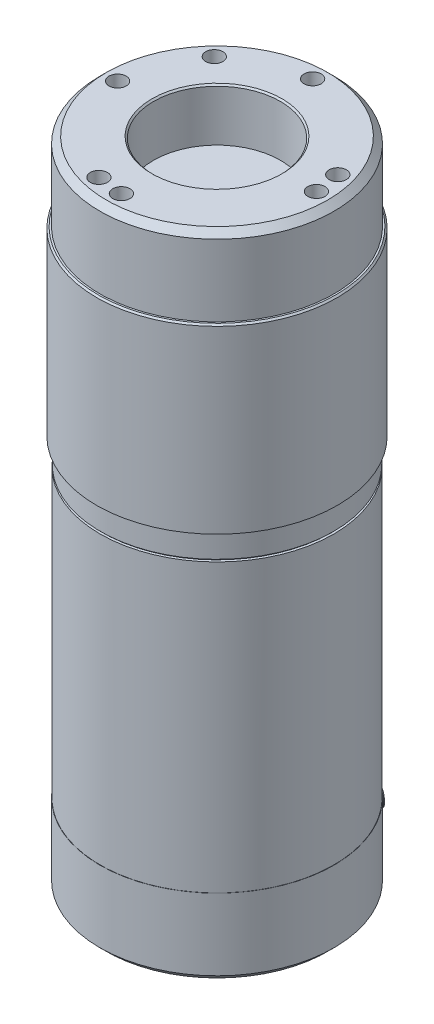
ISO-10303-21;
HEADER;
FILE_DESCRIPTION(('STEP AP214'),'2;1');
FILE_NAME('part.step','',(''),(''),'','','');
FILE_SCHEMA(('AUTOMOTIVE_DESIGN { 1 0 10303 214 1 1 1 1 }'));
ENDSEC;
DATA;
#1=APPLICATION_CONTEXT('core data for automotive mechanical design processes');
#2=APPLICATION_PROTOCOL_DEFINITION('international standard','automotive_design',2000,#1);
#3=PRODUCT_CONTEXT('',#1,'mechanical');
#4=PRODUCT('Part','Part','',(#3));
#5=PRODUCT_RELATED_PRODUCT_CATEGORY('part','',(#4));
#6=PRODUCT_DEFINITION_FORMATION('','',#4);
#7=PRODUCT_DEFINITION_CONTEXT('part definition',#1,'design');
#8=PRODUCT_DEFINITION('design','',#6,#7);
#9=PRODUCT_DEFINITION_SHAPE('','',#8);
#10=(LENGTH_UNIT() NAMED_UNIT(*) SI_UNIT(.MILLI.,.METRE.));
#11=(NAMED_UNIT(*) PLANE_ANGLE_UNIT() SI_UNIT($,.RADIAN.));
#12=(NAMED_UNIT(*) SI_UNIT($,.STERADIAN.) SOLID_ANGLE_UNIT());
#13=UNCERTAINTY_MEASURE_WITH_UNIT(LENGTH_MEASURE(1.E-05),#10,'distance_accuracy_value','');
#14=(GEOMETRIC_REPRESENTATION_CONTEXT(3) GLOBAL_UNCERTAINTY_ASSIGNED_CONTEXT((#13)) GLOBAL_UNIT_ASSIGNED_CONTEXT((#10,
#11,#12)) REPRESENTATION_CONTEXT('',''));
#15=CARTESIAN_POINT('',(0.,0.,0.));
#16=DIRECTION('',(0.,0.,1.));
#17=DIRECTION('',(1.,0.,0.));
#18=AXIS2_PLACEMENT_3D('',#15,#16,#17);
#19=CARTESIAN_POINT('',(0.,-19.05,0.));
#20=DIRECTION('',(0.,-1.,0.));
#21=DIRECTION('',(0.836713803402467,0.,0.54764040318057));
#22=AXIS2_PLACEMENT_3D('',#19,#20,#21);
#23=PLANE('',#22);
#24=CARTESIAN_POINT('',(23.3097287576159,-19.05,-4.86741219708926));
#25=DIRECTION('',(0.,-1.,0.));
#26=DIRECTION('',(0.836713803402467,0.,0.54764040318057));
#27=AXIS2_PLACEMENT_3D('',#24,#25,#26);
#28=CIRCLE('',#27,2.09999999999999);
#29=CARTESIAN_POINT('',(25.0668277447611,-19.05,-3.71736735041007));
#30=VERTEX_POINT('',#29);
#31=EDGE_CURVE('P0_E490',#30,#30,#28,.T.);
#32=ORIENTED_EDGE('',*,*,#31,.F.);
#33=EDGE_LOOP('',(#32));
#34=FACE_BOUND('',#33,.T.);
#35=CARTESIAN_POINT('',(-4.86741219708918,-19.05,-23.3097287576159));
#36=DIRECTION('',(0.,-1.,0.));
#37=DIRECTION('',(0.836713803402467,0.,0.54764040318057));
#38=AXIS2_PLACEMENT_3D('',#35,#36,#37);
#39=CIRCLE('',#38,2.09999999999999);
#40=CARTESIAN_POINT('',(-3.11031320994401,-19.05,-22.1596839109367));
#41=VERTEX_POINT('',#40);
#42=EDGE_CURVE('P0_E470',#41,#41,#39,.T.);
#43=ORIENTED_EDGE('',*,*,#42,.F.);
#44=EDGE_LOOP('',(#43));
#45=FACE_BOUND('',#44,.T.);
#46=CARTESIAN_POINT('',(-23.3097287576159,-19.05,4.86741219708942));
#47=DIRECTION('',(0.,-1.,0.));
#48=DIRECTION('',(0.836713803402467,0.,0.54764040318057));
#49=AXIS2_PLACEMENT_3D('',#46,#47,#48);
#50=CIRCLE('',#49,2.09999999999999);
#51=CARTESIAN_POINT('',(-21.5526297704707,-19.05,6.01745704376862));
#52=VERTEX_POINT('',#51);
#53=EDGE_CURVE('P0_E458',#52,#52,#50,.T.);
#54=ORIENTED_EDGE('',*,*,#53,.F.);
#55=EDGE_LOOP('',(#54));
#56=FACE_BOUND('',#55,.T.);
#57=CARTESIAN_POINT('',(0.,-19.05,0.));
#58=DIRECTION('',(0.,-1.,0.));
#59=DIRECTION('',(0.836713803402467,0.,0.54764040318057));
#60=AXIS2_PLACEMENT_3D('',#57,#58,#59);
#61=CIRCLE('',#60,27.0002);
#62=CARTESIAN_POINT('',(22.5914400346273,-19.05,14.7864004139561));
#63=VERTEX_POINT('',#62);
#64=EDGE_CURVE('P0_E533',#63,#63,#61,.T.);
#65=ORIENTED_EDGE('',*,*,#64,.T.);
#66=EDGE_LOOP('',(#65));
#67=FACE_BOUND('',#66,.T.);
#68=CARTESIAN_POINT('',(-13.0406871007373,-19.05,19.9242474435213));
#69=DIRECTION('',(0.,-1.,0.));
#70=DIRECTION('',(0.836713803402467,0.,0.54764040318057));
#71=AXIS2_PLACEMENT_3D('',#68,#69,#70);
#72=CIRCLE('',#71,2.09999999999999);
#73=CARTESIAN_POINT('',(-11.2835881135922,-19.05,21.0742922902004));
#74=VERTEX_POINT('',#73);
#75=EDGE_CURVE('P0_E525',#74,#74,#72,.T.);
#76=ORIENTED_EDGE('',*,*,#75,.F.);
#77=EDGE_LOOP('',(#76));
#78=FACE_BOUND('',#77,.T.);
#79=CARTESIAN_POINT('',(23.7752479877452,-19.05,1.33144259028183));
#80=DIRECTION('',(0.,-1.,0.));
#81=DIRECTION('',(0.836713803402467,0.,0.54764040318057));
#82=AXIS2_PLACEMENT_3D('',#79,#80,#81);
#83=CIRCLE('',#82,2.09999999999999);
#84=CARTESIAN_POINT('',(25.5323469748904,-19.05,2.48148743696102));
#85=VERTEX_POINT('',#84);
#86=EDGE_CURVE('P0_E502',#85,#85,#83,.T.);
#87=ORIENTED_EDGE('',*,*,#86,.F.);
#88=EDGE_LOOP('',(#87));
#89=FACE_BOUND('',#88,.T.);
#90=CARTESIAN_POINT('',(-10.7345608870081,-19.05,-21.2556900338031));
#91=DIRECTION('',(0.,-1.,0.));
#92=DIRECTION('',(0.836713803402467,0.,0.54764040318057));
#93=AXIS2_PLACEMENT_3D('',#90,#91,#92);
#94=CIRCLE('',#93,2.09999999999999);
#95=CARTESIAN_POINT('',(-8.97746189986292,-19.05,-20.1056451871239));
#96=VERTEX_POINT('',#95);
#97=EDGE_CURVE('P0_E503',#96,#96,#94,.T.);
#98=ORIENTED_EDGE('',*,*,#97,.F.);
#99=EDGE_LOOP('',(#98));
#100=FACE_BOUND('',#99,.T.);
#101=CARTESIAN_POINT('',(4.86741219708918,-19.05,23.3097287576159));
#102=DIRECTION('',(0.,-1.,0.));
#103=DIRECTION('',(0.836713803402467,0.,0.54764040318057));
#104=AXIS2_PLACEMENT_3D('',#101,#102,#103);
#105=CIRCLE('',#104,2.09999999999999);
#106=CARTESIAN_POINT('',(6.62451118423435,-19.05,24.4597736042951));
#107=VERTEX_POINT('',#106);
#108=EDGE_CURVE('P0_E512',#107,#107,#105,.T.);
#109=ORIENTED_EDGE('',*,*,#108,.F.);
#110=EDGE_LOOP('',(#109));
#111=FACE_BOUND('',#110,.T.);
#112=CARTESIAN_POINT('',(0.,-19.05,0.));
#113=DIRECTION('',(0.,-1.,0.));
#114=DIRECTION('',(0.836713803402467,0.,0.54764040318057));
#115=AXIS2_PLACEMENT_3D('',#112,#113,#114);
#116=CIRCLE('',#115,15.8750000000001);
#117=CARTESIAN_POINT('',(13.2828316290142,-19.05,8.69379140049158));
#118=VERTEX_POINT('',#117);
#119=EDGE_CURVE('P0_E475',#118,#118,#116,.F.);
#120=ORIENTED_EDGE('',*,*,#119,.T.);
#121=EDGE_LOOP('',(#120));
#122=FACE_BOUND('',#121,.T.);
#123=ADVANCED_FACE('P0_F17',(#34,#45,#56,#67,#78,#89,#100,#111,#122),#23,.T.);
#124=CARTESIAN_POINT('',(0.,-19.05,0.));
#125=DIRECTION('',(0.,1.,0.));
#126=DIRECTION('',(-0.836713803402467,0.,-0.54764040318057));
#127=AXIS2_PLACEMENT_3D('',#124,#125,#126);
#128=CYLINDRICAL_SURFACE('',#127,28.575);
#129=CARTESIAN_POINT('',(0.,0.,0.));
#130=DIRECTION('',(0.,-1.,0.));
#131=DIRECTION('',(0.836713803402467,0.,0.54764040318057));
#132=AXIS2_PLACEMENT_3D('',#129,#130,#131);
#133=CIRCLE('',#132,28.575);
#134=CARTESIAN_POINT('',(23.9090969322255,0.,15.6488245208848));
#135=VERTEX_POINT('',#134);
#136=EDGE_CURVE('P0_E529',#135,#135,#133,.T.);
#137=ORIENTED_EDGE('',*,*,#136,.T.);
#138=EDGE_LOOP('',(#137));
#139=FACE_BOUND('',#138,.T.);
#140=CARTESIAN_POINT('',(0.,-17.4752,0.));
#141=DIRECTION('',(0.,-1.,0.));
#142=DIRECTION('',(0.836713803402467,0.,0.54764040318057));
#143=AXIS2_PLACEMENT_3D('',#140,#141,#142);
#144=CIRCLE('',#143,28.575);
#145=CARTESIAN_POINT('',(23.9090969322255,-17.4752,15.6488245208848));
#146=VERTEX_POINT('',#145);
#147=EDGE_CURVE('P0_E537',#146,#146,#144,.F.);
#148=ORIENTED_EDGE('',*,*,#147,.T.);
#149=EDGE_LOOP('',(#148));
#150=FACE_BOUND('',#149,.T.);
#151=CARTESIAN_POINT('',(17.2077873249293,-3.02603500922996,-22.812774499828));
#152=CARTESIAN_POINT('',(17.116060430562,-2.94547954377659,-22.88199974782));
#153=CARTESIAN_POINT('',(17.0184481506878,-2.87467188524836,-22.9547285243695));
#154=CARTESIAN_POINT('',(16.8137894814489,-2.75402330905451,-23.1050391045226));
#155=CARTESIAN_POINT('',(16.7067129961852,-2.70425241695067,-23.1826361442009));
#156=CARTESIAN_POINT('',(16.4860478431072,-2.6276835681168,-23.340080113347));
#157=CARTESIAN_POINT('',(16.3724558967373,-2.60089728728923,-23.4199281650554));
#158=CARTESIAN_POINT('',(16.1420187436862,-2.57245667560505,-23.5793424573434));
#159=CARTESIAN_POINT('',(16.0251771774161,-2.57077527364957,-23.6589089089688));
#160=CARTESIAN_POINT('',(15.7989164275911,-2.59377739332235,-23.8105510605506));
#161=CARTESIAN_POINT('',(15.6894596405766,-2.61693809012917,-23.8827936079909));
#162=CARTESIAN_POINT('',(15.4754496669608,-2.68838450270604,-24.0220175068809));
#163=CARTESIAN_POINT('',(15.3708919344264,-2.73664640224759,-24.0890037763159));
#164=CARTESIAN_POINT('',(15.1852505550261,-2.84988911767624,-24.2063882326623));
#165=CARTESIAN_POINT('',(15.1029022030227,-2.91174128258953,-24.2578053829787));
#166=CARTESIAN_POINT('',(14.9493442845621,-3.05288694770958,-24.3527385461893));
#167=CARTESIAN_POINT('',(14.878124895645,-3.13216491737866,-24.3962615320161));
#168=CARTESIAN_POINT('',(14.7578426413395,-3.29546364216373,-24.4691863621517));
#169=CARTESIAN_POINT('',(14.707157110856,-3.3778215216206,-24.4996483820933));
#170=CARTESIAN_POINT('',(14.6191666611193,-3.55181364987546,-24.5522550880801));
#171=CARTESIAN_POINT('',(14.5818558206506,-3.64344377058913,-24.5744034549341));
#172=CARTESIAN_POINT('',(14.5239402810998,-3.82716503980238,-24.6086742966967));
#173=CARTESIAN_POINT('',(14.5024455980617,-3.91887769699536,-24.6213318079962));
#174=CARTESIAN_POINT('',(14.4731901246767,-4.10519788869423,-24.6385406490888));
#175=CARTESIAN_POINT('',(14.4654275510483,-4.19980504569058,-24.643093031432));
#176=CARTESIAN_POINT('',(14.4637351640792,-4.38816277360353,-24.6440862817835));
#177=CARTESIAN_POINT('',(14.4696595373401,-4.48191178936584,-24.6406126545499));
#178=CARTESIAN_POINT('',(14.4945885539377,-4.66702360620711,-24.6259564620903));
#179=CARTESIAN_POINT('',(14.5135942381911,-4.75838621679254,-24.6147732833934));
#180=CARTESIAN_POINT('',(14.5645367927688,-4.93909712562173,-24.5846656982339));
#181=CARTESIAN_POINT('',(14.5968419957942,-5.02830435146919,-24.5655206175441));
#182=CARTESIAN_POINT('',(14.6730061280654,-5.19967526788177,-24.520103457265));
#183=CARTESIAN_POINT('',(14.7168676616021,-5.28183736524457,-24.4938297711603));
#184=CARTESIAN_POINT('',(14.8176505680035,-5.44241773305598,-24.4330007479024));
#185=CARTESIAN_POINT('',(14.8752248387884,-5.52026610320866,-24.3980251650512));
#186=CARTESIAN_POINT('',(14.9995687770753,-5.66469880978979,-24.3217778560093));
#187=CARTESIAN_POINT('',(15.0663417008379,-5.73127913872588,-24.2805038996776));
#188=CARTESIAN_POINT('',(15.2133691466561,-5.85768242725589,-24.1886787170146));
#189=CARTESIAN_POINT('',(15.2942961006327,-5.91635857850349,-24.1376269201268));
#190=CARTESIAN_POINT('',(15.4621234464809,-6.01854069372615,-24.0304658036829));
#191=CARTESIAN_POINT('',(15.5490257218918,-6.06204184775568,-23.9743548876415));
#192=CARTESIAN_POINT('',(15.7355375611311,-6.13723115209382,-23.8524023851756));
#193=CARTESIAN_POINT('',(15.8355423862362,-6.16727531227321,-23.7861509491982));
#194=CARTESIAN_POINT('',(16.0373838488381,-6.2086006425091,-23.6505339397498));
#195=CARTESIAN_POINT('',(16.139222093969,-6.21986444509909,-23.5811655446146));
#196=CARTESIAN_POINT('',(16.3507878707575,-6.22384887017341,-23.4350216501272));
#197=CARTESIAN_POINT('',(16.4604570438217,-6.21492688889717,-23.3581145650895));
#198=CARTESIAN_POINT('',(16.6759394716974,-6.17516024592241,-23.2047647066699));
#199=CARTESIAN_POINT('',(16.7817582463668,-6.14434838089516,-23.1283214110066));
#200=CARTESIAN_POINT('',(16.9405396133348,-6.07957475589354,-23.0120330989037));
#201=CARTESIAN_POINT('',(16.9959252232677,-6.05322162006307,-22.9711484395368));
#202=CARTESIAN_POINT('',(17.1040008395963,-5.99383572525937,-22.8907915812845));
#203=CARTESIAN_POINT('',(17.1566926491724,-5.96080750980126,-22.8513184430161));
#204=CARTESIAN_POINT('',(17.207787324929,-5.92441092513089,-22.8127744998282));
#205=B_SPLINE_CURVE_WITH_KNOTS('',3,(#151,#152,#153,#154,#155,#156,#157,#158,#159,#160,#161,
#162,#163,#164,#165,#166,#167,#168,#169,#170,#171,#172,#173,#174,#175,#176,#177,#178,#179,#180,
#181,#182,#183,#184,#185,#186,#187,#188,#189,#190,#191,#192,#193,#194,#195,#196,#197,#198,#199,
#200,#201,#202,#203,#204),.UNSPECIFIED.,.F.,.F.,(4,2,2,2,2,2,2,2,2,2,2,2,2,2,2,2,2,2,2,2,2,2,2,
2,2,2,4),(0.,0.420504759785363,0.842398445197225,1.2645063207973,1.68615899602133,
2.08336684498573,2.48019850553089,2.82356432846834,3.16662536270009,3.4692145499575,
3.77166960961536,4.05543185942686,4.33915725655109,4.61987395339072,4.90061299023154,
5.18971474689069,5.4788817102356,5.78642849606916,6.09408443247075,6.42941864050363,
6.76485904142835,7.1342947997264,7.5040720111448,7.90501000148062,8.30534854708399,
8.52616099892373,8.74682365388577),.UNSPECIFIED.);
#206=CARTESIAN_POINT('',(15.0387806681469,-5.70130533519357,-24.2974422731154));
#207=VERTEX_POINT('',#206);
#208=CARTESIAN_POINT('',(15.7446682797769,-6.13690835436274,-23.846090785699));
#209=VERTEX_POINT('',#208);
#210=EDGE_CURVE('P0_E220',#207,#209,#205,.T.);
#211=ORIENTED_EDGE('',*,*,#210,.T.);
#212=CARTESIAN_POINT('',(14.1035496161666,-3.28790912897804,-24.8519720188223));
#213=CARTESIAN_POINT('',(14.0619193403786,-3.38933260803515,-24.8755978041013));
#214=CARTESIAN_POINT('',(14.0276399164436,-3.49486217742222,-24.8949161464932));
#215=CARTESIAN_POINT('',(13.974940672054,-3.71111218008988,-24.9245376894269));
#216=CARTESIAN_POINT('',(13.956538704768,-3.82183830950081,-24.9348307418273));
#217=CARTESIAN_POINT('',(13.9362382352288,-4.04522507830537,-24.9461826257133));
#218=CARTESIAN_POINT('',(13.9343331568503,-4.15788492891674,-24.9472451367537));
#219=CARTESIAN_POINT('',(13.9470761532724,-4.38194026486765,-24.9401231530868));
#220=CARTESIAN_POINT('',(13.9617203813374,-4.49333603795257,-24.9319408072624));
#221=CARTESIAN_POINT('',(14.0070660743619,-4.71167325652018,-24.906492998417));
#222=CARTESIAN_POINT('',(14.0377591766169,-4.81861699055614,-24.8892322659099));
#223=CARTESIAN_POINT('',(14.1142128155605,-5.02509453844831,-24.8459562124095));
#224=CARTESIAN_POINT('',(14.1599740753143,-5.12462799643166,-24.8199404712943));
#225=CARTESIAN_POINT('',(14.2652027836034,-5.31363974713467,-24.7596099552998));
#226=CARTESIAN_POINT('',(14.3246932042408,-5.40310080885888,-24.7252812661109));
#227=CARTESIAN_POINT('',(14.4554783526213,-5.56925529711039,-24.6490463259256));
#228=CARTESIAN_POINT('',(14.526773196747,-5.64594859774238,-24.6071400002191));
#229=CARTESIAN_POINT('',(14.6791077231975,-5.78452435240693,-24.5165713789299));
#230=CARTESIAN_POINT('',(14.7601639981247,-5.84638103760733,-24.4678975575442));
#231=CARTESIAN_POINT('',(14.9294612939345,-5.95335180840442,-24.3649668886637));
#232=CARTESIAN_POINT('',(15.017702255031,-5.99846603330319,-24.3107100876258));
#233=CARTESIAN_POINT('',(15.1986451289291,-6.07062542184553,-24.1979989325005));
#234=CARTESIAN_POINT('',(15.2913427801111,-6.09768749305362,-24.1395485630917));
#235=CARTESIAN_POINT('',(15.4785516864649,-6.13302979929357,-24.0199374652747));
#236=CARTESIAN_POINT('',(15.5730629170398,-6.14131028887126,-23.9587767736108));
#237=CARTESIAN_POINT('',(15.760975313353,-6.13885316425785,-23.8355800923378));
#238=CARTESIAN_POINT('',(15.8543784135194,-6.12815598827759,-23.7735462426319));
#239=CARTESIAN_POINT('',(16.0376612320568,-6.08813047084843,-23.6502906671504));
#240=CARTESIAN_POINT('',(16.1275409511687,-6.05880213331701,-23.5890689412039));
#241=CARTESIAN_POINT('',(16.3013238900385,-5.98235566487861,-23.4693120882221));
#242=CARTESIAN_POINT('',(16.3852271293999,-5.93523759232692,-23.4107769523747));
#243=CARTESIAN_POINT('',(16.5448329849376,-5.82455238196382,-23.2982547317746));
#244=CARTESIAN_POINT('',(16.6205354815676,-5.76098500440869,-23.2442677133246));
#245=CARTESIAN_POINT('',(16.7619333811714,-5.61904542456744,-23.1425113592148));
#246=CARTESIAN_POINT('',(16.8276071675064,-5.54064203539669,-23.0947554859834));
#247=CARTESIAN_POINT('',(16.9470853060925,-5.37133190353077,-23.0072254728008));
#248=CARTESIAN_POINT('',(17.0008895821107,-5.28042508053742,-22.9674513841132));
#249=CARTESIAN_POINT('',(17.095325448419,-5.08858014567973,-22.8972476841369));
#250=CARTESIAN_POINT('',(17.135944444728,-4.98763256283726,-22.8668270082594));
#251=CARTESIAN_POINT('',(17.2029261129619,-4.77864015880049,-22.8164792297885));
#252=CARTESIAN_POINT('',(17.2292889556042,-4.67059542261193,-22.7965520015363));
#253=CARTESIAN_POINT('',(17.2670706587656,-4.45067249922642,-22.7679481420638));
#254=CARTESIAN_POINT('',(17.2785150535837,-4.33880119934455,-22.7592522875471));
#255=CARTESIAN_POINT('',(17.2862595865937,-4.1142355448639,-22.7533707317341));
#256=CARTESIAN_POINT('',(17.2825599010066,-4.00154119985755,-22.756184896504));
#257=CARTESIAN_POINT('',(17.2601277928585,-3.7787309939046,-22.7732037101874));
#258=CARTESIAN_POINT('',(17.2414210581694,-3.66861105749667,-22.7873888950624));
#259=CARTESIAN_POINT('',(17.1894694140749,-3.45386897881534,-22.8266032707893));
#260=CARTESIAN_POINT('',(17.1562244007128,-3.34924687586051,-22.8516325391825));
#261=CARTESIAN_POINT('',(17.0759790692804,-3.14835476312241,-22.9116578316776));
#262=CARTESIAN_POINT('',(17.0289654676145,-3.05209293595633,-22.946663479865));
#263=CARTESIAN_POINT('',(16.9223641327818,-2.8707437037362,-23.0253901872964));
#264=CARTESIAN_POINT('',(16.8627762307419,-2.78565644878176,-23.0691113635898));
#265=CARTESIAN_POINT('',(16.7323839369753,-2.62888215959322,-23.1638607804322));
#266=CARTESIAN_POINT('',(16.6615559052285,-2.55722407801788,-23.2149043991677));
#267=CARTESIAN_POINT('',(16.510593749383,-2.42956299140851,-23.3225105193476));
#268=CARTESIAN_POINT('',(16.430459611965,-2.37356000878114,-23.3790730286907));
#269=CARTESIAN_POINT('',(16.2629948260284,-2.27880653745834,-23.4958726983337));
#270=CARTESIAN_POINT('',(16.1756643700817,-2.24005558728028,-23.5561097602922));
#271=CARTESIAN_POINT('',(15.9961672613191,-2.18091802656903,-23.6783665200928));
#272=CARTESIAN_POINT('',(15.9040006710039,-2.16053117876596,-23.7403861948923));
#273=CARTESIAN_POINT('',(15.7175919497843,-2.13873361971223,-23.8642079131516));
#274=CARTESIAN_POINT('',(15.6233546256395,-2.13728282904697,-23.9260101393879));
#275=CARTESIAN_POINT('',(15.4352961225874,-2.15329561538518,-24.0477609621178));
#276=CARTESIAN_POINT('',(15.3414749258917,-2.170758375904,-24.107709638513));
#277=CARTESIAN_POINT('',(15.1570611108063,-2.22406559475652,-24.2240790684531));
#278=CARTESIAN_POINT('',(15.066465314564,-2.25989139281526,-24.2805033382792));
#279=CARTESIAN_POINT('',(14.8910475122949,-2.34890426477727,-24.3884798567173));
#280=CARTESIAN_POINT('',(14.806226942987,-2.40209563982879,-24.4400308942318));
#281=CARTESIAN_POINT('',(14.6447524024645,-2.52445054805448,-24.5371302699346));
#282=CARTESIAN_POINT('',(14.5681166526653,-2.59364867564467,-24.5826652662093));
#283=CARTESIAN_POINT('',(14.4256212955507,-2.74595213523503,-24.6665546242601));
#284=CARTESIAN_POINT('',(14.3597495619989,-2.8290416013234,-24.7049170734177));
#285=CARTESIAN_POINT('',(14.2618792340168,-2.97520340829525,-24.7614902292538));
#286=CARTESIAN_POINT('',(14.2261492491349,-3.03493443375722,-24.7820245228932));
#287=CARTESIAN_POINT('',(14.1604389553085,-3.15850815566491,-24.8196297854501));
#288=CARTESIAN_POINT('',(14.1304586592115,-3.22235086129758,-24.8367007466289));
#289=CARTESIAN_POINT('',(14.1035496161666,-3.28790912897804,-24.8519720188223));
#290=B_SPLINE_CURVE_WITH_KNOTS('',3,(#212,#213,#214,#215,#216,#217,#218,#219,#220,#221,#222,
#223,#224,#225,#226,#227,#228,#229,#230,#231,#232,#233,#234,#235,#236,#237,#238,#239,#240,#241,
#242,#243,#244,#245,#246,#247,#248,#249,#250,#251,#252,#253,#254,#255,#256,#257,#258,#259,#260,
#261,#262,#263,#264,#265,#266,#267,#268,#269,#270,#271,#272,#273,#274,#275,#276,#277,#278,#279,
#280,#281,#282,#283,#284,#285,#286,#287,#288,#289),.UNSPECIFIED.,.T.,.F.,(4,2,2,2,2,2,2,2,2,2,2,
2,2,2,2,2,2,2,2,2,2,2,2,2,2,2,2,2,2,2,2,2,2,2,2,2,2,2,4),(0.,0.336191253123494,
0.672760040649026,1.00919465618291,1.34555108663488,1.68173242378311,2.01792989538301,
2.35469403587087,2.69146149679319,3.02880970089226,3.36615509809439,3.70318409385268,
4.04020852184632,4.37651566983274,4.71282274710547,5.04912872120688,5.38543959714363,
5.72246545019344,6.05949346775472,6.39684245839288,6.73418740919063,7.07095420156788,
7.40771707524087,7.74390473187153,8.08009479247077,8.4166102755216,8.75313027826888,
9.09036765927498,9.42760552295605,9.76483436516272,10.102058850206,10.4385694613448,
10.7750655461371,11.1112203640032,11.4474585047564,11.7844302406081,12.1210197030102,
12.3383270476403,12.555634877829),.UNSPECIFIED.);
#291=CARTESIAN_POINT('',(16.6133196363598,-5.76344967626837,-23.249263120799));
#292=VERTEX_POINT('',#291);
#293=EDGE_CURVE('P0_E227',#209,#292,#290,.T.);
#294=ORIENTED_EDGE('',*,*,#293,.T.);
#295=CARTESIAN_POINT('',(16.078185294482,-6.23855223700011,-23.6225016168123));
#296=CARTESIAN_POINT('',(16.1322187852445,-6.20498031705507,-23.5857258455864));
#297=CARTESIAN_POINT('',(16.1849244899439,-6.16866116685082,-23.5495802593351));
#298=CARTESIAN_POINT('',(16.2874004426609,-6.09078037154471,-23.4788219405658));
#299=CARTESIAN_POINT('',(16.3371709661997,-6.04921921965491,-23.4442090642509));
#300=CARTESIAN_POINT('',(16.4815020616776,-5.9171984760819,-23.3431889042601));
#301=CARTESIAN_POINT('',(16.5712780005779,-5.81927931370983,-23.279466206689));
#302=CARTESIAN_POINT('',(16.7357927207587,-5.60631395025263,-23.1614805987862));
#303=CARTESIAN_POINT('',(16.8105031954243,-5.49123620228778,-23.1072355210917));
#304=CARTESIAN_POINT('',(16.9429990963,-5.24732499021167,-23.0102620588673));
#305=CARTESIAN_POINT('',(17.0007875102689,-5.11849395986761,-22.9675316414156));
#306=CARTESIAN_POINT('',(17.0986141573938,-4.84965759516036,-22.8947982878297));
#307=CARTESIAN_POINT('',(17.1385073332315,-4.70957142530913,-22.8648994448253));
#308=CARTESIAN_POINT('',(17.1992481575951,-4.42311321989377,-22.819244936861));
#309=CARTESIAN_POINT('',(17.2200929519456,-4.2767402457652,-22.8034913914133));
#310=CARTESIAN_POINT('',(17.2429760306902,-3.97865491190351,-22.7861935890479));
#311=CARTESIAN_POINT('',(17.2446141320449,-3.82689481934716,-22.7849516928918));
#312=CARTESIAN_POINT('',(17.2286425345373,-3.52495435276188,-22.7970302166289));
#313=CARTESIAN_POINT('',(17.2110238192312,-3.37477475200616,-22.8103574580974));
#314=CARTESIAN_POINT('',(17.1560514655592,-3.07148342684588,-22.8517344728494));
#315=CARTESIAN_POINT('',(17.1176636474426,-2.9186663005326,-22.880555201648));
#316=CARTESIAN_POINT('',(17.0219447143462,-2.62254277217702,-22.9518529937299));
#317=CARTESIAN_POINT('',(16.9646292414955,-2.47922863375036,-22.9943187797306));
#318=CARTESIAN_POINT('',(16.8723729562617,-2.28792176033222,-23.0619753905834));
#319=CARTESIAN_POINT('',(16.8447338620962,-2.23448300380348,-23.0821760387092));
#320=CARTESIAN_POINT('',(16.7868344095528,-2.12990839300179,-23.124318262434));
#321=CARTESIAN_POINT('',(16.7565792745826,-2.07876824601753,-23.1462563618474));
#322=CARTESIAN_POINT('',(16.7250256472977,-2.02879902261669,-23.1690341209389));
#323=B_SPLINE_CURVE_WITH_KNOTS('',3,(#295,#296,#297,#298,#299,#300,#301,#302,#303,#304,#305,
#306,#307,#308,#309,#310,#311,#312,#313,#314,#315,#316,#317,#318,#319,#320,#321,#322),
.UNSPECIFIED.,.F.,.F.,(4,2,2,2,2,2,2,2,2,2,2,2,2,4),(0.,0.22029888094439,0.440577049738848,
0.880342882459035,1.32092744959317,1.76143418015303,2.20544980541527,2.64953195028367,
3.10285076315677,3.55638192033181,4.03490968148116,4.51304296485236,4.70334096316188,
4.89326740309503),.UNSPECIFIED.);
#324=CARTESIAN_POINT('',(17.235170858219,-3.65015298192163,-22.7920931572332));
#325=VERTEX_POINT('',#324);
#326=EDGE_CURVE('P0_E32',#292,#325,#323,.T.);
#327=ORIENTED_EDGE('',*,*,#326,.T.);
#328=CARTESIAN_POINT('',(16.8549158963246,-2.77984510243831,-23.0747141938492));
#329=VERTEX_POINT('',#328);
#330=EDGE_CURVE('P0_E39',#325,#329,#290,.T.);
#331=ORIENTED_EDGE('',*,*,#330,.T.);
#332=CARTESIAN_POINT('',(16.2634287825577,-2.5874538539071,-23.4953508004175));
#333=VERTEX_POINT('',#332);
#334=EDGE_CURVE('P0_E205',#329,#333,#205,.T.);
#335=ORIENTED_EDGE('',*,*,#334,.T.);
#336=CARTESIAN_POINT('',(16.2634287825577,-2.5874538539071,-23.4953508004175));
#337=CARTESIAN_POINT('',(16.2259762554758,-2.56621814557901,-23.5212758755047));
#338=CARTESIAN_POINT('',(16.1877464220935,-2.54691034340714,-23.5476052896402));
#339=CARTESIAN_POINT('',(16.1099401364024,-2.51227108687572,-23.6009041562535));
#340=CARTESIAN_POINT('',(16.0703633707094,-2.4969405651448,-23.6278737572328));
#341=CARTESIAN_POINT('',(15.9519529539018,-2.45777140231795,-23.7081150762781));
#342=CARTESIAN_POINT('',(15.8715483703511,-2.43968875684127,-23.7620302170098));
#343=CARTESIAN_POINT('',(15.7315090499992,-2.42263168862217,-23.8548784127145));
#344=CARTESIAN_POINT('',(15.6723089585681,-2.41974469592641,-23.8938130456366));
#345=CARTESIAN_POINT('',(15.5527182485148,-2.42258551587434,-23.9718341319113));
#346=CARTESIAN_POINT('',(15.4923250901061,-2.42846657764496,-24.0109110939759));
#347=CARTESIAN_POINT('',(15.4322826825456,-2.43882638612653,-24.0494340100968));
#348=B_SPLINE_CURVE_WITH_KNOTS('',3,(#336,#337,#338,#339,#340,#341,#342,#343,#344,#345,#346,
#347),.UNSPECIFIED.,.F.,.F.,(4,2,2,2,2,4),(0.,0.150671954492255,0.301379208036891,
0.595279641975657,0.807541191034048,1.02355642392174),.UNSPECIFIED.);
#349=CARTESIAN_POINT('',(15.4322826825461,-2.43882638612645,-24.0494340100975));
#350=VERTEX_POINT('',#349);
#351=EDGE_CURVE('P0_E144',#333,#350,#348,.T.);
#352=ORIENTED_EDGE('',*,*,#351,.T.);
#353=CARTESIAN_POINT('',(14.6258536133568,-5.1679029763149,-24.5482184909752));
#354=CARTESIAN_POINT('',(14.6757900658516,-5.21012537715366,-24.5184661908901));
#355=CARTESIAN_POINT('',(14.72818758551,-5.24826256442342,-24.4870403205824));
#356=CARTESIAN_POINT('',(14.8368690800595,-5.3155440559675,-24.4213426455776));
#357=CARTESIAN_POINT('',(14.8931549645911,-5.34468390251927,-24.3870694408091));
#358=CARTESIAN_POINT('',(15.0193951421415,-5.39788831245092,-24.3095629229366));
#359=CARTESIAN_POINT('',(15.0899193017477,-5.41994667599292,-24.2658619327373));
#360=CARTESIAN_POINT('',(15.2327481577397,-5.44959143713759,-24.1764577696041));
#361=CARTESIAN_POINT('',(15.3050535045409,-5.45717246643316,-24.1307538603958));
#362=CARTESIAN_POINT('',(15.448091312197,-5.45753236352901,-24.0394297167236));
#363=CARTESIAN_POINT('',(15.5188301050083,-5.45055224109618,-23.9938204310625));
#364=CARTESIAN_POINT('',(15.6578834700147,-5.4223782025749,-23.9033092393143));
#365=CARTESIAN_POINT('',(15.7261983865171,-5.40118631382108,-23.8584072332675));
#366=CARTESIAN_POINT('',(15.8575140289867,-5.34548427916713,-23.7713272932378));
#367=CARTESIAN_POINT('',(15.9205749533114,-5.31116144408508,-23.7291203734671));
#368=CARTESIAN_POINT('',(16.0406026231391,-5.23005297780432,-23.6481487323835));
#369=CARTESIAN_POINT('',(16.0975699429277,-5.18326852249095,-23.6093836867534));
#370=CARTESIAN_POINT('',(16.2028086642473,-5.07941981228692,-23.5372815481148));
#371=CARTESIAN_POINT('',(16.2512149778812,-5.02255010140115,-23.5038612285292));
#372=CARTESIAN_POINT('',(16.3391395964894,-4.89958023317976,-23.4428243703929));
#373=CARTESIAN_POINT('',(16.3786593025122,-4.8334815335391,-23.4152069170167));
#374=CARTESIAN_POINT('',(16.4470648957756,-4.69527360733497,-23.3672078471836));
#375=CARTESIAN_POINT('',(16.4761335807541,-4.62329782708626,-23.3467020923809));
#376=CARTESIAN_POINT('',(16.5239303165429,-4.47440061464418,-23.3128980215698));
#377=CARTESIAN_POINT('',(16.5426588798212,-4.39747942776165,-23.299599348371));
#378=CARTESIAN_POINT('',(16.5694527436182,-4.24089185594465,-23.2805526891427));
#379=CARTESIAN_POINT('',(16.5775159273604,-4.16122492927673,-23.2748062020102));
#380=CARTESIAN_POINT('',(16.5830286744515,-4.00134952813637,-23.2708786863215));
#381=CARTESIAN_POINT('',(16.5804766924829,-3.92114097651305,-23.2726987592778));
#382=CARTESIAN_POINT('',(16.5648495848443,-3.75939145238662,-23.2838243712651));
#383=CARTESIAN_POINT('',(16.5514022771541,-3.67790503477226,-23.2933946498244));
#384=CARTESIAN_POINT('',(16.5141717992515,-3.51855815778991,-23.319804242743));
#385=CARTESIAN_POINT('',(16.4903856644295,-3.44069874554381,-23.3366456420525));
#386=CARTESIAN_POINT('',(16.4315091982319,-3.28572567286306,-23.3781415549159));
#387=CARTESIAN_POINT('',(16.3958120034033,-3.20895436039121,-23.4032139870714));
#388=CARTESIAN_POINT('',(16.3147034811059,-3.06332733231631,-23.4598277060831));
#389=CARTESIAN_POINT('',(16.2692889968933,-2.9944742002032,-23.4913710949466));
#390=CARTESIAN_POINT('',(16.1673268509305,-2.86313791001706,-23.561667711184));
#391=CARTESIAN_POINT('',(16.1103330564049,-2.80115147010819,-23.6007044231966));
#392=CARTESIAN_POINT('',(15.9882050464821,-2.68964599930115,-23.6836095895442));
#393=CARTESIAN_POINT('',(15.9230698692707,-2.6401284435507,-23.7274786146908));
#394=CARTESIAN_POINT('',(15.7864347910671,-2.55550009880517,-23.8186023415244));
#395=CARTESIAN_POINT('',(15.7149528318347,-2.52035017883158,-23.8658474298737));
#396=CARTESIAN_POINT('',(15.5674128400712,-2.46598287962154,-23.962346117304));
#397=CARTESIAN_POINT('',(15.4913567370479,-2.44675883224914,-24.0115988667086));
#398=CARTESIAN_POINT('',(15.3419107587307,-2.42628501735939,-24.1073386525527));
#399=CARTESIAN_POINT('',(15.268652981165,-2.42398322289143,-24.1538053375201));
#400=CARTESIAN_POINT('',(15.122597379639,-2.43525155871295,-24.245516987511));
#401=CARTESIAN_POINT('',(15.0497993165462,-2.4488126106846,-24.2907626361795));
#402=CARTESIAN_POINT('',(14.9127556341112,-2.49007406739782,-24.3751169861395));
#403=CARTESIAN_POINT('',(14.8482827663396,-2.5166073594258,-24.4144300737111));
#404=CARTESIAN_POINT('',(14.7240053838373,-2.58243710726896,-24.4895807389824));
#405=CARTESIAN_POINT('',(14.6641997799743,-2.62173057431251,-24.5254191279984));
#406=CARTESIAN_POINT('',(14.5531409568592,-2.71020349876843,-24.5914771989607));
#407=CARTESIAN_POINT('',(14.5016596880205,-2.75898304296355,-24.6218510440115));
#408=CARTESIAN_POINT('',(14.4061614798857,-2.86570058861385,-24.6778485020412));
#409=CARTESIAN_POINT('',(14.3621449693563,-2.92363911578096,-24.7034718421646));
#410=CARTESIAN_POINT('',(14.2818107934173,-3.04818479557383,-24.7500042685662));
#411=CARTESIAN_POINT('',(14.2456686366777,-3.11494476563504,-24.7708064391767));
#412=CARTESIAN_POINT('',(14.1829886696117,-3.25423968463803,-24.8067483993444));
#413=CARTESIAN_POINT('',(14.1564530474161,-3.32677594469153,-24.8218868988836));
#414=CARTESIAN_POINT('',(14.1122843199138,-3.47965827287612,-24.8470268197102));
#415=CARTESIAN_POINT('',(14.0951992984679,-3.56021452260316,-24.8567124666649));
#416=CARTESIAN_POINT('',(14.0723828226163,-3.72342154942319,-24.8696368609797));
#417=CARTESIAN_POINT('',(14.0666541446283,-3.80607283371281,-24.8728740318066));
#418=CARTESIAN_POINT('',(14.0665160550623,-3.97575456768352,-24.8729522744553));
#419=CARTESIAN_POINT('',(14.0727195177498,-4.06278609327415,-24.8694470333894));
#420=CARTESIAN_POINT('',(14.0973841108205,-4.23453856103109,-24.8554738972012));
#421=CARTESIAN_POINT('',(14.1158488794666,-4.31925880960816,-24.8450039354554));
#422=CARTESIAN_POINT('',(14.165168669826,-4.48640871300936,-24.8169185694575));
#423=CARTESIAN_POINT('',(14.1963540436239,-4.56870910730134,-24.7991125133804));
#424=CARTESIAN_POINT('',(14.2702073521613,-4.72605300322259,-24.7566881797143));
#425=CARTESIAN_POINT('',(14.3128686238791,-4.80110068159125,-24.732073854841));
#426=CARTESIAN_POINT('',(14.3988357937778,-4.92758115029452,-24.6821007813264));
#427=CARTESIAN_POINT('',(14.4402979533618,-4.98073197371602,-24.6578804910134));
#428=CARTESIAN_POINT('',(14.5289822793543,-5.07989995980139,-24.6057298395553));
#429=CARTESIAN_POINT('',(14.5762013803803,-5.12592088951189,-24.5778014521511));
#430=CARTESIAN_POINT('',(14.6258536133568,-5.1679029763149,-24.5482184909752));
#431=B_SPLINE_CURVE_WITH_KNOTS('',3,(#353,#354,#355,#356,#357,#358,#359,#360,#361,#362,#363,
#364,#365,#366,#367,#368,#369,#370,#371,#372,#373,#374,#375,#376,#377,#378,#379,#380,#381,#382,
#383,#384,#385,#386,#387,#388,#389,#390,#391,#392,#393,#394,#395,#396,#397,#398,#399,#400,#401,
#402,#403,#404,#405,#406,#407,#408,#409,#410,#411,#412,#413,#414,#415,#416,#417,#418,#419,#420,
#421,#422,#423,#424,#425,#426,#427,#428,#429,#430),.UNSPECIFIED.,.T.,.F.,(4,2,2,2,2,2,2,2,2,2,2,
2,2,2,2,2,2,2,2,2,2,2,2,2,2,2,2,2,2,2,2,2,2,2,2,2,2,2,4),(0.,0.215352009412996,
0.430810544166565,0.687071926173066,0.943428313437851,1.19557528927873,1.44768630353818,
1.69632755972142,1.94494536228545,2.18920568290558,2.43342746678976,2.67314185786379,
2.91284436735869,3.152594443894,3.39237942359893,3.6407191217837,3.88913007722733,
4.15286637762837,4.41668848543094,4.69382255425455,4.97098939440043,5.24739624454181,
5.52368730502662,5.7826439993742,6.04145256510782,6.28036510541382,6.51922172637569,
6.7496094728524,6.98001044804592,7.21511486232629,7.45027279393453,7.69792844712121,
7.9456446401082,8.20642459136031,8.46728195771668,8.73539513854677,9.00335298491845,
9.2175928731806,9.43171917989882),.UNSPECIFIED.);
#432=CARTESIAN_POINT('',(14.2716611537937,-4.72399789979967,-24.7558137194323));
#433=VERTEX_POINT('',#432);
#434=EDGE_CURVE('P0_E181',#350,#433,#431,.T.);
#435=ORIENTED_EDGE('',*,*,#434,.T.);
#436=CARTESIAN_POINT('',(14.2716611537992,-4.7239978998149,-24.755813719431));
#437=CARTESIAN_POINT('',(14.2862576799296,-4.77000207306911,-24.7473982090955));
#438=CARTESIAN_POINT('',(14.3025292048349,-4.81526904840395,-24.7380011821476));
#439=CARTESIAN_POINT('',(14.3382972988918,-4.90405358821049,-24.7172872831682));
#440=CARTESIAN_POINT('',(14.3577937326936,-4.94757122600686,-24.7059704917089));
#441=CARTESIAN_POINT('',(14.4209191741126,-5.07506131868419,-24.6692132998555));
#442=CARTESIAN_POINT('',(14.469195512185,-5.15600603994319,-24.6409596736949));
#443=CARTESIAN_POINT('',(14.5765339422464,-5.30735856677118,-24.5776150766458));
#444=CARTESIAN_POINT('',(14.6356016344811,-5.3777608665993,-24.5425205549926));
#445=CARTESIAN_POINT('',(14.7626320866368,-5.50600196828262,-24.4663189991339));
#446=CARTESIAN_POINT('',(14.8305767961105,-5.56386564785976,-24.4252241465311));
#447=CARTESIAN_POINT('',(14.9240791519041,-5.6305012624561,-24.3680768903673));
#448=CARTESIAN_POINT('',(14.9466227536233,-5.64564985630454,-24.3542566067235));
#449=CARTESIAN_POINT('',(14.9922799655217,-5.67453461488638,-24.3261768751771));
#450=CARTESIAN_POINT('',(15.0153927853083,-5.68827261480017,-24.3119180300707));
#451=CARTESIAN_POINT('',(15.0387806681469,-5.70130533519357,-24.2974422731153));
#452=B_SPLINE_CURVE_WITH_KNOTS('',3,(#436,#437,#438,#439,#440,#441,#442,#443,#444,#445,#446,
#447,#448,#449,#450,#451),.UNSPECIFIED.,.F.,.F.,(4,2,2,2,2,2,2,4),(0.,0.146884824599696,
0.293763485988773,0.5874100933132,0.88120952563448,1.17442058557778,1.2658157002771,
1.35709036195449),.UNSPECIFIED.);
#453=EDGE_CURVE('P0_E214',#433,#207,#452,.T.);
#454=ORIENTED_EDGE('',*,*,#453,.T.);
#455=EDGE_LOOP('',(#211,#294,#327,#331,#335,#352,#435,#454));
#456=FACE_BOUND('',#455,.T.);
#457=ADVANCED_FACE('P0_F189',(#139,#150,#456),#128,.T.);
#458=CARTESIAN_POINT('',(0.,0.,0.));
#459=DIRECTION('',(0.,-1.,0.));
#460=DIRECTION('',(0.836713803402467,0.,0.54764040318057));
#461=AXIS2_PLACEMENT_3D('',#458,#459,#460);
#462=PLANE('',#461);
#463=CARTESIAN_POINT('',(0.,0.,0.));
#464=DIRECTION('',(0.,-1.,0.));
#465=DIRECTION('',(0.,0.,-1.));
#466=AXIS2_PLACEMENT_3D('',#463,#464,#465);
#467=CIRCLE('',#466,28.5115);
#468=CARTESIAN_POINT('',(0.,0.,-28.5115));
#469=VERTEX_POINT('',#468);
#470=EDGE_CURVE('P0_E165',#469,#469,#467,.T.);
#471=ORIENTED_EDGE('',*,*,#470,.T.);
#472=EDGE_LOOP('',(#471));
#473=FACE_BOUND('',#472,.T.);
#474=ORIENTED_EDGE('',*,*,#136,.F.);
#475=EDGE_LOOP('',(#474));
#476=FACE_BOUND('',#475,.T.);
#477=ADVANCED_FACE('P0_F194',(#473,#476),#462,.F.);
#478=CARTESIAN_POINT('',(0.,-19.05,0.));
#479=DIRECTION('',(0.,1.,0.));
#480=DIRECTION('',(-0.836713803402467,0.,-0.54764040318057));
#481=AXIS2_PLACEMENT_3D('',#478,#479,#480);
#482=CONICAL_SURFACE('',#481,27.0002,0.785398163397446);
#483=ORIENTED_EDGE('',*,*,#147,.F.);
#484=EDGE_LOOP('',(#483));
#485=FACE_BOUND('',#484,.T.);
#486=ORIENTED_EDGE('',*,*,#64,.F.);
#487=EDGE_LOOP('',(#486));
#488=FACE_BOUND('',#487,.T.);
#489=ADVANCED_FACE('P0_F197',(#485,#488),#482,.T.);
#490=CARTESIAN_POINT('',(0.,69.977,0.));
#491=DIRECTION('',(0.,1.,0.));
#492=DIRECTION('',(0.,0.,1.));
#493=AXIS2_PLACEMENT_3D('',#490,#491,#492);
#494=PLANE('',#493);
#495=CARTESIAN_POINT('',(0.,69.977,0.));
#496=DIRECTION('',(0.,1.,0.));
#497=DIRECTION('',(0.,0.,1.));
#498=AXIS2_PLACEMENT_3D('',#495,#496,#497);
#499=CIRCLE('',#498,28.5115);
#500=CARTESIAN_POINT('',(0.,69.977,28.5115));
#501=VERTEX_POINT('',#500);
#502=EDGE_CURVE('P0_E156',#501,#501,#499,.T.);
#503=ORIENTED_EDGE('',*,*,#502,.T.);
#504=EDGE_LOOP('',(#503));
#505=FACE_BOUND('',#504,.T.);
#506=ADVANCED_FACE('P0_F550',(#505),#494,.T.);
#507=CARTESIAN_POINT('',(0.,69.977,0.));
#508=DIRECTION('',(0.,-1.,0.));
#509=DIRECTION('',(0.,0.,-1.));
#510=AXIS2_PLACEMENT_3D('',#507,#508,#509);
#511=CYLINDRICAL_SURFACE('',#510,28.5115);
#512=ORIENTED_EDGE('',*,*,#502,.F.);
#513=EDGE_LOOP('',(#512));
#514=FACE_BOUND('',#513,.T.);
#515=ORIENTED_EDGE('',*,*,#470,.F.);
#516=EDGE_LOOP('',(#515));
#517=FACE_BOUND('',#516,.T.);
#518=ADVANCED_FACE('P0_F323',(#514,#517),#511,.T.);
#519=CARTESIAN_POINT('',(12.6025200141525,-4.1402,-19.2547927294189));
#520=DIRECTION('',(0.54764040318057,0.,-0.836713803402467));
#521=DIRECTION('',(-0.756937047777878,0.426145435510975,-0.495425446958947));
#522=AXIS2_PLACEMENT_3D('',#519,#520,#521);
#523=CYLINDRICAL_SURFACE('',#522,2.00000000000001);
#524=ORIENTED_EDGE('',*,*,#293,.F.);
#525=CARTESIAN_POINT('',(13.9716283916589,-5.12167891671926,-24.5286267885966));
#526=CARTESIAN_POINT('',(14.0286161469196,-5.22094365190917,-24.5135958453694));
#527=CARTESIAN_POINT('',(14.0932209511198,-5.31536113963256,-24.4947409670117));
#528=CARTESIAN_POINT('',(14.2356826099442,-5.49181578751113,-24.4498859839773));
#529=CARTESIAN_POINT('',(14.3135576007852,-5.57383571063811,-24.4238760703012));
#530=CARTESIAN_POINT('',(14.4802755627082,-5.72317953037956,-24.3654185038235));
#531=CARTESIAN_POINT('',(14.5691217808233,-5.790499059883,-24.3329689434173));
#532=CARTESIAN_POINT('',(14.7552184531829,-5.90852035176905,-24.2625444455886));
#533=CARTESIAN_POINT('',(14.8524666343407,-5.95922659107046,-24.2245710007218));
#534=CARTESIAN_POINT('',(15.0533592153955,-6.04288342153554,-24.1438863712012));
#535=CARTESIAN_POINT('',(15.1570421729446,-6.07571252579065,-24.1011450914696));
#536=CARTESIAN_POINT('',(15.3672888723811,-6.12206861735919,-24.0123777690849));
#537=CARTESIAN_POINT('',(15.473852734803,-6.135594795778,-23.966351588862));
#538=CARTESIAN_POINT('',(15.686269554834,-6.14280580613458,-23.8726353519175));
#539=CARTESIAN_POINT('',(15.7921233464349,-6.13659250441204,-23.8249550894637));
#540=CARTESIAN_POINT('',(16.0006256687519,-6.10457206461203,-23.7291594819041));
#541=CARTESIAN_POINT('',(16.1032744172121,-6.07876626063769,-23.6810441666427));
#542=CARTESIAN_POINT('',(16.3010549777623,-6.00862254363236,-23.5864986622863));
#543=CARTESIAN_POINT('',(16.3962671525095,-5.96452987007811,-23.5400546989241));
#544=CARTESIAN_POINT('',(16.577838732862,-5.85898570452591,-23.4496478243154));
#545=CARTESIAN_POINT('',(16.6641988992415,-5.79753570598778,-23.4056847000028));
#546=CARTESIAN_POINT('',(16.8242791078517,-5.66001688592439,-23.3222524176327));
#547=CARTESIAN_POINT('',(16.8981687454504,-5.58418023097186,-23.282725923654));
#548=CARTESIAN_POINT('',(17.0326780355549,-5.41943970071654,-23.208637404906));
#549=CARTESIAN_POINT('',(17.0932986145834,-5.33053673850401,-23.1740750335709));
#550=CARTESIAN_POINT('',(17.1988752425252,-5.14328679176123,-23.1113241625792));
#551=CARTESIAN_POINT('',(17.2440003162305,-5.04505768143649,-23.0830681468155));
#552=CARTESIAN_POINT('',(17.3182259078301,-4.84113234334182,-23.0332583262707));
#553=CARTESIAN_POINT('',(17.3473269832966,-4.73543637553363,-23.0117042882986));
#554=CARTESIAN_POINT('',(17.3886099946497,-4.52003348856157,-22.9759601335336));
#555=CARTESIAN_POINT('',(17.4008576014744,-4.41034385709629,-22.9617415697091));
#556=CARTESIAN_POINT('',(17.4083460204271,-4.18967475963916,-22.9408816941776));
#557=CARTESIAN_POINT('',(17.4035866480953,-4.07869527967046,-22.9342404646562));
#558=CARTESIAN_POINT('',(17.3771996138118,-3.85805012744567,-22.9286166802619));
#559=CARTESIAN_POINT('',(17.3554946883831,-3.74839281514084,-22.9296693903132));
#560=CARTESIAN_POINT('',(17.2958103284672,-3.53395533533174,-22.9393702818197));
#561=CARTESIAN_POINT('',(17.2578300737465,-3.42917541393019,-22.9480188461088));
#562=CARTESIAN_POINT('',(17.166194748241,-3.22616689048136,-22.9726877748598));
#563=CARTESIAN_POINT('',(17.1123634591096,-3.12802808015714,-22.9887922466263));
#564=CARTESIAN_POINT('',(16.9907721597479,-2.94230566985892,-23.027821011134));
#565=CARTESIAN_POINT('',(16.9230111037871,-2.85472286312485,-23.0507458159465));
#566=CARTESIAN_POINT('',(16.7743761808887,-2.69122693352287,-23.1030588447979));
#567=CARTESIAN_POINT('',(16.6933229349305,-2.61550590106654,-23.1325377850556));
#568=CARTESIAN_POINT('',(16.5211296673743,-2.47934596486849,-23.1968447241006));
#569=CARTESIAN_POINT('',(16.4299888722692,-2.41890823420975,-23.2316731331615));
#570=CARTESIAN_POINT('',(16.2389285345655,-2.31425641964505,-23.3061419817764));
#571=CARTESIAN_POINT('',(16.138911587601,-2.27025981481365,-23.3458382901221));
#572=CARTESIAN_POINT('',(15.9339325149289,-2.20080877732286,-23.4285554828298));
#573=CARTESIAN_POINT('',(15.8289701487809,-2.17535524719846,-23.471576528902));
#574=CARTESIAN_POINT('',(15.6165151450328,-2.14366282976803,-23.5599910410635));
#575=CARTESIAN_POINT('',(15.5090123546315,-2.13752231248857,-23.6053954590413));
#576=CARTESIAN_POINT('',(15.295094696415,-2.14500898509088,-23.6971430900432));
#577=CARTESIAN_POINT('',(15.1886798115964,-2.15863586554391,-23.7434862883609));
#578=CARTESIAN_POINT('',(14.9807665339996,-2.20525913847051,-23.8355536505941));
#579=CARTESIAN_POINT('',(14.8792404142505,-2.23812757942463,-23.8812798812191));
#580=CARTESIAN_POINT('',(14.6834237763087,-2.32235665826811,-23.9711799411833));
#581=CARTESIAN_POINT('',(14.5891326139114,-2.37371564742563,-24.0153539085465));
#582=CARTESIAN_POINT('',(14.4122559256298,-2.49254871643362,-24.1001833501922));
#583=CARTESIAN_POINT('',(14.3294975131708,-2.55973159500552,-24.1408861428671));
#584=CARTESIAN_POINT('',(14.1763863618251,-2.70883019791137,-24.2184634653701));
#585=CARTESIAN_POINT('',(14.1060321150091,-2.79074412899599,-24.2553384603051));
#586=CARTESIAN_POINT('',(13.981198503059,-2.96520945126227,-24.3235143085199));
#587=CARTESIAN_POINT('',(13.9264332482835,-3.05751900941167,-24.3549108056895));
#588=CARTESIAN_POINT('',(13.8326196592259,-3.25138725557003,-24.4121024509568));
#589=CARTESIAN_POINT('',(13.7935694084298,-3.35294481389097,-24.4378982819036));
#590=CARTESIAN_POINT('',(13.7326617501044,-3.56115418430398,-24.4828813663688));
#591=CARTESIAN_POINT('',(13.7106131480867,-3.66773460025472,-24.5021407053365));
#592=CARTESIAN_POINT('',(13.6835110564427,-3.88404200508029,-24.5339062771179));
#593=CARTESIAN_POINT('',(13.6784618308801,-3.99376977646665,-24.5464108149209));
#594=CARTESIAN_POINT('',(13.6853683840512,-4.21370846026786,-24.5643369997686));
#595=CARTESIAN_POINT('',(13.6973946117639,-4.32391949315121,-24.5697291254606));
#596=CARTESIAN_POINT('',(13.7380453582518,-4.54125764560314,-24.573166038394));
#597=CARTESIAN_POINT('',(13.7666514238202,-4.64838805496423,-24.5712189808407));
#598=CARTESIAN_POINT('',(13.825427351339,-4.81669411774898,-24.5621944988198));
#599=CARTESIAN_POINT('',(13.8507827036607,-4.87972573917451,-24.5573730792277));
#600=CARTESIAN_POINT('',(13.9070858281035,-5.00295937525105,-24.5450196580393));
#601=CARTESIAN_POINT('',(13.9380335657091,-5.06316140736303,-24.537487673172));
#602=CARTESIAN_POINT('',(13.9716283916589,-5.12167891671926,-24.5286267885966));
#603=B_SPLINE_CURVE_WITH_KNOTS('',3,(#525,#526,#527,#528,#529,#530,#531,#532,#533,#534,#535,
#536,#537,#538,#539,#540,#541,#542,#543,#544,#545,#546,#547,#548,#549,#550,#551,#552,#553,#554,
#555,#556,#557,#558,#559,#560,#561,#562,#563,#564,#565,#566,#567,#568,#569,#570,#571,#572,#573,
#574,#575,#576,#577,#578,#579,#580,#581,#582,#583,#584,#585,#586,#587,#588,#589,#590,#591,#592,
#593,#594,#595,#596,#597,#598,#599,#600,#601,#602),.UNSPECIFIED.,.T.,.F.,(4,2,2,2,2,2,2,2,2,2,2,
2,2,2,2,2,2,2,2,2,2,2,2,2,2,2,2,2,2,2,2,2,2,2,2,2,2,2,4),(0.,0.346078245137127,
0.692633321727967,1.03929121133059,1.38585560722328,1.73474664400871,2.08365230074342,
2.43076034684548,2.77784475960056,3.12041778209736,3.46296133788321,3.80038634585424,
4.13778778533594,4.47138234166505,4.80496528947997,5.13724468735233,5.46952768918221,
5.80333465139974,6.13715843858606,6.47484332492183,6.81255357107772,7.15526654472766,
7.49800581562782,7.84513049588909,8.19227207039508,8.5411789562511,8.89008038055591,
9.23668763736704,9.5832639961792,9.92390196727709,10.264498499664,10.5983733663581,
10.9322075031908,11.262230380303,11.5923360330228,11.9238075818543,12.2549109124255,
12.4589286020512,12.6629450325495),.UNSPECIFIED.);
#604=EDGE_CURVE('P0_E247',#209,#329,#603,.T.);
#605=ORIENTED_EDGE('',*,*,#604,.T.);
#606=ORIENTED_EDGE('',*,*,#330,.F.);
#607=CARTESIAN_POINT('',(13.8837789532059,-5.1409077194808,-24.3743730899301));
#608=CARTESIAN_POINT('',(13.8278859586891,-5.043798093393,-24.3914413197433));
#609=CARTESIAN_POINT('',(13.7793129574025,-4.94175905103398,-24.4049539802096));
#610=CARTESIAN_POINT('',(13.6983284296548,-4.73067931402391,-24.4243244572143));
#611=CARTESIAN_POINT('',(13.6659342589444,-4.62163124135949,-24.4301740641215));
#612=CARTESIAN_POINT('',(13.6184127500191,-4.39985320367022,-24.4338969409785));
#613=CARTESIAN_POINT('',(13.6032604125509,-4.28712881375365,-24.4317817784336));
#614=CARTESIAN_POINT('',(13.5906701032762,-4.06115160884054,-24.4195463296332));
#615=CARTESIAN_POINT('',(13.5932273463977,-3.94789894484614,-24.4094282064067));
#616=CARTESIAN_POINT('',(13.615876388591,-3.7256601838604,-24.3815902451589));
#617=CARTESIAN_POINT('',(13.6357347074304,-3.6166373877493,-24.3639732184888));
#618=CARTESIAN_POINT('',(13.6921322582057,-3.40444537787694,-24.3216178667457));
#619=CARTESIAN_POINT('',(13.7286710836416,-3.30127602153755,-24.2968797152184));
#620=CARTESIAN_POINT('',(13.8170467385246,-3.10451358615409,-24.2411983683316));
#621=CARTESIAN_POINT('',(13.8687674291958,-3.0108548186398,-24.2103028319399));
#622=CARTESIAN_POINT('',(13.9861179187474,-2.83488459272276,-24.1430979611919));
#623=CARTESIAN_POINT('',(14.051747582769,-2.75257302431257,-24.1067886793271));
#624=CARTESIAN_POINT('',(14.1950933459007,-2.60150524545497,-24.0298026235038));
#625=CARTESIAN_POINT('',(14.2728201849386,-2.53276120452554,-23.9891219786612));
#626=CARTESIAN_POINT('',(14.4381025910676,-2.41076114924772,-23.9046343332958));
#627=CARTESIAN_POINT('',(14.5256584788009,-2.35750564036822,-23.860827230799));
#628=CARTESIAN_POINT('',(14.7089542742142,-2.26744714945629,-23.7709867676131));
#629=CARTESIAN_POINT('',(14.8047597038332,-2.23079381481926,-23.7249371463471));
#630=CARTESIAN_POINT('',(15.0012041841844,-2.17551406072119,-23.6323379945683));
#631=CARTESIAN_POINT('',(15.1018435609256,-2.15688885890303,-23.5857884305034));
#632=CARTESIAN_POINT('',(15.3066311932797,-2.13790162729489,-23.4928926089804));
#633=CARTESIAN_POINT('',(15.4108088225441,-2.13779824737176,-23.4465582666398));
#634=CARTESIAN_POINT('',(15.6184488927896,-2.15636847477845,-23.356105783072));
#635=CARTESIAN_POINT('',(15.7219112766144,-2.17504356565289,-23.311987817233));
#636=CARTESIAN_POINT('',(15.9267892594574,-2.23095453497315,-23.226604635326));
#637=CARTESIAN_POINT('',(16.0281539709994,-2.26845367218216,-23.1853896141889));
#638=CARTESIAN_POINT('',(16.2244715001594,-2.36102713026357,-23.1076923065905));
#639=CARTESIAN_POINT('',(16.3194238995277,-2.4161025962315,-23.0712103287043));
#640=CARTESIAN_POINT('',(16.5011095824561,-2.5428637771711,-23.0036853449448));
#641=CARTESIAN_POINT('',(16.5877599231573,-2.61469653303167,-22.9726950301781));
#642=CARTESIAN_POINT('',(16.7493518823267,-2.77269400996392,-22.9174295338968));
#643=CARTESIAN_POINT('',(16.8242933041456,-2.85885897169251,-22.8931544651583));
#644=CARTESIAN_POINT('',(16.9601437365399,-3.04302644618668,-22.8520146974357));
#645=CARTESIAN_POINT('',(17.0210696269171,-3.1410145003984,-22.8351410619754));
#646=CARTESIAN_POINT('',(17.1270774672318,-3.34617337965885,-22.8092257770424));
#647=CARTESIAN_POINT('',(17.1721603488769,-3.45334366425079,-22.8001836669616));
#648=CARTESIAN_POINT('',(17.2444658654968,-3.6723539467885,-22.7902400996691));
#649=CARTESIAN_POINT('',(17.2719143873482,-3.78411453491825,-22.7892337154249));
#650=CARTESIAN_POINT('',(17.3088442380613,-4.01036683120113,-22.7950990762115));
#651=CARTESIAN_POINT('',(17.3183276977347,-4.12485821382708,-22.8019698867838));
#652=CARTESIAN_POINT('',(17.3188315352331,-4.35088719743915,-22.8231543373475));
#653=CARTESIAN_POINT('',(17.3102163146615,-4.46243817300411,-22.837316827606));
#654=CARTESIAN_POINT('',(17.2753611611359,-4.68162118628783,-22.8725707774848));
#655=CARTESIAN_POINT('',(17.2491231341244,-4.7892536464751,-22.8936614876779));
#656=CARTESIAN_POINT('',(17.1802962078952,-4.99571231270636,-22.9417459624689));
#657=CARTESIAN_POINT('',(17.1379802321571,-5.09465328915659,-22.9686381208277));
#658=CARTESIAN_POINT('',(17.0382061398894,-5.28282822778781,-23.0277480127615));
#659=CARTESIAN_POINT('',(16.980748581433,-5.3720625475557,-23.0599655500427));
#660=CARTESIAN_POINT('',(16.852615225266,-5.53806579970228,-23.1287143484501));
#661=CARTESIAN_POINT('',(16.7819818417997,-5.61487329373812,-23.1652316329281));
#662=CARTESIAN_POINT('',(16.6294742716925,-5.75431774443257,-23.2416757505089));
#663=CARTESIAN_POINT('',(16.5475995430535,-5.81695401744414,-23.2816027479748));
#664=CARTESIAN_POINT('',(16.3739909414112,-5.92710434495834,-23.364300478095));
#665=CARTESIAN_POINT('',(16.2821540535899,-5.97443524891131,-23.4070987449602));
#666=CARTESIAN_POINT('',(16.0920599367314,-6.05183877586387,-23.494015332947));
#667=CARTESIAN_POINT('',(15.9938020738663,-6.08190969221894,-23.5381337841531));
#668=CARTESIAN_POINT('',(15.7916486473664,-6.12454945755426,-23.6274459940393));
#669=CARTESIAN_POINT('',(15.6876804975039,-6.1367654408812,-23.6726439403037));
#670=CARTESIAN_POINT('',(15.4788382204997,-6.14237742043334,-23.7620942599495));
#671=CARTESIAN_POINT('',(15.3739640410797,-6.1357723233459,-23.8063465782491));
#672=CARTESIAN_POINT('',(15.1644075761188,-6.10373711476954,-23.8935025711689));
#673=CARTESIAN_POINT('',(15.0597590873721,-6.07798777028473,-23.9363703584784));
#674=CARTESIAN_POINT('',(14.8554019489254,-6.00803695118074,-24.0187897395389));
#675=CARTESIAN_POINT('',(14.7556948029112,-5.9638298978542,-24.0583403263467));
#676=CARTESIAN_POINT('',(14.5633117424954,-5.85778089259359,-24.1332801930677));
#677=CARTESIAN_POINT('',(14.4706958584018,-5.79580581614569,-24.1686350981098));
#678=CARTESIAN_POINT('',(14.2960948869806,-5.65610763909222,-24.2337298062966));
#679=CARTESIAN_POINT('',(14.2140970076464,-5.57840378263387,-24.2634763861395));
#680=CARTESIAN_POINT('',(14.0905281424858,-5.44017640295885,-24.3068036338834));
#681=CARTESIAN_POINT('',(14.0450875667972,-5.3836565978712,-24.3223326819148));
#682=CARTESIAN_POINT('',(13.9599816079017,-5.2657626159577,-24.3505386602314));
#683=CARTESIAN_POINT('',(13.9203162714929,-5.20438839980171,-24.3632155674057));
#684=CARTESIAN_POINT('',(13.8837789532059,-5.1409077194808,-24.3743730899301));
#685=B_SPLINE_CURVE_WITH_KNOTS('',3,(#607,#608,#609,#610,#611,#612,#613,#614,#615,#616,#617,
#618,#619,#620,#621,#622,#623,#624,#625,#626,#627,#628,#629,#630,#631,#632,#633,#634,#635,#636,
#637,#638,#639,#640,#641,#642,#643,#644,#645,#646,#647,#648,#649,#650,#651,#652,#653,#654,#655,
#656,#657,#658,#659,#660,#661,#662,#663,#664,#665,#666,#667,#668,#669,#670,#671,#672,#673,#674,
#675,#676,#677,#678,#679,#680,#681,#682,#683,#684),.UNSPECIFIED.,.T.,.F.,(4,2,2,2,2,2,2,2,2,2,2,
2,2,2,2,2,2,2,2,2,2,2,2,2,2,2,2,2,2,2,2,2,2,2,2,2,2,2,4),(0.,0.339747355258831,0.67985839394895,
1.01947566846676,1.35900118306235,1.69401451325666,2.02901967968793,2.36152608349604,
2.69402926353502,3.02682934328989,3.35964028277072,3.69539413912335,4.03117067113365,
4.37163582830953,4.71212788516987,5.05752030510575,5.40293523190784,5.75150335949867,
6.10007734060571,6.44822928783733,6.79636075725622,7.1399389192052,7.48347632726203,
7.82016324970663,8.15681376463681,8.4879879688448,8.81914996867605,9.14926376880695,
9.47939349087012,9.81333886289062,10.1473172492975,10.4878107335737,10.8283239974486,
11.1746464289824,11.521073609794,11.8701673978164,12.218836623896,12.440928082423,
12.663021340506),.UNSPECIFIED.);
#686=EDGE_CURVE('P0_E240',#325,#292,#685,.T.);
#687=ORIENTED_EDGE('',*,*,#686,.T.);
#688=EDGE_LOOP('',(#524,#605,#606,#687));
#689=FACE_BOUND('',#688,.T.);
#690=ADVANCED_FACE('P0_F234',(#689),#523,.T.);
#691=CARTESIAN_POINT('',(15.4332926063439,-4.1177031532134,-23.6670029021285));
#692=DIRECTION('',(0.408961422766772,0.0734590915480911,-0.90959019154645));
#693=DIRECTION('',(-0.840008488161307,0.419766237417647,-0.343776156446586));
#694=AXIS2_PLACEMENT_3D('',#691,#692,#693);
#695=CONICAL_SURFACE('',#694,2.0993003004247,1.04719755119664);
#696=ORIENTED_EDGE('',*,*,#326,.F.);
#697=ORIENTED_EDGE('',*,*,#686,.F.);
#698=EDGE_LOOP('',(#696,#697));
#699=FACE_BOUND('',#698,.T.);
#700=ADVANCED_FACE('P0_F230',(#699),#695,.T.);
#701=CARTESIAN_POINT('',(15.6556123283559,-4.14662767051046,-23.8945514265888));
#702=DIRECTION('',(-0.408961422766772,-0.0734590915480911,0.90959019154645));
#703=DIRECTION('',(0.840008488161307,-0.419766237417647,0.343776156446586));
#704=AXIS2_PLACEMENT_3D('',#701,#702,#703);
#705=CONICAL_SURFACE('',#704,1.72041418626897,1.04719755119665);
#706=ORIENTED_EDGE('',*,*,#334,.F.);
#707=ORIENTED_EDGE('',*,*,#604,.F.);
#708=ORIENTED_EDGE('',*,*,#210,.F.);
#709=CARTESIAN_POINT('',(15.6556123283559,-4.14662767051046,-23.8945514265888));
#710=DIRECTION('',(-0.408961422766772,-0.0734590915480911,0.90959019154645));
#711=DIRECTION('',(0.840008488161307,-0.419766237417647,0.343776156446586));
#712=AXIS2_PLACEMENT_3D('',#709,#710,#711);
#713=CIRCLE('',#712,1.72041418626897);
#714=EDGE_CURVE('P0_E279',#207,#333,#713,.T.);
#715=ORIENTED_EDGE('',*,*,#714,.T.);
#716=EDGE_LOOP('',(#706,#707,#708,#715));
#717=FACE_BOUND('',#716,.T.);
#718=ADVANCED_FACE('P0_F233',(#717),#705,.T.);
#719=CARTESIAN_POINT('',(15.8166408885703,-4.1177031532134,-24.2527025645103));
#720=DIRECTION('',(0.408961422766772,0.0734590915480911,-0.90959019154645));
#721=DIRECTION('',(-0.840008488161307,0.419766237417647,-0.343776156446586));
#722=AXIS2_PLACEMENT_3D('',#719,#720,#721);
#723=CONICAL_SURFACE('',#722,2.0993003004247,1.04719755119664);
#724=CARTESIAN_POINT('',(16.4276656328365,-6.06405964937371,-24.1009636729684));
#725=CARTESIAN_POINT('',(16.3769009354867,-6.07967479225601,-24.1237703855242));
#726=CARTESIAN_POINT('',(16.3254823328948,-6.09291475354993,-24.1466687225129));
#727=CARTESIAN_POINT('',(16.2216673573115,-6.11459106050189,-24.1925177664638));
#728=CARTESIAN_POINT('',(16.1692710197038,-6.12302757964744,-24.2154684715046));
#729=CARTESIAN_POINT('',(16.0114056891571,-6.14101925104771,-24.2840745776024));
#730=CARTESIAN_POINT('',(15.9049669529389,-6.14334614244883,-24.329615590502));
#731=CARTESIAN_POINT('',(15.7039278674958,-6.12946329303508,-24.4143767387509));
#732=CARTESIAN_POINT('',(15.6092521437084,-6.11516417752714,-24.4537602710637));
#733=CARTESIAN_POINT('',(15.4225287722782,-6.07147417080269,-24.530405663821));
#734=CARTESIAN_POINT('',(15.3304815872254,-6.04208064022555,-24.5676671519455));
#735=CARTESIAN_POINT('',(15.1398280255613,-5.96424078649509,-24.6437317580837));
#736=CARTESIAN_POINT('',(15.0418460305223,-5.91386785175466,-24.6821425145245));
#737=CARTESIAN_POINT('',(14.8546146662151,-5.79618781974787,-24.7541131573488));
#738=CARTESIAN_POINT('',(14.7653687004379,-5.72887415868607,-24.7876711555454));
#739=CARTESIAN_POINT('',(14.5982636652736,-5.57921294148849,-24.8488756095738));
#740=CARTESIAN_POINT('',(14.5203976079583,-5.49687468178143,-24.8765256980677));
#741=CARTESIAN_POINT('',(14.3782964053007,-5.3194340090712,-24.9250285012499));
#742=CARTESIAN_POINT('',(14.3140593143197,-5.22433342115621,-24.9458821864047));
#743=CARTESIAN_POINT('',(14.2017497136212,-5.02511350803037,-24.9798720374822));
#744=CARTESIAN_POINT('',(14.1535147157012,-4.92109924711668,-24.9930868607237));
#745=CARTESIAN_POINT('',(14.0737833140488,-4.70617397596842,-25.0116086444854));
#746=CARTESIAN_POINT('',(14.042285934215,-4.59526336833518,-25.0169160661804));
#747=CARTESIAN_POINT('',(13.9973878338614,-4.37147306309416,-25.0193124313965));
#748=CARTESIAN_POINT('',(13.9837242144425,-4.25864740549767,-25.0165227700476));
#749=CARTESIAN_POINT('',(13.974105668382,-4.03272180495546,-25.002955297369));
#750=CARTESIAN_POINT('',(13.9781492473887,-3.9196218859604,-24.9921781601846));
#751=CARTESIAN_POINT('',(14.0037105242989,-3.69796294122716,-24.9630674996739));
#752=CARTESIAN_POINT('',(14.0249949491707,-3.58936351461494,-24.9448364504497));
#753=CARTESIAN_POINT('',(14.0841597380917,-3.37827440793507,-24.9013103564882));
#754=CARTESIAN_POINT('',(14.1220392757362,-3.27578442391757,-24.8760156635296));
#755=CARTESIAN_POINT('',(14.2129773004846,-3.08057165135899,-24.8192911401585));
#756=CARTESIAN_POINT('',(14.2659257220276,-2.98778447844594,-24.78790630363));
#757=CARTESIAN_POINT('',(14.3855836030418,-2.81376068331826,-24.71980898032));
#758=CARTESIAN_POINT('',(14.4522929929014,-2.73252400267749,-24.6830965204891));
#759=CARTESIAN_POINT('',(14.5976483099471,-2.58374783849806,-24.605388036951));
#760=CARTESIAN_POINT('',(14.6763091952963,-2.51622577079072,-24.5643866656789));
#761=CARTESIAN_POINT('',(14.8432641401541,-2.39681168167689,-24.4793636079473));
#762=CARTESIAN_POINT('',(14.9315583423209,-2.3449198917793,-24.4353418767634));
#763=CARTESIAN_POINT('',(15.1161456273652,-2.25768995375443,-24.3451710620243));
#764=CARTESIAN_POINT('',(15.2125040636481,-2.22250639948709,-24.2990062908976));
#765=CARTESIAN_POINT('',(15.4098431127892,-2.17023066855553,-24.2062847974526));
#766=CARTESIAN_POINT('',(15.5108245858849,-2.15314187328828,-24.1597280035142));
#767=CARTESIAN_POINT('',(15.7160954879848,-2.13727192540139,-24.0669187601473));
#768=CARTESIAN_POINT('',(15.8204115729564,-2.13875615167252,-24.0206801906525));
#769=CARTESIAN_POINT('',(16.0280592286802,-2.1605088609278,-23.9305464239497));
#770=CARTESIAN_POINT('',(16.1313912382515,-2.18076853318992,-23.8866501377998));
#771=CARTESIAN_POINT('',(16.3073590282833,-2.23158712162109,-23.8136075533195));
#772=CARTESIAN_POINT('',(16.3808798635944,-2.25800016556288,-23.7836326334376));
#773=CARTESIAN_POINT('',(16.5247585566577,-2.32014274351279,-23.726082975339));
#774=CARTESIAN_POINT('',(16.5951202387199,-2.35586063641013,-23.6985052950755));
#775=CARTESIAN_POINT('',(16.7370187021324,-2.43918515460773,-23.6440952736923));
#776=CARTESIAN_POINT('',(16.8082247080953,-2.48749812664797,-23.6174859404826));
#777=CARTESIAN_POINT('',(16.9645567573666,-2.60901405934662,-23.5607083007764));
#778=CARTESIAN_POINT('',(17.0477175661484,-2.68537042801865,-23.5317516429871));
#779=CARTESIAN_POINT('',(17.1633084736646,-2.81021726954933,-23.493456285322));
#780=CARTESIAN_POINT('',(17.2004196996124,-2.8537105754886,-23.4815173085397));
#781=CARTESIAN_POINT('',(17.2712373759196,-2.94381332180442,-23.4594658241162));
#782=CARTESIAN_POINT('',(17.3049441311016,-2.99042248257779,-23.4493531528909));
#783=CARTESIAN_POINT('',(17.3368376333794,-3.0384563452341,-23.4401836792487));
#784=B_SPLINE_CURVE_WITH_KNOTS('',3,(#724,#725,#726,#727,#728,#729,#730,#731,#732,#733,#734,
#735,#736,#737,#738,#739,#740,#741,#742,#743,#744,#745,#746,#747,#748,#749,#750,#751,#752,#753,
#754,#755,#756,#757,#758,#759,#760,#761,#762,#763,#764,#765,#766,#767,#768,#769,#770,#771,#772,
#773,#774,#775,#776,#777,#778,#779,#780,#781,#782,#783),.UNSPECIFIED.,.F.,.F.,(4,2,2,2,2,2,2,2,
2,2,2,2,2,2,2,2,2,2,2,2,2,2,2,2,2,2,2,2,2,4),(0.,0.173291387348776,0.346576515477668,
0.692157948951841,1.00164608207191,1.3111883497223,1.65953686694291,2.00802056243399,
2.3562893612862,2.70450840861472,3.04907486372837,3.39362122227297,3.73302879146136,
4.07240771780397,4.40726997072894,4.74211555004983,5.07457551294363,5.40703379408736,
5.73991165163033,6.07279443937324,6.40869996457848,6.74466824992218,7.08544240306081,
7.42605672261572,7.67650806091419,7.92664755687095,8.19615320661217,8.54394939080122,
8.71899369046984,8.89402230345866),.UNSPECIFIED.);
#785=CARTESIAN_POINT('',(15.2398424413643,-6.005074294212,-24.6038292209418));
#786=VERTEX_POINT('',#785);
#787=CARTESIAN_POINT('',(16.6625434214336,-2.39545263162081,-23.6726523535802));
#788=VERTEX_POINT('',#787);
#789=EDGE_CURVE('P0_E250',#786,#788,#784,.T.);
#790=ORIENTED_EDGE('',*,*,#789,.F.);
#791=CARTESIAN_POINT('',(16.435965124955,-2.23030722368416,-23.7845318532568));
#792=CARTESIAN_POINT('',(16.4750621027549,-2.25457835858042,-23.765003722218));
#793=CARTESIAN_POINT('',(16.5134095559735,-2.28039596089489,-23.7459560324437));
#794=CARTESIAN_POINT('',(16.588515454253,-2.33507017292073,-23.7088667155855));
#795=CARTESIAN_POINT('',(16.6252707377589,-2.36393247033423,-23.6908270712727));
#796=CARTESIAN_POINT('',(16.7450338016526,-2.46520839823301,-23.6324286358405));
#797=CARTESIAN_POINT('',(16.8239422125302,-2.54410395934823,-23.5945939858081));
#798=CARTESIAN_POINT('',(16.9692879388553,-2.71549621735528,-23.5262756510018));
#799=CARTESIAN_POINT('',(17.0357111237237,-2.80800811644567,-23.4958002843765));
#800=CARTESIAN_POINT('',(17.1539938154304,-3.00392262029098,-23.4431577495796));
#801=CARTESIAN_POINT('',(17.2058700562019,-3.10731252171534,-23.4209810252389));
#802=CARTESIAN_POINT('',(17.293522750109,-3.32211040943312,-23.3855809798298));
#803=CARTESIAN_POINT('',(17.3293033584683,-3.43351631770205,-23.372355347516));
#804=CARTESIAN_POINT('',(17.3833023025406,-3.65984828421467,-23.3553741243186));
#805=CARTESIAN_POINT('',(17.4017168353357,-3.77471950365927,-23.3515119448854));
#806=CARTESIAN_POINT('',(17.4210294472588,-4.00586515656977,-23.3530972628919));
#807=CARTESIAN_POINT('',(17.4219284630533,-4.12213951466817,-23.3585442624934));
#808=CARTESIAN_POINT('',(17.4061875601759,-4.35117392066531,-23.3784847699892));
#809=CARTESIAN_POINT('',(17.3897758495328,-4.46396001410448,-23.39285956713));
#810=CARTESIAN_POINT('',(17.3401772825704,-4.68430968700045,-23.4301505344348));
#811=CARTESIAN_POINT('',(17.3069913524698,-4.79187355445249,-23.4530662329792));
#812=CARTESIAN_POINT('',(17.2251399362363,-4.99776877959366,-23.5065483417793));
#813=CARTESIAN_POINT('',(17.176609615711,-5.09617139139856,-23.5370474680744));
#814=CARTESIAN_POINT('',(17.0653896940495,-5.2819870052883,-23.6049197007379));
#815=CARTESIAN_POINT('',(17.0027002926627,-5.36940016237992,-23.6422927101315));
#816=CARTESIAN_POINT('',(16.8650077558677,-5.53078031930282,-23.7228345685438));
#817=CARTESIAN_POINT('',(16.7900077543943,-5.60475073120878,-23.766001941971));
#818=CARTESIAN_POINT('',(16.6298577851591,-5.73727034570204,-23.8569182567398));
#819=CARTESIAN_POINT('',(16.5447077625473,-5.7958194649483,-23.9046672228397));
#820=CARTESIAN_POINT('',(16.3659717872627,-5.89637390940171,-24.0038142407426));
#821=CARTESIAN_POINT('',(16.2723238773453,-5.93824333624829,-24.0552383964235));
#822=CARTESIAN_POINT('',(16.0798304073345,-6.00372718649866,-24.1599697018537));
#823=CARTESIAN_POINT('',(15.9809836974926,-6.02733755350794,-24.2132772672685));
#824=CARTESIAN_POINT('',(15.7743325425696,-6.0566807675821,-24.3237993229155));
#825=CARTESIAN_POINT('',(15.6663630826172,-6.06115392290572,-24.381042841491));
#826=CARTESIAN_POINT('',(15.4509910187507,-6.04875114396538,-24.4942605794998));
#827=CARTESIAN_POINT('',(15.3435884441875,-6.03187411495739,-24.5502347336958));
#828=CARTESIAN_POINT('',(15.1360144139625,-5.97825520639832,-24.6574661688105));
#829=CARTESIAN_POINT('',(15.0357215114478,-5.94216816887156,-24.7088171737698));
#830=CARTESIAN_POINT('',(14.8415413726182,-5.8516071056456,-24.8073024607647));
#831=CARTESIAN_POINT('',(14.7476551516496,-5.7971301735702,-24.8544360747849));
#832=CARTESIAN_POINT('',(14.5689234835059,-5.67130028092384,-24.9431539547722));
#833=CARTESIAN_POINT('',(14.484084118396,-5.59993606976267,-24.984734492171));
#834=CARTESIAN_POINT('',(14.326021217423,-5.44237337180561,-25.0610649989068));
#835=CARTESIAN_POINT('',(14.2527830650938,-5.35619384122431,-25.0958235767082));
#836=CARTESIAN_POINT('',(14.1516320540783,-5.2154746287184,-25.1428143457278));
#837=CARTESIAN_POINT('',(14.118725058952,-5.16537308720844,-25.1578993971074));
#838=CARTESIAN_POINT('',(14.0569560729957,-5.06219212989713,-25.1857852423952));
#839=CARTESIAN_POINT('',(14.0280899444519,-5.00911583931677,-25.1985883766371));
#840=CARTESIAN_POINT('',(13.9659855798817,-4.88283581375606,-25.2255621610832));
#841=CARTESIAN_POINT('',(13.934334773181,-4.80865647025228,-25.2388445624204));
#842=CARTESIAN_POINT('',(13.9066694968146,-4.73267894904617,-25.2499248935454));
#843=B_SPLINE_CURVE_WITH_KNOTS('',3,(#791,#792,#793,#794,#795,#796,#797,#798,#799,#800,#801,
#802,#803,#804,#805,#806,#807,#808,#809,#810,#811,#812,#813,#814,#815,#816,#817,#818,#819,#820,
#821,#822,#823,#824,#825,#826,#827,#828,#829,#830,#831,#832,#833,#834,#835,#836,#837,#838,#839,
#840,#841,#842),.UNSPECIFIED.,.F.,.F.,(4,2,2,2,2,2,2,2,2,2,2,2,2,2,2,2,2,2,2,2,2,2,2,2,2,4),(0.,
0.14989218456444,0.300069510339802,0.651713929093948,1.00375396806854,1.35538736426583,
1.70692993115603,2.05445153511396,2.40195455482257,2.74493301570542,3.08789254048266,
3.42791143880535,3.76792554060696,4.10785321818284,4.44778273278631,4.79042781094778,
5.13314898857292,5.49811266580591,5.86309505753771,6.21636517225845,6.56969114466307,
6.92325317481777,7.27636614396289,7.46159021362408,7.64662321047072,7.89126665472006),.UNSPECIFIED.);
#844=EDGE_CURVE('P0_E272',#788,#786,#843,.T.);
#845=ORIENTED_EDGE('',*,*,#844,.F.);
#846=EDGE_LOOP('',(#790,#845));
#847=FACE_BOUND('',#846,.T.);
#848=ORIENTED_EDGE('',*,*,#434,.F.);
#849=CARTESIAN_POINT('',(15.7271805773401,-4.13377232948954,-24.0537297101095));
#850=DIRECTION('',(-0.408961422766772,-0.0734590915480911,0.90959019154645));
#851=DIRECTION('',(0.840008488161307,-0.419766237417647,0.343776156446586));
#852=AXIS2_PLACEMENT_3D('',#849,#850,#851);
#853=CIRCLE('',#852,1.72041418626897);
#854=EDGE_CURVE('P0_E606',#433,#350,#853,.T.);
#855=ORIENTED_EDGE('',*,*,#854,.F.);
#856=EDGE_LOOP('',(#848,#855));
#857=FACE_BOUND('',#856,.T.);
#858=ADVANCED_FACE('P0_F261',(#847,#857),#723,.T.);
#859=CARTESIAN_POINT('',(15.3801246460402,-4.19611173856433,-23.2818264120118));
#860=DIRECTION('',(-0.408961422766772,-0.0734590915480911,0.90959019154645));
#861=DIRECTION('',(0.840008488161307,-0.419766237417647,0.343776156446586));
#862=AXIS2_PLACEMENT_3D('',#859,#860,#861);
#863=CYLINDRICAL_SURFACE('',#862,1.72041418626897);
#864=ORIENTED_EDGE('',*,*,#453,.F.);
#865=ORIENTED_EDGE('',*,*,#854,.T.);
#866=ORIENTED_EDGE('',*,*,#351,.F.);
#867=ORIENTED_EDGE('',*,*,#714,.F.);
#868=EDGE_LOOP('',(#864,#865,#866,#867));
#869=FACE_BOUND('',#868,.T.);
#870=ADVANCED_FACE('P0_F186',(#869),#863,.T.);
#871=CARTESIAN_POINT('',(15.9978905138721,-4.1402,-24.4424183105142));
#872=DIRECTION('',(-0.54764040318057,0.,0.836713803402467));
#873=DIRECTION('',(0.756937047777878,-0.426145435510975,0.495425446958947));
#874=AXIS2_PLACEMENT_3D('',#871,#872,#873);
#875=PLANE('',#874);
#876=CARTESIAN_POINT('',(15.9978905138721,-4.14020000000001,-24.4424183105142));
#877=DIRECTION('',(0.547640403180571,0.,-0.836713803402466));
#878=DIRECTION('',(0.356561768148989,0.904654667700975,0.23337445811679));
#879=AXIS2_PLACEMENT_3D('',#876,#877,#878);
#880=CIRCLE('',#879,1.15470053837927);
#881=CARTESIAN_POINT('',(16.8719261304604,-4.63227036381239,-23.8703502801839));
#882=VERTEX_POINT('',#881);
#883=CARTESIAN_POINT('',(16.0783465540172,-5.2908898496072,-24.3897587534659));
#884=VERTEX_POINT('',#883);
#885=EDGE_CURVE('P0_E658',#882,#884,#880,.T.);
#886=ORIENTED_EDGE('',*,*,#885,.F.);
#887=CARTESIAN_POINT('',(16.7914700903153,-3.48158051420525,-23.9230098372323));
#888=VERTEX_POINT('',#887);
#889=EDGE_CURVE('P0_E228',#888,#882,#880,.T.);
#890=ORIENTED_EDGE('',*,*,#889,.F.);
#891=CARTESIAN_POINT('',(15.917434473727,-2.98951015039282,-24.4950778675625));
#892=VERTEX_POINT('',#891);
#893=EDGE_CURVE('P0_E646',#892,#888,#880,.T.);
#894=ORIENTED_EDGE('',*,*,#893,.F.);
#895=CARTESIAN_POINT('',(15.1238548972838,-3.64812963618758,-25.0144863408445));
#896=VERTEX_POINT('',#895);
#897=EDGE_CURVE('P0_E652',#896,#892,#880,.T.);
#898=ORIENTED_EDGE('',*,*,#897,.F.);
#899=CARTESIAN_POINT('',(15.2043109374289,-4.79881948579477,-24.9618267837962));
#900=VERTEX_POINT('',#899);
#901=EDGE_CURVE('P0_E670',#900,#896,#880,.T.);
#902=ORIENTED_EDGE('',*,*,#901,.F.);
#903=EDGE_CURVE('P0_E665',#884,#900,#880,.T.);
#904=ORIENTED_EDGE('',*,*,#903,.F.);
#905=EDGE_LOOP('',(#886,#890,#894,#898,#902,#904));
#906=FACE_BOUND('',#905,.T.);
#907=CARTESIAN_POINT('',(15.9978905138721,-4.1402,-24.4424183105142));
#908=DIRECTION('',(0.54764040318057,0.,-0.836713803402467));
#909=DIRECTION('',(-0.756937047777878,0.426145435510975,-0.495425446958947));
#910=AXIS2_PLACEMENT_3D('',#907,#908,#909);
#911=CIRCLE('',#910,1.60000000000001);
#912=CARTESIAN_POINT('',(14.7867912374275,-3.45836730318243,-25.2350990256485));
#913=VERTEX_POINT('',#912);
#914=EDGE_CURVE('P0_E248',#913,#913,#911,.T.);
#915=ORIENTED_EDGE('',*,*,#914,.T.);
#916=EDGE_LOOP('',(#915));
#917=FACE_BOUND('',#916,.T.);
#918=ADVANCED_FACE('P0_F19',(#906,#917),#875,.F.);
#919=CARTESIAN_POINT('',(15.844505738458,-4.1402,-24.2080689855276));
#920=DIRECTION('',(0.54764040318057,0.,-0.836713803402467));
#921=DIRECTION('',(-0.756937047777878,0.426145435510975,-0.495425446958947));
#922=AXIS2_PLACEMENT_3D('',#919,#920,#921);
#923=CIRCLE('',#922,2.00000000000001);
#924=CARTESIAN_POINT('',(15.8285994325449,-2.14029035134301,-24.2184798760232));
#925=VERTEX_POINT('',#924);
#926=EDGE_CURVE('P0_E246',#925,#788,#923,.T.);
#927=ORIENTED_EDGE('',*,*,#926,.F.);
#928=CARTESIAN_POINT('',(15.8296505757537,-2.14027997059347,-24.2180309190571));
#929=CARTESIAN_POINT('',(15.7767340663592,-2.14078756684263,-24.240631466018));
#930=CARTESIAN_POINT('',(15.7239226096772,-2.14370209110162,-24.2633563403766));
#931=CARTESIAN_POINT('',(15.6188360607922,-2.15433613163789,-24.3089272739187));
#932=CARTESIAN_POINT('',(15.5665609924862,-2.16205586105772,-24.3317733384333));
#933=CARTESIAN_POINT('',(15.4111193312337,-2.1923930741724,-24.4002627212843));
#934=CARTESIAN_POINT('',(15.3092510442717,-2.22218942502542,-24.4458935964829));
#935=CARTESIAN_POINT('',(15.1123487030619,-2.30019505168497,-24.5357470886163));
#936=CARTESIAN_POINT('',(15.0173083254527,-2.34838702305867,-24.5799709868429));
#937=CARTESIAN_POINT('',(14.8368454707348,-2.46193894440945,-24.6658516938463));
#938=CARTESIAN_POINT('',(14.7514181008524,-2.52729010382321,-24.7075098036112));
#939=CARTESIAN_POINT('',(14.5943885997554,-2.67195233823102,-24.786319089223));
#940=CARTESIAN_POINT('',(14.5225509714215,-2.75096887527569,-24.8235418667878));
#941=CARTESIAN_POINT('',(14.39291008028,-2.92159078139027,-24.8933496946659));
#942=CARTESIAN_POINT('',(14.3351078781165,-3.01319710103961,-24.9259343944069));
#943=CARTESIAN_POINT('',(14.2362242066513,-3.20462071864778,-24.9849858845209));
#944=CARTESIAN_POINT('',(14.1948673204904,-3.30426587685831,-25.0115499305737));
#945=CARTESIAN_POINT('',(14.1286430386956,-3.51025219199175,-25.0585154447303));
#946=CARTESIAN_POINT('',(14.103774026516,-3.61659269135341,-25.0789175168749));
#947=CARTESIAN_POINT('',(14.0712466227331,-3.83233513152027,-25.1128800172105));
#948=CARTESIAN_POINT('',(14.063497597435,-3.94171783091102,-25.1264761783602));
#949=CARTESIAN_POINT('',(14.0650151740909,-4.16101360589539,-25.1465990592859));
#950=CARTESIAN_POINT('',(14.0742827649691,-4.27092671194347,-25.1531253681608));
#951=CARTESIAN_POINT('',(14.109559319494,-4.4893310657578,-25.1589452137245));
#952=CARTESIAN_POINT('',(14.1357329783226,-4.5977974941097,-25.1581665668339));
#953=CARTESIAN_POINT('',(14.2040580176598,-4.80924931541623,-25.1492053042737));
#954=CARTESIAN_POINT('',(14.2462059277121,-4.91223589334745,-25.141024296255));
#955=CARTESIAN_POINT('',(14.3303883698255,-5.0805597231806,-25.1209805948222));
#956=CARTESIAN_POINT('',(14.3687373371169,-5.14799314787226,-25.1109334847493));
#957=CARTESIAN_POINT('',(14.4520115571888,-5.27787232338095,-25.0874435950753));
#958=CARTESIAN_POINT('',(14.4969256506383,-5.34032626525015,-25.0740065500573));
#959=CARTESIAN_POINT('',(14.5448762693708,-5.39995943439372,-25.058932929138));
#960=B_SPLINE_CURVE_WITH_KNOTS('',3,(#928,#929,#930,#931,#932,#933,#934,#935,#936,#937,#938,
#939,#940,#941,#942,#943,#944,#945,#946,#947,#948,#949,#950,#951,#952,#953,#954,#955,#956,#957,
#958,#959),.UNSPECIFIED.,.F.,.F.,(4,2,2,2,2,2,2,2,2,2,2,2,2,2,2,4),(0.,0.172524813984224,
0.345057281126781,0.689847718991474,1.0343146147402,1.37860538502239,1.716235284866,
2.05389069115,2.38562550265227,2.71732778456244,3.0472697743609,3.37723093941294,
3.71045600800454,4.04360872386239,4.27779619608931,4.51159013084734),.UNSPECIFIED.);
#961=CARTESIAN_POINT('',(14.5441738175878,-5.39908512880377,-25.0591536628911));
#962=VERTEX_POINT('',#961);
#963=EDGE_CURVE('P0_E609',#925,#962,#960,.T.);
#964=ORIENTED_EDGE('',*,*,#963,.T.);
#965=EDGE_CURVE('P0_E281',#786,#962,#923,.T.);
#966=ORIENTED_EDGE('',*,*,#965,.F.);
#967=ORIENTED_EDGE('',*,*,#789,.T.);
#968=EDGE_LOOP('',(#927,#964,#966,#967));
#969=FACE_BOUND('',#968,.T.);
#970=ADVANCED_FACE('P0_F236',(#969),#523,.T.);
#971=CARTESIAN_POINT('',(15.844505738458,-4.1402,-24.2080689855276));
#972=DIRECTION('',(-0.54764040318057,0.,0.836713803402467));
#973=DIRECTION('',(0.756937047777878,-0.426145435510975,0.495425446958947));
#974=AXIS2_PLACEMENT_3D('',#971,#972,#973);
#975=CONICAL_SURFACE('',#974,2.00000000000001,0.95993108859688);
#976=ORIENTED_EDGE('',*,*,#914,.F.);
#977=EDGE_LOOP('',(#976));
#978=FACE_BOUND('',#977,.T.);
#979=CARTESIAN_POINT('',(17.0310438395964,-5.34691771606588,-23.6074301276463));
#980=CARTESIAN_POINT('',(16.9837632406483,-5.40730918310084,-23.6397042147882));
#981=CARTESIAN_POINT('',(16.9328683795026,-5.46338857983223,-23.6746274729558));
#982=CARTESIAN_POINT('',(16.8250366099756,-5.56597614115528,-23.7488710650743));
#983=CARTESIAN_POINT('',(16.7681017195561,-5.61248748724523,-23.7881899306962));
#984=CARTESIAN_POINT('',(16.6402761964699,-5.70133563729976,-23.8766187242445));
#985=CARTESIAN_POINT('',(16.5685820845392,-5.74195049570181,-23.9263069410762));
#986=CARTESIAN_POINT('',(16.4206916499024,-5.80829263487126,-24.0288360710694));
#987=CARTESIAN_POINT('',(16.3444938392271,-5.83401496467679,-24.0816780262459));
#988=CARTESIAN_POINT('',(16.1880776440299,-5.87037958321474,-24.1900486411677));
#989=CARTESIAN_POINT('',(16.1078093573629,-5.88071048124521,-24.2456098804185));
#990=CARTESIAN_POINT('',(15.9468673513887,-5.88515271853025,-24.3567984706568));
#991=CARTESIAN_POINT('',(15.8661935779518,-5.8792618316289,-24.412425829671));
#992=CARTESIAN_POINT('',(15.7051473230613,-5.85124324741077,-24.5231811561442));
#993=CARTESIAN_POINT('',(15.6248068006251,-5.82882321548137,-24.5782818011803));
#994=CARTESIAN_POINT('',(15.4681715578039,-5.76806645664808,-24.6853687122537));
#995=CARTESIAN_POINT('',(15.3918769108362,-5.72972944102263,-24.737354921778));
#996=CARTESIAN_POINT('',(15.2449700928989,-5.6378655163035,-24.8371100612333));
#997=CARTESIAN_POINT('',(15.1744011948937,-5.5842346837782,-24.8848471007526));
#998=CARTESIAN_POINT('',(15.0416184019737,-5.46336129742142,-24.9743454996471));
#999=CARTESIAN_POINT('',(14.9794045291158,-5.39611870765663,-25.0161068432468));
#1000=CARTESIAN_POINT('',(14.8655304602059,-5.25026718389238,-25.0922676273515));
#1001=CARTESIAN_POINT('',(14.8138164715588,-5.17171989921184,-25.1267046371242));
#1002=CARTESIAN_POINT('',(14.7221684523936,-5.00519340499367,-25.1875124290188));
#1003=CARTESIAN_POINT('',(14.682233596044,-4.91721485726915,-25.2138837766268));
#1004=CARTESIAN_POINT('',(14.615912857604,-4.73556163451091,-25.2575089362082));
#1005=CARTESIAN_POINT('',(14.5893545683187,-4.64197781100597,-25.2748788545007));
#1006=CARTESIAN_POINT('',(14.5499234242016,-4.45076649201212,-25.3005274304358));
#1007=CARTESIAN_POINT('',(14.5370494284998,-4.35313933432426,-25.3088068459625));
#1008=CARTESIAN_POINT('',(14.5255875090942,-4.15819615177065,-25.3159822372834));
#1009=CARTESIAN_POINT('',(14.5267860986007,-4.06089782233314,-25.3150184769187));
#1010=CARTESIAN_POINT('',(14.5430208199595,-3.86797727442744,-25.3040745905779));
#1011=CARTESIAN_POINT('',(14.5580559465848,-3.77235493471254,-25.294095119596));
#1012=CARTESIAN_POINT('',(14.6013328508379,-3.58667263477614,-25.26558180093));
#1013=CARTESIAN_POINT('',(14.6294194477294,-3.49656102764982,-25.2471485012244));
#1014=CARTESIAN_POINT('',(14.6979558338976,-3.32329880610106,-25.2022921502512));
#1015=CARTESIAN_POINT('',(14.7384051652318,-3.24014793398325,-25.1758693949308));
#1016=CARTESIAN_POINT('',(14.8302818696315,-3.0835304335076,-25.1159240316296));
#1017=CARTESIAN_POINT('',(14.8816594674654,-3.01002226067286,-25.0824336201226));
#1018=CARTESIAN_POINT('',(14.9939943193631,-2.87430008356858,-25.0092218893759));
#1019=CARTESIAN_POINT('',(15.054951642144,-2.81208616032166,-24.9695005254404));
#1020=CARTESIAN_POINT('',(15.1849149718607,-2.70042099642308,-24.884758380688));
#1021=CARTESIAN_POINT('',(15.2539512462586,-2.65102013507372,-24.8397176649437));
#1022=CARTESIAN_POINT('',(15.3978695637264,-2.56658808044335,-24.7456876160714));
#1023=CARTESIAN_POINT('',(15.472751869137,-2.53155753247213,-24.696698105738));
#1024=CARTESIAN_POINT('',(15.6270638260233,-2.47642177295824,-24.5955204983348));
#1025=CARTESIAN_POINT('',(15.7065344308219,-2.45648494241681,-24.5433031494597));
#1026=CARTESIAN_POINT('',(15.866987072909,-2.43260413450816,-24.4375536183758));
#1027=CARTESIAN_POINT('',(15.9479692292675,-2.42866142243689,-24.3840213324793));
#1028=CARTESIAN_POINT('',(16.1103797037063,-2.43681988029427,-24.2762439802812));
#1029=CARTESIAN_POINT('',(16.1917968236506,-2.44915988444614,-24.2220001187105));
#1030=CARTESIAN_POINT('',(16.35156960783,-2.48985321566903,-24.1150352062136));
#1031=CARTESIAN_POINT('',(16.4299250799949,-2.5182075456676,-24.0623142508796));
#1032=CARTESIAN_POINT('',(16.5824571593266,-2.59057483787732,-23.9590855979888));
#1033=CARTESIAN_POINT('',(16.6565617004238,-2.63479725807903,-23.9086181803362));
#1034=CARTESIAN_POINT('',(16.7973380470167,-2.73755955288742,-23.81207001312));
#1035=CARTESIAN_POINT('',(16.8640091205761,-2.79610083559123,-23.7659896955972));
#1036=CARTESIAN_POINT('',(16.9884742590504,-2.92632073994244,-23.6792360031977));
#1037=CARTESIAN_POINT('',(17.0462047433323,-2.99808615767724,-23.6386016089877));
#1038=CARTESIAN_POINT('',(17.1505759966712,-3.1524922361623,-23.5643546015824));
#1039=CARTESIAN_POINT('',(17.1972172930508,-3.23513237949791,-23.5307416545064));
#1040=CARTESIAN_POINT('',(17.2778310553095,-3.40855411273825,-23.4717908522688));
#1041=CARTESIAN_POINT('',(17.3118641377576,-3.49929407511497,-23.4464134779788));
#1042=CARTESIAN_POINT('',(17.3665169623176,-3.6866812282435,-23.4046412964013));
#1043=CARTESIAN_POINT('',(17.3871413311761,-3.78332636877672,-23.3882433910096));
#1044=CARTESIAN_POINT('',(17.4123033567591,-3.96538301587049,-23.3668146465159));
#1045=CARTESIAN_POINT('',(17.4187442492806,-4.05038428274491,-23.3604775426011));
#1046=CARTESIAN_POINT('',(17.4211802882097,-4.22078637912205,-23.3551017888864));
#1047=CARTESIAN_POINT('',(17.4171724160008,-4.30618731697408,-23.3560652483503));
#1048=CARTESIAN_POINT('',(17.4078689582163,-4.39085166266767,-23.3607930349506));
#1049=B_SPLINE_CURVE_WITH_KNOTS('',3,(#979,#980,#981,#982,#983,#984,#985,#986,#987,#988,#989,
#990,#991,#992,#993,#994,#995,#996,#997,#998,#999,#1000,#1001,#1002,#1003,#1004,#1005,#1006,
#1007,#1008,#1009,#1010,#1011,#1012,#1013,#1014,#1015,#1016,#1017,#1018,#1019,#1020,#1021,#1022,
#1023,#1024,#1025,#1026,#1027,#1028,#1029,#1030,#1031,#1032,#1033,#1034,#1035,#1036,#1037,#1038,
#1039,#1040,#1041,#1042,#1043,#1044,#1045,#1046,#1047,#1048),.UNSPECIFIED.,.F.,.F.,(4,2,2,2,2,2,
2,2,2,2,2,2,2,2,2,2,2,2,2,2,2,2,2,2,2,2,2,2,2,2,2,2,2,2,4),(0.,0.249331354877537,
0.498579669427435,0.785887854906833,1.07329150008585,1.36643431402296,1.65961735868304,
1.95811393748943,2.25661593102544,2.55719669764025,2.85777825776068,3.15677871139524,
3.45575819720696,3.7507787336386,4.0457746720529,4.33630125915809,4.6268067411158,
4.91394320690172,5.20106903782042,5.48691407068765,5.77276115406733,6.05971567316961,
6.34668307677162,6.63680645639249,6.92695278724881,7.22140264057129,7.51587093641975,
7.8143785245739,8.11291547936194,8.41348657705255,8.71404337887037,9.01313584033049,
9.31212504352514,9.56763377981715,9.82321633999),.UNSPECIFIED.);
#1050=CARTESIAN_POINT('',(14.8524041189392,-5.22672848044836,-25.1009691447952));
#1051=VERTEX_POINT('',#1050);
#1052=CARTESIAN_POINT('',(15.9542218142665,-2.43123942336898,-24.3798146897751));
#1053=VERTEX_POINT('',#1052);
#1054=EDGE_CURVE('P0_E257',#1051,#1053,#1049,.T.);
#1055=ORIENTED_EDGE('',*,*,#1054,.T.);
#1056=CARTESIAN_POINT('',(16.001989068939,-2.54049273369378,-24.4399747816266));
#1057=CARTESIAN_POINT('',(15.9727343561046,-2.47375423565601,-24.403278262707));
#1058=CARTESIAN_POINT('',(15.9436476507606,-2.40701097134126,-24.3664588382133));
#1059=CARTESIAN_POINT('',(15.8858102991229,-2.27351501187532,-24.2925742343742));
#1060=CARTESIAN_POINT('',(15.8570596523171,-2.20676231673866,-24.2555090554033));
#1061=CARTESIAN_POINT('',(15.8284770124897,-2.14000485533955,-24.218320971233));
#1062=B_SPLINE_CURVE_WITH_KNOTS('',3,(#1056,#1057,#1058,#1059,#1060,#1061),.UNSPECIFIED.,.F.,
.F.,(4,2,4),(0.,0.244759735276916,0.489519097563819),.UNSPECIFIED.);
#1063=EDGE_CURVE('P0_E300',#1053,#925,#1062,.T.);
#1064=ORIENTED_EDGE('',*,*,#1063,.T.);
#1065=ORIENTED_EDGE('',*,*,#926,.T.);
#1066=ORIENTED_EDGE('',*,*,#844,.T.);
#1067=ORIENTED_EDGE('',*,*,#965,.T.);
#1068=CARTESIAN_POINT('',(14.543871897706,-5.39925505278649,-25.0591122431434));
#1069=CARTESIAN_POINT('',(14.6144430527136,-5.3594808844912,-25.0688182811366));
#1070=CARTESIAN_POINT('',(14.6851159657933,-5.31987003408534,-25.0784447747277));
#1071=CARTESIAN_POINT('',(14.8266654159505,-5.24097490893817,-25.0975386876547));
#1072=CARTESIAN_POINT('',(14.8975419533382,-5.20169063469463,-25.107006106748));
#1073=CARTESIAN_POINT('',(14.9685202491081,-5.16256967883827,-25.1163939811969));
#1074=B_SPLINE_CURVE_WITH_KNOTS('',3,(#1068,#1069,#1070,#1071,#1072,#1073),.UNSPECIFIED.,.F.,
.F.,(4,2,4),(0.,0.244759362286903,0.48951909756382),.UNSPECIFIED.);
#1075=EDGE_CURVE('P0_E294',#962,#1051,#1074,.T.);
#1076=ORIENTED_EDGE('',*,*,#1075,.T.);
#1077=EDGE_LOOP('',(#1055,#1064,#1065,#1066,#1067,#1076));
#1078=FACE_BOUND('',#1077,.T.);
#1079=ADVANCED_FACE('P0_F282',(#978,#1078),#975,.T.);
#1080=CARTESIAN_POINT('',(16.0389606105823,-4.14662767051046,-24.4802510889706));
#1081=DIRECTION('',(-0.408961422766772,-0.0734590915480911,0.90959019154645));
#1082=DIRECTION('',(0.840008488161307,-0.419766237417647,0.343776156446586));
#1083=AXIS2_PLACEMENT_3D('',#1080,#1081,#1082);
#1084=CONICAL_SURFACE('',#1083,1.72041418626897,1.04719755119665);
#1085=CARTESIAN_POINT('',(16.0389606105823,-4.14662767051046,-24.4802510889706));
#1086=DIRECTION('',(-0.408961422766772,-0.0734590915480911,0.90959019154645));
#1087=DIRECTION('',(0.840008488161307,-0.419766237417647,0.343776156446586));
#1088=AXIS2_PLACEMENT_3D('',#1085,#1086,#1087);
#1089=CIRCLE('',#1088,1.72041418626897);
#1090=EDGE_CURVE('P0_E616',#1053,#1051,#1089,.T.);
#1091=ORIENTED_EDGE('',*,*,#1090,.T.);
#1092=ORIENTED_EDGE('',*,*,#1075,.F.);
#1093=ORIENTED_EDGE('',*,*,#963,.F.);
#1094=ORIENTED_EDGE('',*,*,#1063,.F.);
#1095=EDGE_LOOP('',(#1091,#1092,#1093,#1094));
#1096=FACE_BOUND('',#1095,.T.);
#1097=ADVANCED_FACE('P0_F266',(#1096),#1084,.T.);
#1098=CARTESIAN_POINT('',(15.7634729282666,-4.19611173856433,-23.8675260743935));
#1099=DIRECTION('',(-0.408961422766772,-0.0734590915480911,0.90959019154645));
#1100=DIRECTION('',(0.840008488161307,-0.419766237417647,0.343776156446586));
#1101=AXIS2_PLACEMENT_3D('',#1098,#1099,#1100);
#1102=CYLINDRICAL_SURFACE('',#1101,1.72041418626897);
#1103=ORIENTED_EDGE('',*,*,#1090,.F.);
#1104=ORIENTED_EDGE('',*,*,#1054,.F.);
#1105=EDGE_LOOP('',(#1103,#1104));
#1106=FACE_BOUND('',#1105,.T.);
#1107=ADVANCED_FACE('P0_F364',(#1106),#1102,.T.);
#1108=CARTESIAN_POINT('',(15.9978905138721,-4.14020000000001,-24.4424183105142));
#1109=DIRECTION('',(0.547640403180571,0.,-0.836713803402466));
#1110=DIRECTION('',(0.356561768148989,0.904654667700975,0.23337445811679));
#1111=AXIS2_PLACEMENT_3D('',#1108,#1109,#1110);
#1112=CONICAL_SURFACE('',#1111,1.15470053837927,0.78539816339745);
#1113=ORIENTED_EDGE('',*,*,#885,.T.);
#1114=CARTESIAN_POINT('',(16.872148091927,-4.63213863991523,-23.870343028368));
#1115=CARTESIAN_POINT('',(16.8339989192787,-4.65478368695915,-23.8716032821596));
#1116=CARTESIAN_POINT('',(16.7960313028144,-4.67780739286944,-23.8741366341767));
#1117=CARTESIAN_POINT('',(16.7207388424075,-4.7247555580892,-23.8825539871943));
#1118=CARTESIAN_POINT('',(16.6834190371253,-4.74868448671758,-23.8884574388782));
#1119=CARTESIAN_POINT('',(16.6107405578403,-4.79693617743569,-23.9042962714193));
#1120=CARTESIAN_POINT('',(16.5753601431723,-4.82124663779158,-23.9141660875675));
#1121=CARTESIAN_POINT('',(16.5067503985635,-4.87040262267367,-23.9385992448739));
#1122=CARTESIAN_POINT('',(16.4735158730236,-4.89524664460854,-23.9531506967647));
#1123=CARTESIAN_POINT('',(16.4189508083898,-4.93806225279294,-23.9823696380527));
#1124=CARTESIAN_POINT('',(16.396923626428,-4.95597813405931,-23.9958262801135));
#1125=CARTESIAN_POINT('',(16.3545304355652,-4.991775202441,-24.0251863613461));
#1126=CARTESIAN_POINT('',(16.3341647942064,-5.00965638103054,-24.0410903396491));
#1127=CARTESIAN_POINT('',(16.2757271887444,-5.06304457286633,-24.0921938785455));
#1128=CARTESIAN_POINT('',(16.2403276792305,-5.09828589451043,-24.1307779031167));
#1129=CARTESIAN_POINT('',(16.1828470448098,-5.16013811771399,-24.2056002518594));
#1130=CARTESIAN_POINT('',(16.1595229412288,-5.18703907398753,-24.240702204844));
#1131=CARTESIAN_POINT('',(16.116440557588,-5.23978732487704,-24.3135834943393));
#1132=CARTESIAN_POINT('',(16.0966710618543,-5.2656377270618,-24.3513538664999));
#1133=CARTESIAN_POINT('',(16.0782510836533,-5.29102157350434,-24.3899592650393));
#1134=B_SPLINE_CURVE_WITH_KNOTS('',3,(#1114,#1115,#1116,#1117,#1118,#1119,#1120,#1121,#1122,
#1123,#1124,#1125,#1126,#1127,#1128,#1129,#1130,#1131,#1132,#1133),.UNSPECIFIED.,.F.,.F.,(4,2,2,
2,2,2,2,2,2,4),(0.,0.133237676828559,0.267252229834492,0.3991370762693,0.530689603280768,
0.624814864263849,0.718960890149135,0.907306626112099,1.05710100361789,1.20641411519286),.UNSPECIFIED.);
#1135=EDGE_CURVE('P0_E26',#882,#884,#1134,.T.);
#1136=ORIENTED_EDGE('',*,*,#1135,.F.);
#1137=EDGE_LOOP('',(#1113,#1136));
#1138=FACE_BOUND('',#1137,.T.);
#1139=ADVANCED_FACE('P0_F322',(#1138),#1112,.F.);
#1140=ORIENTED_EDGE('',*,*,#903,.T.);
#1141=CARTESIAN_POINT('',(14.9725750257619,-4.55416009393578,-25.5561681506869));
#1142=CARTESIAN_POINT('',(14.982206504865,-4.56610819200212,-25.5245679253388));
#1143=CARTESIAN_POINT('',(14.9920698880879,-4.57812286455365,-25.493063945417));
#1144=CARTESIAN_POINT('',(15.0123553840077,-4.60231236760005,-25.4302888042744));
#1145=CARTESIAN_POINT('',(15.0227776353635,-4.61448723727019,-25.3990177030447));
#1146=CARTESIAN_POINT('',(15.055181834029,-4.65147091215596,-25.3051627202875));
#1147=CARTESIAN_POINT('',(15.0781570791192,-4.67655712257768,-25.2430211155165));
#1148=CARTESIAN_POINT('',(15.1292241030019,-4.72916192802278,-25.1171262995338));
#1149=CARTESIAN_POINT('',(15.1575330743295,-4.7567376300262,-25.0534835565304));
#1150=CARTESIAN_POINT('',(15.2201280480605,-4.81326638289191,-24.9299909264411));
#1151=CARTESIAN_POINT('',(15.2543931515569,-4.84221436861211,-24.8701287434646));
#1152=CARTESIAN_POINT('',(15.3105872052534,-4.88566554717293,-24.7875504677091));
#1153=CARTESIAN_POINT('',(15.3291826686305,-4.8995254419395,-24.762234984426));
#1154=CARTESIAN_POINT('',(15.3683978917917,-4.92757983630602,-24.7133997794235));
#1155=CARTESIAN_POINT('',(15.3890177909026,-4.94177435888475,-24.6898801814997));
#1156=CARTESIAN_POINT('',(15.4320215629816,-4.97017373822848,-24.6454960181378));
#1157=CARTESIAN_POINT('',(15.4543666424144,-4.98437373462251,-24.6245910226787));
#1158=CARTESIAN_POINT('',(15.5011347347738,-5.01293022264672,-24.5853491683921));
#1159=CARTESIAN_POINT('',(15.5255580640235,-5.0272867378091,-24.5670127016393));
#1160=CARTESIAN_POINT('',(15.5753817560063,-5.05549044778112,-24.5338068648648));
#1161=CARTESIAN_POINT('',(15.6007147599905,-5.06933726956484,-24.5188360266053));
#1162=CARTESIAN_POINT('',(15.6528552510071,-5.09690769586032,-24.4916247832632));
#1163=CARTESIAN_POINT('',(15.6796623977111,-5.11063132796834,-24.4793837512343));
#1164=CARTESIAN_POINT('',(15.7349081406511,-5.13809524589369,-24.4573297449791));
#1165=CARTESIAN_POINT('',(15.7633671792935,-5.15183155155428,-24.4475634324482));
#1166=CARTESIAN_POINT('',(15.8211382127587,-5.17900402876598,-24.4304974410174));
#1167=CARTESIAN_POINT('',(15.8504501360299,-5.19244022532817,-24.4231975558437));
#1168=CARTESIAN_POINT('',(15.9447841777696,-5.23474259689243,-24.4033448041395));
#1169=CARTESIAN_POINT('',(16.010922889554,-5.2630066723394,-24.394831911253));
#1170=CARTESIAN_POINT('',(16.1444013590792,-5.3182070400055,-24.3847881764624));
#1171=CARTESIAN_POINT('',(16.2117446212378,-5.34513810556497,-24.3832829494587));
#1172=CARTESIAN_POINT('',(16.34341130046,-5.39660725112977,-24.3849348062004));
#1173=CARTESIAN_POINT('',(16.4077184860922,-5.42119774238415,-24.3878639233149));
#1174=CARTESIAN_POINT('',(16.5039597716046,-5.45742688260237,-24.394467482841));
#1175=CARTESIAN_POINT('',(16.535874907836,-5.46934690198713,-24.3970222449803));
#1176=CARTESIAN_POINT('',(16.5996999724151,-5.49302405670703,-24.4027552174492));
#1177=CARTESIAN_POINT('',(16.6316098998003,-5.50478123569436,-24.4059332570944));
#1178=CARTESIAN_POINT('',(16.6635171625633,-5.5164706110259,-24.4093700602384));
#1179=B_SPLINE_CURVE_WITH_KNOTS('',3,(#1141,#1142,#1143,#1144,#1145,#1146,#1147,#1148,#1149,
#1150,#1151,#1152,#1153,#1154,#1155,#1156,#1157,#1158,#1159,#1160,#1161,#1162,#1163,#1164,#1165,
#1166,#1167,#1168,#1169,#1170,#1171,#1172,#1173,#1174,#1175,#1176,#1177,#1178),.UNSPECIFIED.,
.F.,.F.,(4,2,2,2,2,2,2,2,2,2,2,2,2,2,2,2,2,2,4),(0.,0.105386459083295,0.21079918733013,
0.423233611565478,0.647793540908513,0.871580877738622,0.974493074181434,1.07741235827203,
1.17846428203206,1.27953161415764,1.37694086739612,1.4743277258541,1.57343322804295,
1.67253043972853,1.88917353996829,2.10660791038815,2.31323734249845,2.41572589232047,
2.51818641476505),.UNSPECIFIED.);
#1180=EDGE_CURVE('P0_E332',#884,#900,#1179,.F.);
#1181=ORIENTED_EDGE('',*,*,#1180,.F.);
#1182=EDGE_LOOP('',(#1140,#1181));
#1183=FACE_BOUND('',#1182,.T.);
#1184=ADVANCED_FACE('P0_F373',(#1183),#1112,.F.);
#1185=ORIENTED_EDGE('',*,*,#901,.T.);
#1186=CARTESIAN_POINT('',(15.2043902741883,-4.79904962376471,-24.9619128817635));
#1187=CARTESIAN_POINT('',(15.1907601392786,-4.7594859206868,-24.9471250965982));
#1188=CARTESIAN_POINT('',(15.1777215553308,-4.71926065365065,-24.9333420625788));
#1189=CARTESIAN_POINT('',(15.153262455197,-4.63723639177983,-24.9084882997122));
#1190=CARTESIAN_POINT('',(15.1418518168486,-4.59542958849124,-24.8974338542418));
#1191=CARTESIAN_POINT('',(15.1214180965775,-4.51112790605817,-24.8790777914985));
#1192=CARTESIAN_POINT('',(15.1123599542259,-4.46865451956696,-24.8717193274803));
#1193=CARTESIAN_POINT('',(15.0969740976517,-4.38277292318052,-24.8613167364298));
#1194=CARTESIAN_POINT('',(15.0906395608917,-4.33936733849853,-24.8582617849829));
#1195=CARTESIAN_POINT('',(15.0824333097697,-4.26456316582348,-24.8571382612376));
#1196=CARTESIAN_POINT('',(15.0798046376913,-4.23326190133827,-24.85789831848));
#1197=CARTESIAN_POINT('',(15.07617090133,-4.17071998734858,-24.8618898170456));
#1198=CARTESIAN_POINT('',(15.0751661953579,-4.13947935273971,-24.865121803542));
#1199=CARTESIAN_POINT('',(15.0745349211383,-4.04620356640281,-24.8783903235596));
#1200=CARTESIAN_POINT('',(15.0772931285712,-3.9846326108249,-24.8919996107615));
#1201=CARTESIAN_POINT('',(15.0867832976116,-3.87656911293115,-24.9229886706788));
#1202=CARTESIAN_POINT('',(15.0925863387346,-3.82956980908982,-24.9390265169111));
#1203=CARTESIAN_POINT('',(15.1066173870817,-3.73741207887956,-24.97452629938));
#1204=CARTESIAN_POINT('',(15.1148375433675,-3.69224822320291,-24.9939770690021));
#1205=CARTESIAN_POINT('',(15.1239020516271,-3.6478994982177,-25.0145935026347));
#1206=B_SPLINE_CURVE_WITH_KNOTS('',3,(#1186,#1187,#1188,#1189,#1190,#1191,#1192,#1193,#1194,
#1195,#1196,#1197,#1198,#1199,#1200,#1201,#1202,#1203,#1204,#1205),.UNSPECIFIED.,.F.,.F.,(4,2,2,
2,2,2,2,2,2,4),(0.,0.133237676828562,0.267252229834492,0.399137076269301,0.530689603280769,
0.624814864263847,0.718960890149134,0.907306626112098,1.0571010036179,1.20641411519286),.UNSPECIFIED.);
#1207=EDGE_CURVE('P0_E338',#900,#896,#1206,.T.);
#1208=ORIENTED_EDGE('',*,*,#1207,.F.);
#1209=EDGE_LOOP('',(#1185,#1208));
#1210=FACE_BOUND('',#1209,.T.);
#1211=ADVANCED_FACE('P0_F865',(#1210),#1112,.F.);
#1212=ORIENTED_EDGE('',*,*,#897,.T.);
#1213=CARTESIAN_POINT('',(15.1237594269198,-3.64826136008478,-25.0146868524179));
#1214=CARTESIAN_POINT('',(15.1401809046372,-3.62561631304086,-24.9802298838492));
#1215=CARTESIAN_POINT('',(15.157696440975,-3.60259260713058,-24.9464487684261));
#1216=CARTESIAN_POINT('',(15.1955409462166,-3.55564444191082,-24.88081646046));
#1217=CARTESIAN_POINT('',(15.2158857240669,-3.53171551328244,-24.8489776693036));
#1218=CARTESIAN_POINT('',(15.2594854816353,-3.48346382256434,-24.7887108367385));
#1219=CARTESIAN_POINT('',(15.2826890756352,-3.45915336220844,-24.7602366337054));
#1220=CARTESIAN_POINT('',(15.3325367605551,-3.40999737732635,-24.7071378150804));
#1221=CARTESIAN_POINT('',(15.3591720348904,-3.38515335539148,-24.6825036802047));
#1222=CARTESIAN_POINT('',(15.4077851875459,-3.34233774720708,-24.6441910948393));
#1223=CARTESIAN_POINT('',(15.4289321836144,-3.32442186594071,-24.6293896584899));
#1224=CARTESIAN_POINT('',(15.4728037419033,-3.28862479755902,-24.6022883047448));
#1225=CARTESIAN_POINT('',(15.4955286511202,-3.27074361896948,-24.5899889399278));
#1226=CARTESIAN_POINT('',(15.56574736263,-3.21735542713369,-24.5568851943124));
#1227=CARTESIAN_POINT('',(15.6152733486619,-3.18211410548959,-24.539884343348));
#1228=CARTESIAN_POINT('',(15.7068458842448,-3.12026188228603,-24.5171493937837));
#1229=CARTESIAN_POINT('',(15.7483484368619,-3.09336092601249,-24.5098214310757));
#1230=CARTESIAN_POINT('',(15.8323802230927,-3.04061267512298,-24.4995047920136));
#1231=CARTESIAN_POINT('',(15.8749057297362,-3.01476227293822,-24.4965022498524));
#1232=CARTESIAN_POINT('',(15.9176564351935,-2.98937842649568,-24.4950706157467));
#1233=B_SPLINE_CURVE_WITH_KNOTS('',3,(#1213,#1214,#1215,#1216,#1217,#1218,#1219,#1220,#1221,
#1222,#1223,#1224,#1225,#1226,#1227,#1228,#1229,#1230,#1231,#1232),.UNSPECIFIED.,.F.,.F.,(4,2,2,
2,2,2,2,2,2,4),(0.,0.133237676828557,0.267252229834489,0.3991370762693,0.530689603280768,
0.624814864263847,0.718960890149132,0.907306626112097,1.0571010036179,1.20641411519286),.UNSPECIFIED.);
#1234=EDGE_CURVE('P0_E344',#896,#892,#1233,.T.);
#1235=ORIENTED_EDGE('',*,*,#1234,.F.);
#1236=EDGE_LOOP('',(#1212,#1235));
#1237=FACE_BOUND('',#1236,.T.);
#1238=ADVANCED_FACE('P0_F684',(#1237),#1112,.F.);
#1239=ORIENTED_EDGE('',*,*,#893,.T.);
#1240=CARTESIAN_POINT('',(15.6856985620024,-2.74485075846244,-25.0894192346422));
#1241=CARTESIAN_POINT('',(15.6953300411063,-2.75679885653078,-25.0578190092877));
#1242=CARTESIAN_POINT('',(15.7051934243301,-2.76881352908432,-25.0263150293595));
#1243=CARTESIAN_POINT('',(15.7254789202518,-2.79300303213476,-24.9635398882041));
#1244=CARTESIAN_POINT('',(15.7359011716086,-2.80517790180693,-24.9322687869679));
#1245=CARTESIAN_POINT('',(15.7683053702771,-2.84216157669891,-24.8384138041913));
#1246=CARTESIAN_POINT('',(15.7912806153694,-2.86724778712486,-24.7762721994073));
#1247=CARTESIAN_POINT('',(15.8423476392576,-2.91985259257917,-24.6503773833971));
#1248=CARTESIAN_POINT('',(15.8706566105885,-2.9474282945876,-24.5867346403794));
#1249=CARTESIAN_POINT('',(15.9332515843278,-3.00395704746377,-24.4632420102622));
#1250=CARTESIAN_POINT('',(15.9675166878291,-3.0329050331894,-24.4033798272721));
#1251=CARTESIAN_POINT('',(16.0237107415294,-3.07635621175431,-24.3208015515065));
#1252=CARTESIAN_POINT('',(16.0423062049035,-3.09021610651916,-24.2954860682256));
#1253=CARTESIAN_POINT('',(16.0815214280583,-3.11827050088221,-24.2466508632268));
#1254=CARTESIAN_POINT('',(16.1021413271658,-3.13246502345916,-24.2231312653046));
#1255=CARTESIAN_POINT('',(16.1451450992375,-3.16086440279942,-24.1787471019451));
#1256=CARTESIAN_POINT('',(16.1674901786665,-3.17506439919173,-24.1578421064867));
#1257=CARTESIAN_POINT('',(16.2142582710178,-3.20362088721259,-24.1186002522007));
#1258=CARTESIAN_POINT('',(16.2386816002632,-3.21797740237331,-24.1002637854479));
#1259=CARTESIAN_POINT('',(16.2885052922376,-3.24618111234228,-24.0670579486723));
#1260=CARTESIAN_POINT('',(16.3138382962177,-3.26002793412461,-24.052087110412));
#1261=CARTESIAN_POINT('',(16.365978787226,-3.28759836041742,-24.0248758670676));
#1262=CARTESIAN_POINT('',(16.3927859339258,-3.30132199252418,-24.0126348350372));
#1263=CARTESIAN_POINT('',(16.4480316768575,-3.32878591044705,-23.9905808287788));
#1264=CARTESIAN_POINT('',(16.4764907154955,-3.34252221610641,-23.9808145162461));
#1265=CARTESIAN_POINT('',(16.5342617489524,-3.36969469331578,-23.9637485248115));
#1266=CARTESIAN_POINT('',(16.5635736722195,-3.38313088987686,-23.9564486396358));
#1267=CARTESIAN_POINT('',(16.6579077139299,-3.42543326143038,-23.9365958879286));
#1268=CARTESIAN_POINT('',(16.7240464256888,-3.45369733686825,-23.9280829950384));
#1269=CARTESIAN_POINT('',(16.8575248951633,-3.50889770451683,-23.9180392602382));
#1270=CARTESIAN_POINT('',(16.9248681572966,-3.53582877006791,-23.9165340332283));
#1271=CARTESIAN_POINT('',(17.0565348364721,-3.5872979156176,-23.9181858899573));
#1272=CARTESIAN_POINT('',(17.1208420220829,-3.61188840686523,-23.9211150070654));
#1273=CARTESIAN_POINT('',(17.2170833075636,-3.64811754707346,-23.9277185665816));
#1274=CARTESIAN_POINT('',(17.2489984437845,-3.66003756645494,-23.9302733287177));
#1275=CARTESIAN_POINT('',(17.3128235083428,-3.68371472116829,-23.93600630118));
#1276=CARTESIAN_POINT('',(17.3447334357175,-3.69547190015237,-23.9391843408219));
#1277=CARTESIAN_POINT('',(17.3766406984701,-3.70716127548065,-23.9426211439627));
#1278=B_SPLINE_CURVE_WITH_KNOTS('',3,(#1240,#1241,#1242,#1243,#1244,#1245,#1246,#1247,#1248,
#1249,#1250,#1251,#1252,#1253,#1254,#1255,#1256,#1257,#1258,#1259,#1260,#1261,#1262,#1263,#1264,
#1265,#1266,#1267,#1268,#1269,#1270,#1271,#1272,#1273,#1274,#1275,#1276,#1277),.UNSPECIFIED.,
.F.,.F.,(4,2,2,2,2,2,2,2,2,2,2,2,2,2,2,2,2,2,4),(0.,0.105386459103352,0.210799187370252,
0.423233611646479,0.64779354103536,0.87158087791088,0.97449307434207,1.07741235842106,
1.17846428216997,1.27953161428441,1.37694086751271,1.47432772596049,1.57343322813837,
1.67253043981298,1.88917353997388,2.10660791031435,2.31323734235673,2.41572589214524,
2.51818641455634),.UNSPECIFIED.);
#1279=EDGE_CURVE('P0_E349',#892,#888,#1278,.T.);
#1280=ORIENTED_EDGE('',*,*,#1279,.F.);
#1281=EDGE_LOOP('',(#1239,#1280));
#1282=FACE_BOUND('',#1281,.T.);
#1283=ADVANCED_FACE('P0_F320',(#1282),#1112,.F.);
#1284=ORIENTED_EDGE('',*,*,#889,.T.);
#1285=CARTESIAN_POINT('',(16.7915172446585,-3.48135037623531,-23.9231169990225));
#1286=CARTESIAN_POINT('',(16.7834196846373,-3.52091407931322,-23.9047080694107));
#1287=CARTESIAN_POINT('',(16.7760061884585,-3.56113934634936,-23.887243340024));
#1288=CARTESIAN_POINT('',(16.7630173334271,-3.64316360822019,-23.8548821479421));
#1289=CARTESIAN_POINT('',(16.7574529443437,-3.68497041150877,-23.8400012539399));
#1290=CARTESIAN_POINT('',(16.7488079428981,-3.76927209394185,-23.8139293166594));
#1291=CARTESIAN_POINT('',(16.7456892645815,-3.81174548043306,-23.8026833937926));
#1292=CARTESIAN_POINT('',(16.7423130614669,-3.89762707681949,-23.7844203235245));
#1293=CARTESIAN_POINT('',(16.7420483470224,-3.94103266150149,-23.7773925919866));
#1294=CARTESIAN_POINT('',(16.744302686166,-4.01583683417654,-23.7694224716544));
#1295=CARTESIAN_POINT('',(16.7460511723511,-4.04713809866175,-23.7673176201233));
#1296=CARTESIAN_POINT('',(16.7511632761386,-4.10968001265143,-23.7655848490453));
#1297=CARTESIAN_POINT('',(16.7545272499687,-4.1409206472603,-23.7659574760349));
#1298=CARTESIAN_POINT('',(16.7669396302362,-4.23419643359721,-23.7706887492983));
#1299=CARTESIAN_POINT('',(16.7783078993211,-4.29576738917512,-23.7786626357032));
#1300=CARTESIAN_POINT('',(16.802909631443,-4.40383088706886,-23.7997609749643));
#1301=CARTESIAN_POINT('',(16.8152850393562,-4.4508301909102,-23.8114971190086));
#1302=CARTESIAN_POINT('',(16.842203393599,-4.54298792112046,-23.8385619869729));
#1303=CARTESIAN_POINT('',(16.8567392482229,-4.58815177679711,-23.8538790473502));
#1304=CARTESIAN_POINT('',(16.8720054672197,-4.63250050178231,-23.8704363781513));
#1305=B_SPLINE_CURVE_WITH_KNOTS('',3,(#1285,#1286,#1287,#1288,#1289,#1290,#1291,#1292,#1293,
#1294,#1295,#1296,#1297,#1298,#1299,#1300,#1301,#1302,#1303,#1304),.UNSPECIFIED.,.F.,.F.,(4,2,2,
2,2,2,2,2,2,4),(0.,0.133237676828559,0.267252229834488,0.399137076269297,0.530689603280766,
0.624814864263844,0.718960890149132,0.907306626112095,1.05710100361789,1.20641411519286),.UNSPECIFIED.);
#1306=EDGE_CURVE('P0_E130',#888,#882,#1305,.T.);
#1307=ORIENTED_EDGE('',*,*,#1306,.F.);
#1308=EDGE_LOOP('',(#1284,#1307));
#1309=FACE_BOUND('',#1308,.T.);
#1310=ADVANCED_FACE('P0_F315',(#1309),#1112,.F.);
#1311=CARTESIAN_POINT('',(16.2147576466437,-4.63227036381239,-22.866293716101));
#1312=DIRECTION('',(0.477245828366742,-0.821380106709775,0.312363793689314));
#1313=DIRECTION('',(-0.68726007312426,-0.570381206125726,-0.449820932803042));
#1314=AXIS2_PLACEMENT_3D('',#1311,#1312,#1313);
#1315=PLANE('',#1314);
#1316=CARTESIAN_POINT('',(0.,-5.35766313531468,0.));
#1317=DIRECTION('',(0.477245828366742,-0.821380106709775,0.312363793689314));
#1318=DIRECTION('',(0.68726007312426,0.570381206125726,0.449820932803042));
#1319=AXIS2_PLACEMENT_3D('',#1316,#1317,#1318);
#1320=ELLIPSE('',#1319,34.7890090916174,28.575);
#1321=CARTESIAN_POINT('',(16.5124002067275,-4.63227036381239,-23.3210476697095));
#1322=VERTEX_POINT('',#1321);
#1323=CARTESIAN_POINT('',(15.7291919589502,-5.29088984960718,-23.8563020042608));
#1324=VERTEX_POINT('',#1323);
#1325=EDGE_CURVE('P0_E139',#1322,#1324,#1320,.F.);
#1326=ORIENTED_EDGE('',*,*,#1325,.F.);
#1327=DIRECTION('',(0.547640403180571,0.,-0.836713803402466));
#1328=VECTOR('',#1327,1.);
#1329=CARTESIAN_POINT('',(16.2147576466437,-4.63227036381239,-22.866293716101));
#1330=LINE('',#1329,#1328);
#1331=EDGE_CURVE('P0_E125',#1322,#882,#1330,.T.);
#1332=ORIENTED_EDGE('',*,*,#1331,.T.);
#1333=ORIENTED_EDGE('',*,*,#1135,.T.);
#1334=DIRECTION('',(0.547640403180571,0.,-0.836713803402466));
#1335=VECTOR('',#1334,1.);
#1336=CARTESIAN_POINT('',(15.4211780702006,-5.29088984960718,-23.3857021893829));
#1337=LINE('',#1336,#1335);
#1338=EDGE_CURVE('P0_E135',#1324,#884,#1337,.T.);
#1339=ORIENTED_EDGE('',*,*,#1338,.F.);
#1340=EDGE_LOOP('',(#1326,#1332,#1333,#1339));
#1341=FACE_BOUND('',#1340,.T.);
#1342=ADVANCED_FACE('P0_F140',(#1341),#1315,.F.);
#1343=CARTESIAN_POINT('',(15.4211780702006,-5.29088984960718,-23.3857021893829));
#1344=DIRECTION('',(-0.356561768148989,-0.904654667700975,-0.23337445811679));
#1345=DIRECTION('',(0.547640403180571,0.,-0.836713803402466));
#1346=AXIS2_PLACEMENT_3D('',#1343,#1344,#1345);
#1347=PLANE('',#1346);
#1348=CARTESIAN_POINT('',(0.,-5.24559417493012,0.));
#1349=DIRECTION('',(-0.356561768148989,-0.904654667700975,-0.23337445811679));
#1350=DIRECTION('',(-0.756937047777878,0.426145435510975,-0.495425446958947));
#1351=AXIS2_PLACEMENT_3D('',#1348,#1349,#1350);
#1352=ELLIPSE('',#1351,31.5866385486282,28.575);
#1353=CARTESIAN_POINT('',(14.8466225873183,-4.79881948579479,-24.4153317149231));
#1354=VERTEX_POINT('',#1353);
#1355=EDGE_CURVE('P0_E145',#1324,#1354,#1352,.F.);
#1356=ORIENTED_EDGE('',*,*,#1355,.F.);
#1357=ORIENTED_EDGE('',*,*,#1338,.T.);
#1358=ORIENTED_EDGE('',*,*,#1180,.T.);
#1359=DIRECTION('',(0.547640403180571,0.,-0.836713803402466));
#1360=VECTOR('',#1359,1.);
#1361=CARTESIAN_POINT('',(14.5471424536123,-4.79881948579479,-23.9577702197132));
#1362=LINE('',#1361,#1360);
#1363=EDGE_CURVE('P0_E627',#1354,#900,#1362,.T.);
#1364=ORIENTED_EDGE('',*,*,#1363,.F.);
#1365=EDGE_LOOP('',(#1356,#1357,#1358,#1364));
#1366=FACE_BOUND('',#1365,.T.);
#1367=ADVANCED_FACE('P0_F905',(#1366),#1347,.F.);
#1368=CARTESIAN_POINT('',(14.5471424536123,-4.79881948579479,-23.9577702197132));
#1369=DIRECTION('',(-0.833807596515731,-0.0832745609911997,-0.545738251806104));
#1370=DIRECTION('',(-0.0696769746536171,0.996526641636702,-0.0456045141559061));
#1371=AXIS2_PLACEMENT_3D('',#1368,#1369,#1370);
#1372=PLANE('',#1371);
#1373=CARTESIAN_POINT('',(0.,-16.1486691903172,0.));
#1374=DIRECTION('',(-0.833807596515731,-0.0832745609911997,-0.545738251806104));
#1375=DIRECTION('',(-0.0696769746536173,0.996526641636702,-0.0456045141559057));
#1376=AXIS2_PLACEMENT_3D('',#1373,#1374,#1375);
#1377=ELLIPSE('',#1376,343.14200711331,28.575);
#1378=CARTESIAN_POINT('',(14.7643289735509,-3.64812963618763,-24.4651837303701));
#1379=VERTEX_POINT('',#1378);
#1380=EDGE_CURVE('P0_E161',#1354,#1379,#1377,.F.);
#1381=ORIENTED_EDGE('',*,*,#1380,.F.);
#1382=ORIENTED_EDGE('',*,*,#1363,.T.);
#1383=ORIENTED_EDGE('',*,*,#1207,.T.);
#1384=DIRECTION('',(0.547640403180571,0.,-0.836713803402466));
#1385=VECTOR('',#1384,1.);
#1386=CARTESIAN_POINT('',(14.4666864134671,-3.64812963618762,-24.0104297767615));
#1387=LINE('',#1386,#1385);
#1388=EDGE_CURVE('P0_E630',#1379,#896,#1387,.T.);
#1389=ORIENTED_EDGE('',*,*,#1388,.F.);
#1390=EDGE_LOOP('',(#1381,#1382,#1383,#1389));
#1391=FACE_BOUND('',#1390,.T.);
#1392=ADVANCED_FACE('P0_F690',(#1391),#1372,.F.);
#1393=CARTESIAN_POINT('',(14.4666864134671,-3.64812963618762,-24.0104297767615));
#1394=DIRECTION('',(-0.477245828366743,0.821380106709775,-0.312363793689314));
#1395=DIRECTION('',(0.68726007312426,0.570381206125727,0.449820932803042));
#1396=AXIS2_PLACEMENT_3D('',#1393,#1394,#1395);
#1397=PLANE('',#1396);
#1398=CARTESIAN_POINT('',(0.,-2.92273686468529,0.));
#1399=DIRECTION('',(-0.477245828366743,0.821380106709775,-0.312363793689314));
#1400=DIRECTION('',(0.687260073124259,0.570381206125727,0.449820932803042));
#1401=AXIS2_PLACEMENT_3D('',#1398,#1399,#1400);
#1402=ELLIPSE('',#1401,34.7890090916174,28.575);
#1403=CARTESIAN_POINT('',(15.5682798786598,-2.98951015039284,-23.9616211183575));
#1404=VERTEX_POINT('',#1403);
#1405=EDGE_CURVE('P0_E152',#1379,#1404,#1402,.F.);
#1406=ORIENTED_EDGE('',*,*,#1405,.F.);
#1407=ORIENTED_EDGE('',*,*,#1388,.T.);
#1408=ORIENTED_EDGE('',*,*,#1234,.T.);
#1409=DIRECTION('',(0.547640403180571,0.,-0.836713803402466));
#1410=VECTOR('',#1409,1.);
#1411=CARTESIAN_POINT('',(15.2602659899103,-2.98951015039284,-23.4910213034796));
#1412=LINE('',#1411,#1410);
#1413=EDGE_CURVE('P0_E632',#1404,#892,#1412,.T.);
#1414=ORIENTED_EDGE('',*,*,#1413,.F.);
#1415=EDGE_LOOP('',(#1406,#1407,#1408,#1414));
#1416=FACE_BOUND('',#1415,.T.);
#1417=ADVANCED_FACE('P0_F923',(#1416),#1397,.F.);
#1418=CARTESIAN_POINT('',(15.2602659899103,-2.98951015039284,-23.4910213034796));
#1419=DIRECTION('',(0.356561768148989,0.904654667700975,0.23337445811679));
#1420=DIRECTION('',(0.756937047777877,-0.426145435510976,0.495425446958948));
#1421=AXIS2_PLACEMENT_3D('',#1418,#1419,#1420);
#1422=PLANE('',#1421);
#1423=CARTESIAN_POINT('',(0.,-3.03480582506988,0.));
#1424=DIRECTION('',(0.356561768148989,0.904654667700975,0.23337445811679));
#1425=DIRECTION('',(-0.756937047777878,0.426145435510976,-0.495425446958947));
#1426=AXIS2_PLACEMENT_3D('',#1423,#1424,#1425);
#1427=ELLIPSE('',#1426,31.5866385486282,28.575);
#1428=CARTESIAN_POINT('',(16.4337817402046,-3.48158051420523,-23.3765147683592));
#1429=VERTEX_POINT('',#1428);
#1430=EDGE_CURVE('P0_E150',#1404,#1429,#1427,.F.);
#1431=ORIENTED_EDGE('',*,*,#1430,.F.);
#1432=ORIENTED_EDGE('',*,*,#1413,.T.);
#1433=ORIENTED_EDGE('',*,*,#1279,.T.);
#1434=DIRECTION('',(0.547640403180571,0.,-0.836713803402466));
#1435=VECTOR('',#1434,1.);
#1436=CARTESIAN_POINT('',(16.1343016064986,-3.48158051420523,-22.9189532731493));
#1437=LINE('',#1436,#1435);
#1438=EDGE_CURVE('P0_E360',#1429,#888,#1437,.T.);
#1439=ORIENTED_EDGE('',*,*,#1438,.F.);
#1440=EDGE_LOOP('',(#1431,#1432,#1433,#1439));
#1441=FACE_BOUND('',#1440,.T.);
#1442=ADVANCED_FACE('P0_F324',(#1441),#1422,.F.);
#1443=CARTESIAN_POINT('',(16.1343016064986,-3.48158051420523,-22.9189532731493));
#1444=DIRECTION('',(0.833807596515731,0.0832745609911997,0.545738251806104));
#1445=DIRECTION('',(0.0696769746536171,-0.996526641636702,0.0456045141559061));
#1446=AXIS2_PLACEMENT_3D('',#1443,#1444,#1445);
#1447=PLANE('',#1446);
#1448=CARTESIAN_POINT('',(0.,7.86826919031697,0.));
#1449=DIRECTION('',(0.833807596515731,0.0832745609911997,0.545738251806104));
#1450=DIRECTION('',(-0.0696769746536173,0.996526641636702,-0.0456045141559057));
#1451=AXIS2_PLACEMENT_3D('',#1448,#1449,#1450);
#1452=ELLIPSE('',#1451,343.14200711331,28.575);
#1453=EDGE_CURVE('P0_E11',#1429,#1322,#1452,.F.);
#1454=ORIENTED_EDGE('',*,*,#1453,.F.);
#1455=ORIENTED_EDGE('',*,*,#1438,.T.);
#1456=ORIENTED_EDGE('',*,*,#1306,.T.);
#1457=ORIENTED_EDGE('',*,*,#1331,.F.);
#1458=EDGE_LOOP('',(#1454,#1455,#1456,#1457));
#1459=FACE_BOUND('',#1458,.T.);
#1460=ADVANCED_FACE('P0_F127',(#1459),#1447,.F.);
#1461=ORIENTED_EDGE('',*,*,#1453,.T.);
#1462=ORIENTED_EDGE('',*,*,#1325,.T.);
#1463=ORIENTED_EDGE('',*,*,#1355,.T.);
#1464=ORIENTED_EDGE('',*,*,#1380,.T.);
#1465=ORIENTED_EDGE('',*,*,#1405,.T.);
#1466=ORIENTED_EDGE('',*,*,#1430,.T.);
#1467=EDGE_LOOP('',(#1461,#1462,#1463,#1464,#1465,#1466));
#1468=FACE_BOUND('',#1467,.T.);
#1469=ADVANCED_FACE('P0_F148',(#1468),#128,.T.);
#1470=CARTESIAN_POINT('',(-13.0406871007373,-7.62,19.9242474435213));
#1471=DIRECTION('',(0.,-1.,0.));
#1472=DIRECTION('',(0.,0.,-1.));
#1473=AXIS2_PLACEMENT_3D('',#1470,#1471,#1472);
#1474=PLANE('',#1473);
#1475=CARTESIAN_POINT('',(-13.0406871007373,-7.62,19.9242474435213));
#1476=DIRECTION('',(0.,-1.,0.));
#1477=DIRECTION('',(0.836713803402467,0.,0.54764040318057));
#1478=AXIS2_PLACEMENT_3D('',#1475,#1476,#1477);
#1479=CIRCLE('',#1478,2.1);
#1480=CARTESIAN_POINT('',(-11.2835881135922,-7.62,21.0742922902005));
#1481=VERTEX_POINT('',#1480);
#1482=EDGE_CURVE('P0_E507',#1481,#1481,#1479,.T.);
#1483=ORIENTED_EDGE('',*,*,#1482,.T.);
#1484=EDGE_LOOP('',(#1483));
#1485=FACE_BOUND('',#1484,.T.);
#1486=ADVANCED_FACE('P0_F383',(#1485),#1474,.T.);
#1487=CARTESIAN_POINT('',(-13.0406871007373,-19.05,19.9242474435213));
#1488=DIRECTION('',(0.,-1.,0.));
#1489=DIRECTION('',(0.836713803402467,0.,0.54764040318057));
#1490=AXIS2_PLACEMENT_3D('',#1487,#1488,#1489);
#1491=CYLINDRICAL_SURFACE('',#1490,2.09999999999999);
#1492=ORIENTED_EDGE('',*,*,#1482,.F.);
#1493=EDGE_LOOP('',(#1492));
#1494=FACE_BOUND('',#1493,.T.);
#1495=ORIENTED_EDGE('',*,*,#75,.T.);
#1496=EDGE_LOOP('',(#1495));
#1497=FACE_BOUND('',#1496,.T.);
#1498=ADVANCED_FACE('P0_F386',(#1494,#1497),#1491,.F.);
#1499=CARTESIAN_POINT('',(23.7752479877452,-7.62,1.33144259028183));
#1500=DIRECTION('',(0.,-1.,0.));
#1501=DIRECTION('',(0.,0.,-1.));
#1502=AXIS2_PLACEMENT_3D('',#1499,#1500,#1501);
#1503=PLANE('',#1502);
#1504=CARTESIAN_POINT('',(23.7752479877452,-7.62,1.33144259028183));
#1505=DIRECTION('',(0.,-1.,0.));
#1506=DIRECTION('',(0.836713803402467,0.,0.54764040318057));
#1507=AXIS2_PLACEMENT_3D('',#1504,#1505,#1506);
#1508=CIRCLE('',#1507,2.1);
#1509=CARTESIAN_POINT('',(25.5323469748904,-7.62,2.48148743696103));
#1510=VERTEX_POINT('',#1509);
#1511=EDGE_CURVE('P0_E498',#1510,#1510,#1508,.T.);
#1512=ORIENTED_EDGE('',*,*,#1511,.T.);
#1513=EDGE_LOOP('',(#1512));
#1514=FACE_BOUND('',#1513,.T.);
#1515=ADVANCED_FACE('P0_F390',(#1514),#1503,.T.);
#1516=CARTESIAN_POINT('',(23.7752479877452,-19.05,1.33144259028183));
#1517=DIRECTION('',(0.,-1.,0.));
#1518=DIRECTION('',(0.836713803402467,0.,0.54764040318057));
#1519=AXIS2_PLACEMENT_3D('',#1516,#1517,#1518);
#1520=CYLINDRICAL_SURFACE('',#1519,2.09999999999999);
#1521=ORIENTED_EDGE('',*,*,#1511,.F.);
#1522=EDGE_LOOP('',(#1521));
#1523=FACE_BOUND('',#1522,.T.);
#1524=ORIENTED_EDGE('',*,*,#86,.T.);
#1525=EDGE_LOOP('',(#1524));
#1526=FACE_BOUND('',#1525,.T.);
#1527=ADVANCED_FACE('P0_F405',(#1523,#1526),#1520,.F.);
#1528=CARTESIAN_POINT('',(-10.7345608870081,-7.62,-21.2556900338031));
#1529=DIRECTION('',(0.,-1.,0.));
#1530=DIRECTION('',(0.,0.,-1.));
#1531=AXIS2_PLACEMENT_3D('',#1528,#1529,#1530);
#1532=PLANE('',#1531);
#1533=CARTESIAN_POINT('',(-10.7345608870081,-7.62,-21.2556900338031));
#1534=DIRECTION('',(0.,-1.,0.));
#1535=DIRECTION('',(0.836713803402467,0.,0.54764040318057));
#1536=AXIS2_PLACEMENT_3D('',#1533,#1534,#1535);
#1537=CIRCLE('',#1536,2.1);
#1538=CARTESIAN_POINT('',(-8.97746189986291,-7.62,-20.1056451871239));
#1539=VERTEX_POINT('',#1538);
#1540=EDGE_CURVE('P0_E508',#1539,#1539,#1537,.T.);
#1541=ORIENTED_EDGE('',*,*,#1540,.T.);
#1542=EDGE_LOOP('',(#1541));
#1543=FACE_BOUND('',#1542,.T.);
#1544=ADVANCED_FACE('P0_F402',(#1543),#1532,.T.);
#1545=CARTESIAN_POINT('',(-10.7345608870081,-19.05,-21.2556900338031));
#1546=DIRECTION('',(0.,-1.,0.));
#1547=DIRECTION('',(0.836713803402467,0.,0.54764040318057));
#1548=AXIS2_PLACEMENT_3D('',#1545,#1546,#1547);
#1549=CYLINDRICAL_SURFACE('',#1548,2.09999999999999);
#1550=ORIENTED_EDGE('',*,*,#1540,.F.);
#1551=EDGE_LOOP('',(#1550));
#1552=FACE_BOUND('',#1551,.T.);
#1553=ORIENTED_EDGE('',*,*,#97,.T.);
#1554=EDGE_LOOP('',(#1553));
#1555=FACE_BOUND('',#1554,.T.);
#1556=ADVANCED_FACE('P0_F396',(#1552,#1555),#1549,.F.);
#1557=CARTESIAN_POINT('',(4.86741219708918,-7.4168,23.3097287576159));
#1558=DIRECTION('',(0.,-1.,0.));
#1559=DIRECTION('',(0.,0.,-1.));
#1560=AXIS2_PLACEMENT_3D('',#1557,#1558,#1559);
#1561=PLANE('',#1560);
#1562=CARTESIAN_POINT('',(4.86741219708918,-7.4168,23.3097287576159));
#1563=DIRECTION('',(0.,-1.,0.));
#1564=DIRECTION('',(0.836713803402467,0.,0.54764040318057));
#1565=AXIS2_PLACEMENT_3D('',#1562,#1563,#1564);
#1566=CIRCLE('',#1565,2.1);
#1567=CARTESIAN_POINT('',(6.62451118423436,-7.4168,24.4597736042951));
#1568=VERTEX_POINT('',#1567);
#1569=EDGE_CURVE('P0_E493',#1568,#1568,#1566,.T.);
#1570=ORIENTED_EDGE('',*,*,#1569,.T.);
#1571=EDGE_LOOP('',(#1570));
#1572=FACE_BOUND('',#1571,.T.);
#1573=ADVANCED_FACE('P0_F392',(#1572),#1561,.T.);
#1574=CARTESIAN_POINT('',(4.86741219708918,-19.05,23.3097287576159));
#1575=DIRECTION('',(0.,-1.,0.));
#1576=DIRECTION('',(0.836713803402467,0.,0.54764040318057));
#1577=AXIS2_PLACEMENT_3D('',#1574,#1575,#1576);
#1578=CYLINDRICAL_SURFACE('',#1577,2.09999999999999);
#1579=ORIENTED_EDGE('',*,*,#1569,.F.);
#1580=EDGE_LOOP('',(#1579));
#1581=FACE_BOUND('',#1580,.T.);
#1582=ORIENTED_EDGE('',*,*,#108,.T.);
#1583=EDGE_LOOP('',(#1582));
#1584=FACE_BOUND('',#1583,.T.);
#1585=ADVANCED_FACE('P0_F395',(#1581,#1584),#1578,.F.);
#1586=CARTESIAN_POINT('',(0.,-6.22300000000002,0.));
#1587=DIRECTION('',(0.,1.,0.));
#1588=DIRECTION('',(0.,0.,1.));
#1589=AXIS2_PLACEMENT_3D('',#1586,#1587,#1588);
#1590=PLANE('',#1589);
#1591=CARTESIAN_POINT('',(0.,-6.22300000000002,0.));
#1592=DIRECTION('',(0.,1.,0.));
#1593=DIRECTION('',(-0.836713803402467,0.,-0.54764040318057));
#1594=AXIS2_PLACEMENT_3D('',#1591,#1592,#1593);
#1595=CIRCLE('',#1594,15.494);
#1596=CARTESIAN_POINT('',(12.9640436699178,-6.22300000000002,8.48514040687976));
#1597=VERTEX_POINT('',#1596);
#1598=EDGE_CURVE('P0_E479',#1597,#1597,#1595,.T.);
#1599=ORIENTED_EDGE('',*,*,#1598,.F.);
#1600=EDGE_LOOP('',(#1599));
#1601=FACE_BOUND('',#1600,.T.);
#1602=ADVANCED_FACE('P0_F400',(#1601),#1590,.F.);
#1603=CARTESIAN_POINT('',(0.,0.,0.));
#1604=DIRECTION('',(0.,-1.,0.));
#1605=DIRECTION('',(0.836713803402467,0.,0.54764040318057));
#1606=AXIS2_PLACEMENT_3D('',#1603,#1604,#1605);
#1607=CYLINDRICAL_SURFACE('',#1606,15.494);
#1608=CARTESIAN_POINT('',(0.,-18.6689999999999,0.));
#1609=DIRECTION('',(0.,-1.,0.));
#1610=DIRECTION('',(0.836713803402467,0.,0.54764040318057));
#1611=AXIS2_PLACEMENT_3D('',#1608,#1609,#1610);
#1612=CIRCLE('',#1611,15.494);
#1613=CARTESIAN_POINT('',(12.9640436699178,-18.6689999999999,8.48514040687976));
#1614=VERTEX_POINT('',#1613);
#1615=EDGE_CURVE('P0_E472',#1614,#1614,#1612,.T.);
#1616=CARTESIAN_POINT('',(12.9640436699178,-18.6689999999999,8.48514040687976));
#1617=CARTESIAN_POINT('',(12.9640436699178,-18.5393541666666,8.48514040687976));
#1618=CARTESIAN_POINT('',(12.9640436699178,-18.4097083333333,8.48514040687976));
#1619=CARTESIAN_POINT('',(12.9640436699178,-18.1504166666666,8.48514040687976));
#1620=CARTESIAN_POINT('',(12.9640436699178,-18.0207708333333,8.48514040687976));
#1621=CARTESIAN_POINT('',(12.9640436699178,-17.7614791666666,8.48514040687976));
#1622=CARTESIAN_POINT('',(12.9640436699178,-17.6318333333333,8.48514040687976));
#1623=CARTESIAN_POINT('',(12.9640436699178,-17.3725416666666,8.48514040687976));
#1624=CARTESIAN_POINT('',(12.9640436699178,-17.2428958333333,8.48514040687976));
#1625=CARTESIAN_POINT('',(12.9640436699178,-16.9836041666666,8.48514040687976));
#1626=CARTESIAN_POINT('',(12.9640436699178,-16.8539583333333,8.48514040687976));
#1627=CARTESIAN_POINT('',(12.9640436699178,-16.5946666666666,8.48514040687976));
#1628=CARTESIAN_POINT('',(12.9640436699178,-16.4650208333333,8.48514040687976));
#1629=CARTESIAN_POINT('',(12.9640436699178,-16.2057291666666,8.48514040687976));
#1630=CARTESIAN_POINT('',(12.9640436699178,-16.0760833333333,8.48514040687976));
#1631=CARTESIAN_POINT('',(12.9640436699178,-15.8167916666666,8.48514040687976));
#1632=CARTESIAN_POINT('',(12.9640436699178,-15.6871458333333,8.48514040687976));
#1633=CARTESIAN_POINT('',(12.9640436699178,-15.4278541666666,8.48514040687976));
#1634=CARTESIAN_POINT('',(12.9640436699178,-15.2982083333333,8.48514040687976));
#1635=CARTESIAN_POINT('',(12.9640436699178,-15.0389166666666,8.48514040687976));
#1636=CARTESIAN_POINT('',(12.9640436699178,-14.9092708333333,8.48514040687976));
#1637=CARTESIAN_POINT('',(12.9640436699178,-14.6499791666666,8.48514040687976));
#1638=CARTESIAN_POINT('',(12.9640436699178,-14.5203333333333,8.48514040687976));
#1639=CARTESIAN_POINT('',(12.9640436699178,-14.2610416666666,8.48514040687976));
#1640=CARTESIAN_POINT('',(12.9640436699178,-14.1313958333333,8.48514040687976));
#1641=CARTESIAN_POINT('',(12.9640436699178,-13.8721041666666,8.48514040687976));
#1642=CARTESIAN_POINT('',(12.9640436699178,-13.7424583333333,8.48514040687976));
#1643=CARTESIAN_POINT('',(12.9640436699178,-13.4831666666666,8.48514040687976));
#1644=CARTESIAN_POINT('',(12.9640436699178,-13.3535208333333,8.48514040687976));
#1645=CARTESIAN_POINT('',(12.9640436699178,-13.0942291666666,8.48514040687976));
#1646=CARTESIAN_POINT('',(12.9640436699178,-12.9645833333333,8.48514040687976));
#1647=CARTESIAN_POINT('',(12.9640436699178,-12.7052916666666,8.48514040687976));
#1648=CARTESIAN_POINT('',(12.9640436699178,-12.5756458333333,8.48514040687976));
#1649=CARTESIAN_POINT('',(12.9640436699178,-12.3163541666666,8.48514040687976));
#1650=CARTESIAN_POINT('',(12.9640436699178,-12.1867083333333,8.48514040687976));
#1651=CARTESIAN_POINT('',(12.9640436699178,-11.9274166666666,8.48514040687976));
#1652=CARTESIAN_POINT('',(12.9640436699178,-11.7977708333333,8.48514040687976));
#1653=CARTESIAN_POINT('',(12.9640436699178,-11.5384791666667,8.48514040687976));
#1654=CARTESIAN_POINT('',(12.9640436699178,-11.4088333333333,8.48514040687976));
#1655=CARTESIAN_POINT('',(12.9640436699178,-11.1495416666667,8.48514040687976));
#1656=CARTESIAN_POINT('',(12.9640436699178,-11.0198958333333,8.48514040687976));
#1657=CARTESIAN_POINT('',(12.9640436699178,-10.7606041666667,8.48514040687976));
#1658=CARTESIAN_POINT('',(12.9640436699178,-10.6309583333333,8.48514040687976));
#1659=CARTESIAN_POINT('',(12.9640436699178,-10.3716666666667,8.48514040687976));
#1660=CARTESIAN_POINT('',(12.9640436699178,-10.2420208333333,8.48514040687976));
#1661=CARTESIAN_POINT('',(12.9640436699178,-9.98272916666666,8.48514040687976));
#1662=CARTESIAN_POINT('',(12.9640436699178,-9.85308333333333,8.48514040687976));
#1663=CARTESIAN_POINT('',(12.9640436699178,-9.59379166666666,8.48514040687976));
#1664=CARTESIAN_POINT('',(12.9640436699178,-9.46414583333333,8.48514040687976));
#1665=CARTESIAN_POINT('',(12.9640436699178,-9.20485416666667,8.48514040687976));
#1666=CARTESIAN_POINT('',(12.9640436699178,-9.07520833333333,8.48514040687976));
#1667=CARTESIAN_POINT('',(12.9640436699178,-8.81591666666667,8.48514040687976));
#1668=CARTESIAN_POINT('',(12.9640436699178,-8.68627083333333,8.48514040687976));
#1669=CARTESIAN_POINT('',(12.9640436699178,-8.42697916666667,8.48514040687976));
#1670=CARTESIAN_POINT('',(12.9640436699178,-8.29733333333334,8.48514040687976));
#1671=CARTESIAN_POINT('',(12.9640436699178,-8.03804166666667,8.48514040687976));
#1672=CARTESIAN_POINT('',(12.9640436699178,-7.90839583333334,8.48514040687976));
#1673=CARTESIAN_POINT('',(12.9640436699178,-7.64910416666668,8.48514040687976));
#1674=CARTESIAN_POINT('',(12.9640436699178,-7.51945833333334,8.48514040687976));
#1675=CARTESIAN_POINT('',(12.9640436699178,-7.26016666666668,8.48514040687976));
#1676=CARTESIAN_POINT('',(12.9640436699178,-7.13052083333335,8.48514040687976));
#1677=CARTESIAN_POINT('',(12.9640436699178,-6.87122916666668,8.48514040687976));
#1678=CARTESIAN_POINT('',(12.9640436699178,-6.74158333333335,8.48514040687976));
#1679=CARTESIAN_POINT('',(12.9640436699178,-6.48229166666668,8.48514040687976));
#1680=CARTESIAN_POINT('',(12.9640436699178,-6.35264583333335,8.48514040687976));
#1681=CARTESIAN_POINT('',(12.9640436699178,-6.22300000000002,8.48514040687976));
#1682=B_SPLINE_CURVE_WITH_KNOTS('',3,(#1616,#1617,#1618,#1619,#1620,#1621,#1622,#1623,#1624,
#1625,#1626,#1627,#1628,#1629,#1630,#1631,#1632,#1633,#1634,#1635,#1636,#1637,#1638,#1639,#1640,
#1641,#1642,#1643,#1644,#1645,#1646,#1647,#1648,#1649,#1650,#1651,#1652,#1653,#1654,#1655,#1656,
#1657,#1658,#1659,#1660,#1661,#1662,#1663,#1664,#1665,#1666,#1667,#1668,#1669,#1670,#1671,#1672,
#1673,#1674,#1675,#1676,#1677,#1678,#1679,#1680,#1681),.UNSPECIFIED.,.F.,.F.,(4,2,2,2,2,2,2,2,2,
2,2,2,2,2,2,2,2,2,2,2,2,2,2,2,2,2,2,2,2,2,2,2,4),(0.,0.388937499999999,0.777874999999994,
1.16681249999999,1.55574999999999,1.94468749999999,2.33362499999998,2.72256249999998,
3.11149999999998,3.50043749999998,3.88937499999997,4.27831249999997,4.66724999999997,
5.05618749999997,5.44512499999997,5.83406249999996,6.22299999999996,6.61193749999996,
7.00087499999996,7.38981249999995,7.77874999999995,8.16768749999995,8.55662499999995,
8.94556249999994,9.33449999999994,9.72343749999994,10.1123749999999,10.5013124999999,
10.8902499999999,11.2791874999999,11.6681249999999,12.0570624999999,12.4459999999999),.UNSPECIFIED.);
#1683=EDGE_CURVE('P0_BSEAM435',#1614,#1597,#1682,.T.);
#1684=ORIENTED_EDGE('',*,*,#1615,.T.);
#1685=ORIENTED_EDGE('',*,*,#1598,.T.);
#1686=ORIENTED_EDGE('',*,*,#1683,.T.);
#1687=ORIENTED_EDGE('',*,*,#1683,.F.);
#1688=EDGE_LOOP('',(#1684,#1686,#1685,#1687));
#1689=FACE_BOUND('',#1688,.T.);
#1690=ADVANCED_FACE('P0_F435',(#1689),#1607,.F.);
#1691=CARTESIAN_POINT('',(0.,-18.6689999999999,0.));
#1692=DIRECTION('',(0.,-1.,0.));
#1693=DIRECTION('',(0.836713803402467,0.,0.54764040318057));
#1694=AXIS2_PLACEMENT_3D('',#1691,#1692,#1693);
#1695=CONICAL_SURFACE('',#1694,15.494,0.785398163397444);
#1696=ORIENTED_EDGE('',*,*,#119,.F.);
#1697=EDGE_LOOP('',(#1696));
#1698=FACE_BOUND('',#1697,.T.);
#1699=ORIENTED_EDGE('',*,*,#1615,.F.);
#1700=EDGE_LOOP('',(#1699));
#1701=FACE_BOUND('',#1700,.T.);
#1702=ADVANCED_FACE('P0_F439',(#1698,#1701),#1695,.F.);
#1703=CARTESIAN_POINT('',(-23.3097287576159,-7.4168,4.86741219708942));
#1704=DIRECTION('',(0.,-1.,0.));
#1705=DIRECTION('',(0.,0.,-1.));
#1706=AXIS2_PLACEMENT_3D('',#1703,#1704,#1705);
#1707=PLANE('',#1706);
#1708=CARTESIAN_POINT('',(-23.3097287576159,-7.4168,4.86741219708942));
#1709=DIRECTION('',(0.,-1.,0.));
#1710=DIRECTION('',(0.836713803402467,0.,0.54764040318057));
#1711=AXIS2_PLACEMENT_3D('',#1708,#1709,#1710);
#1712=CIRCLE('',#1711,2.1);
#1713=CARTESIAN_POINT('',(-21.5526297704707,-7.4168,6.01745704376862));
#1714=VERTEX_POINT('',#1713);
#1715=EDGE_CURVE('P0_E455',#1714,#1714,#1712,.T.);
#1716=ORIENTED_EDGE('',*,*,#1715,.T.);
#1717=EDGE_LOOP('',(#1716));
#1718=FACE_BOUND('',#1717,.T.);
#1719=ADVANCED_FACE('P0_F443',(#1718),#1707,.T.);
#1720=CARTESIAN_POINT('',(-23.3097287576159,-19.05,4.86741219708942));
#1721=DIRECTION('',(0.,-1.,0.));
#1722=DIRECTION('',(0.836713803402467,0.,0.54764040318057));
#1723=AXIS2_PLACEMENT_3D('',#1720,#1721,#1722);
#1724=CYLINDRICAL_SURFACE('',#1723,2.09999999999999);
#1725=ORIENTED_EDGE('',*,*,#1715,.F.);
#1726=EDGE_LOOP('',(#1725));
#1727=FACE_BOUND('',#1726,.T.);
#1728=ORIENTED_EDGE('',*,*,#53,.T.);
#1729=EDGE_LOOP('',(#1728));
#1730=FACE_BOUND('',#1729,.T.);
#1731=ADVANCED_FACE('P0_F420',(#1727,#1730),#1724,.F.);
#1732=CARTESIAN_POINT('',(-4.86741219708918,-7.4168,-23.3097287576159));
#1733=DIRECTION('',(0.,-1.,0.));
#1734=DIRECTION('',(0.,0.,-1.));
#1735=AXIS2_PLACEMENT_3D('',#1732,#1733,#1734);
#1736=PLANE('',#1735);
#1737=CARTESIAN_POINT('',(-4.86741219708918,-7.4168,-23.3097287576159));
#1738=DIRECTION('',(0.,-1.,0.));
#1739=DIRECTION('',(0.836713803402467,0.,0.54764040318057));
#1740=AXIS2_PLACEMENT_3D('',#1737,#1738,#1739);
#1741=CIRCLE('',#1740,2.1);
#1742=CARTESIAN_POINT('',(-3.110313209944,-7.4168,-22.1596839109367));
#1743=VERTEX_POINT('',#1742);
#1744=EDGE_CURVE('P0_E461',#1743,#1743,#1741,.T.);
#1745=ORIENTED_EDGE('',*,*,#1744,.T.);
#1746=EDGE_LOOP('',(#1745));
#1747=FACE_BOUND('',#1746,.T.);
#1748=ADVANCED_FACE('P0_F416',(#1747),#1736,.T.);
#1749=CARTESIAN_POINT('',(-4.86741219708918,-19.05,-23.3097287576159));
#1750=DIRECTION('',(0.,-1.,0.));
#1751=DIRECTION('',(0.836713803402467,0.,0.54764040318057));
#1752=AXIS2_PLACEMENT_3D('',#1749,#1750,#1751);
#1753=CYLINDRICAL_SURFACE('',#1752,2.09999999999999);
#1754=ORIENTED_EDGE('',*,*,#1744,.F.);
#1755=EDGE_LOOP('',(#1754));
#1756=FACE_BOUND('',#1755,.T.);
#1757=ORIENTED_EDGE('',*,*,#42,.T.);
#1758=EDGE_LOOP('',(#1757));
#1759=FACE_BOUND('',#1758,.T.);
#1760=ADVANCED_FACE('P0_F419',(#1756,#1759),#1753,.F.);
#1761=CARTESIAN_POINT('',(23.3097287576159,-7.4168,-4.86741219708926));
#1762=DIRECTION('',(0.,-1.,0.));
#1763=DIRECTION('',(0.,0.,-1.));
#1764=AXIS2_PLACEMENT_3D('',#1761,#1762,#1763);
#1765=PLANE('',#1764);
#1766=CARTESIAN_POINT('',(23.3097287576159,-7.4168,-4.86741219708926));
#1767=DIRECTION('',(0.,-1.,0.));
#1768=DIRECTION('',(0.836713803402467,0.,0.54764040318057));
#1769=AXIS2_PLACEMENT_3D('',#1766,#1767,#1768);
#1770=CIRCLE('',#1769,2.1);
#1771=CARTESIAN_POINT('',(25.0668277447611,-7.4168,-3.71736735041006));
#1772=VERTEX_POINT('',#1771);
#1773=EDGE_CURVE('P0_E486',#1772,#1772,#1770,.T.);
#1774=ORIENTED_EDGE('',*,*,#1773,.T.);
#1775=EDGE_LOOP('',(#1774));
#1776=FACE_BOUND('',#1775,.T.);
#1777=ADVANCED_FACE('P0_F424',(#1776),#1765,.T.);
#1778=CARTESIAN_POINT('',(23.3097287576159,-19.05,-4.86741219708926));
#1779=DIRECTION('',(0.,-1.,0.));
#1780=DIRECTION('',(0.836713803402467,0.,0.54764040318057));
#1781=AXIS2_PLACEMENT_3D('',#1778,#1779,#1780);
#1782=CYLINDRICAL_SURFACE('',#1781,2.09999999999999);
#1783=ORIENTED_EDGE('',*,*,#1773,.F.);
#1784=EDGE_LOOP('',(#1783));
#1785=FACE_BOUND('',#1784,.T.);
#1786=ORIENTED_EDGE('',*,*,#31,.T.);
#1787=EDGE_LOOP('',(#1786));
#1788=FACE_BOUND('',#1787,.T.);
#1789=ADVANCED_FACE('P0_F428',(#1785,#1788),#1782,.F.);
#1790=CLOSED_SHELL('',(#123,#457,#477,#489,#506,#518,#690,#700,#718,#858,#870,#918,#970,#1079,
#1097,#1107,#1139,#1184,#1211,#1238,#1283,#1310,#1342,#1367,#1392,#1417,#1442,#1460,#1469,#1486,
#1498,#1515,#1527,#1544,#1556,#1573,#1585,#1602,#1690,#1702,#1719,#1731,#1748,#1760,#1777,#1789));
#1791=MANIFOLD_SOLID_BREP('P0_B1',#1790);
#1792=CARTESIAN_POINT('',(-24.5919261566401,76.454,-16.0665387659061));
#1793=DIRECTION('',(0.,-1.,0.));
#1794=DIRECTION('',(-0.546944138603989,0.,0.837169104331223));
#1795=AXIS2_PLACEMENT_3D('',#1792,#1793,#1794);
#1796=PLANE('',#1795);
#1797=CARTESIAN_POINT('',(0.,76.454,0.));
#1798=DIRECTION('',(0.,1.,0.));
#1799=DIRECTION('',(0.546944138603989,0.,-0.837169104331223));
#1800=AXIS2_PLACEMENT_3D('',#1797,#1798,#1799);
#1801=CIRCLE('',#1800,28.448);
#1802=CARTESIAN_POINT('',(15.5594668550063,76.454,-23.8157866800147));
#1803=VERTEX_POINT('',#1802);
#1804=EDGE_CURVE('P1_E44',#1803,#1803,#1801,.T.);
#1805=ORIENTED_EDGE('',*,*,#1804,.T.);
#1806=EDGE_LOOP('',(#1805));
#1807=FACE_BOUND('',#1806,.T.);
#1808=CARTESIAN_POINT('',(0.,76.454,0.));
#1809=DIRECTION('',(0.,1.,0.));
#1810=DIRECTION('',(0.546944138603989,0.,-0.837169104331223));
#1811=AXIS2_PLACEMENT_3D('',#1808,#1809,#1810);
#1812=CIRCLE('',#1811,29.3751);
#1813=CARTESIAN_POINT('',(16.066538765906,76.454,-24.5919261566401));
#1814=VERTEX_POINT('',#1813);
#1815=EDGE_CURVE('P1_E48',#1814,#1814,#1812,.T.);
#1816=ORIENTED_EDGE('',*,*,#1815,.F.);
#1817=EDGE_LOOP('',(#1816));
#1818=FACE_BOUND('',#1817,.T.);
#1819=ADVANCED_FACE('P1_F16',(#1807,#1818),#1796,.T.);
#1820=CARTESIAN_POINT('',(0.,120.777,0.));
#1821=DIRECTION('',(0.,1.,0.));
#1822=DIRECTION('',(0.546944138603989,0.,-0.837169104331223));
#1823=AXIS2_PLACEMENT_3D('',#1820,#1821,#1822);
#1824=CYLINDRICAL_SURFACE('',#1823,28.448);
#1825=CARTESIAN_POINT('',(0.,70.485,0.));
#1826=DIRECTION('',(0.,-1.,0.));
#1827=DIRECTION('',(-0.546944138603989,0.,0.837169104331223));
#1828=AXIS2_PLACEMENT_3D('',#1825,#1826,#1827);
#1829=CIRCLE('',#1828,28.448);
#1830=CARTESIAN_POINT('',(15.5594668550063,70.485,-23.8157866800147));
#1831=VERTEX_POINT('',#1830);
#1832=EDGE_CURVE('P1_E24',#1831,#1831,#1829,.F.);
#1833=ORIENTED_EDGE('',*,*,#1832,.T.);
#1834=EDGE_LOOP('',(#1833));
#1835=FACE_BOUND('',#1834,.T.);
#1836=ORIENTED_EDGE('',*,*,#1804,.F.);
#1837=EDGE_LOOP('',(#1836));
#1838=FACE_BOUND('',#1837,.T.);
#1839=ADVANCED_FACE('P1_F180',(#1835,#1838),#1824,.T.);
#1840=CARTESIAN_POINT('',(-22.752581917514,70.104,-14.8648477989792));
#1841=DIRECTION('',(0.,-1.,0.));
#1842=DIRECTION('',(-0.546944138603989,0.,0.837169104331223));
#1843=AXIS2_PLACEMENT_3D('',#1840,#1841,#1842);
#1844=PLANE('',#1843);
#1845=CARTESIAN_POINT('',(0.,70.104,0.));
#1846=DIRECTION('',(0.,-1.,0.));
#1847=DIRECTION('',(-0.546944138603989,0.,0.837169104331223));
#1848=AXIS2_PLACEMENT_3D('',#1845,#1846,#1847);
#1849=CIRCLE('',#1848,28.067);
#1850=CARTESIAN_POINT('',(15.3510811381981,70.104,-23.4968252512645));
#1851=VERTEX_POINT('',#1850);
#1852=EDGE_CURVE('P1_E10',#1851,#1851,#1849,.T.);
#1853=ORIENTED_EDGE('',*,*,#1852,.T.);
#1854=EDGE_LOOP('',(#1853));
#1855=FACE_BOUND('',#1854,.T.);
#1856=ADVANCED_FACE('P1_F186',(#1855),#1844,.T.);
#1857=CARTESIAN_POINT('',(-19.2440062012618,120.777,-12.5726049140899));
#1858=DIRECTION('',(0.,1.,0.));
#1859=DIRECTION('',(0.546944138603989,0.,-0.837169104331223));
#1860=AXIS2_PLACEMENT_3D('',#1857,#1858,#1859);
#1861=PLANE('',#1860);
#1862=CARTESIAN_POINT('',(0.,120.777,0.));
#1863=DIRECTION('',(0.,1.,0.));
#1864=DIRECTION('',(0.693174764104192,0.,-0.720769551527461));
#1865=AXIS2_PLACEMENT_3D('',#1862,#1863,#1864);
#1866=CIRCLE('',#1865,28.575);
#1867=CARTESIAN_POINT('',(-19.8074688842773,120.777,20.5959899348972));
#1868=VERTEX_POINT('',#1867);
#1869=EDGE_CURVE('P1_E60',#1868,#1868,#1866,.T.);
#1870=ORIENTED_EDGE('',*,*,#1869,.F.);
#1871=EDGE_LOOP('',(#1870));
#1872=FACE_BOUND('',#1871,.T.);
#1873=CARTESIAN_POINT('',(0.,120.777,0.));
#1874=DIRECTION('',(0.,1.,0.));
#1875=DIRECTION('',(0.546944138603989,0.,-0.837169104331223));
#1876=AXIS2_PLACEMENT_3D('',#1873,#1874,#1875);
#1877=CIRCLE('',#1876,28.9941);
#1878=CARTESIAN_POINT('',(-15.8581530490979,120.777,24.2729647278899));
#1879=VERTEX_POINT('',#1878);
#1880=EDGE_CURVE('P1_E38',#1879,#1879,#1877,.T.);
#1881=ORIENTED_EDGE('',*,*,#1880,.T.);
#1882=EDGE_LOOP('',(#1881));
#1883=FACE_BOUND('',#1882,.T.);
#1884=ADVANCED_FACE('P1_F199',(#1872,#1883),#1861,.T.);
#1885=CARTESIAN_POINT('',(0.,120.777,0.));
#1886=DIRECTION('',(0.,1.,0.));
#1887=DIRECTION('',(0.546944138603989,0.,-0.837169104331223));
#1888=AXIS2_PLACEMENT_3D('',#1885,#1886,#1887);
#1889=CYLINDRICAL_SURFACE('',#1888,29.3751);
#1890=CARTESIAN_POINT('',(0.,120.396,0.));
#1891=DIRECTION('',(0.,1.,0.));
#1892=DIRECTION('',(0.546944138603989,0.,-0.837169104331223));
#1893=AXIS2_PLACEMENT_3D('',#1890,#1891,#1892);
#1894=CIRCLE('',#1893,29.3751);
#1895=CARTESIAN_POINT('',(-16.0665387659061,120.396,24.5919261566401));
#1896=VERTEX_POINT('',#1895);
#1897=EDGE_CURVE('P1_E32',#1896,#1896,#1894,.F.);
#1898=ORIENTED_EDGE('',*,*,#1897,.T.);
#1899=EDGE_LOOP('',(#1898));
#1900=FACE_BOUND('',#1899,.T.);
#1901=ORIENTED_EDGE('',*,*,#1815,.T.);
#1902=EDGE_LOOP('',(#1901));
#1903=FACE_BOUND('',#1902,.T.);
#1904=ADVANCED_FACE('P1_F192',(#1900,#1903),#1889,.T.);
#1905=CARTESIAN_POINT('',(0.,120.777,0.));
#1906=DIRECTION('',(0.,-1.,0.));
#1907=DIRECTION('',(-0.546944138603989,0.,0.837169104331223));
#1908=AXIS2_PLACEMENT_3D('',#1905,#1906,#1907);
#1909=CONICAL_SURFACE('',#1908,28.9941,0.785398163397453);
#1910=CARTESIAN_POINT('',(-16.0665387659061,120.396,24.5919261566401));
#1911=CARTESIAN_POINT('',(-16.064368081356,120.39996875,24.5886036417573));
#1912=CARTESIAN_POINT('',(-16.0621973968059,120.4039375,24.5852811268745));
#1913=CARTESIAN_POINT('',(-16.0578560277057,120.411875,24.5786360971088));
#1914=CARTESIAN_POINT('',(-16.0556853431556,120.41584375,24.575313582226));
#1915=CARTESIAN_POINT('',(-16.0513439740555,120.42378125,24.5686685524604));
#1916=CARTESIAN_POINT('',(-16.0491732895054,120.42775,24.5653460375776));
#1917=CARTESIAN_POINT('',(-16.0448319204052,120.4356875,24.5587010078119));
#1918=CARTESIAN_POINT('',(-16.0426612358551,120.43965625,24.5553784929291));
#1919=CARTESIAN_POINT('',(-16.038319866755,120.44759375,24.5487334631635));
#1920=CARTESIAN_POINT('',(-16.0361491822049,120.4515625,24.5454109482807));
#1921=CARTESIAN_POINT('',(-16.0318078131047,120.4595,24.5387659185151));
#1922=CARTESIAN_POINT('',(-16.0296371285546,120.46346875,24.5354434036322));
#1923=CARTESIAN_POINT('',(-16.0252957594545,120.47140625,24.5287983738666));
#1924=CARTESIAN_POINT('',(-16.0231250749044,120.475375,24.5254758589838));
#1925=CARTESIAN_POINT('',(-16.0187837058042,120.4833125,24.5188308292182));
#1926=CARTESIAN_POINT('',(-16.0166130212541,120.48728125,24.5155083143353));
#1927=CARTESIAN_POINT('',(-16.012271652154,120.49521875,24.5088632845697));
#1928=CARTESIAN_POINT('',(-16.0101009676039,120.4991875,24.5055407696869));
#1929=CARTESIAN_POINT('',(-16.0057595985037,120.507125,24.4988957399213));
#1930=CARTESIAN_POINT('',(-16.0035889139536,120.51109375,24.4955732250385));
#1931=CARTESIAN_POINT('',(-15.9992475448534,120.51903125,24.4889281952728));
#1932=CARTESIAN_POINT('',(-15.9970768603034,120.523,24.48560568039));
#1933=CARTESIAN_POINT('',(-15.9927354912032,120.5309375,24.4789606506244));
#1934=CARTESIAN_POINT('',(-15.9905648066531,120.53490625,24.4756381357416));
#1935=CARTESIAN_POINT('',(-15.9862234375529,120.54284375,24.4689931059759));
#1936=CARTESIAN_POINT('',(-15.9840527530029,120.5468125,24.4656705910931));
#1937=CARTESIAN_POINT('',(-15.9797113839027,120.55475,24.4590255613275));
#1938=CARTESIAN_POINT('',(-15.9775406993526,120.55871875,24.4557030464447));
#1939=CARTESIAN_POINT('',(-15.9731993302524,120.56665625,24.4490580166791));
#1940=CARTESIAN_POINT('',(-15.9710286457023,120.570625,24.4457355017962));
#1941=CARTESIAN_POINT('',(-15.9666872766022,120.5785625,24.4390904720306));
#1942=CARTESIAN_POINT('',(-15.9645165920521,120.58253125,24.4357679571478));
#1943=CARTESIAN_POINT('',(-15.9601752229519,120.59046875,24.4291229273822));
#1944=CARTESIAN_POINT('',(-15.9580045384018,120.5944375,24.4258004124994));
#1945=CARTESIAN_POINT('',(-15.9536631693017,120.602375,24.4191553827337));
#1946=CARTESIAN_POINT('',(-15.9514924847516,120.60634375,24.4158328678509));
#1947=CARTESIAN_POINT('',(-15.9471511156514,120.61428125,24.4091878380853));
#1948=CARTESIAN_POINT('',(-15.9449804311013,120.61825,24.4058653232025));
#1949=CARTESIAN_POINT('',(-15.9406390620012,120.6261875,24.3992202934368));
#1950=CARTESIAN_POINT('',(-15.9384683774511,120.63015625,24.395897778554));
#1951=CARTESIAN_POINT('',(-15.9341270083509,120.63809375,24.3892527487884));
#1952=CARTESIAN_POINT('',(-15.9319563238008,120.6420625,24.3859302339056));
#1953=CARTESIAN_POINT('',(-15.9276149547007,120.65,24.3792852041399));
#1954=CARTESIAN_POINT('',(-15.9254442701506,120.65396875,24.3759626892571));
#1955=CARTESIAN_POINT('',(-15.9211029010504,120.66190625,24.3693176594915));
#1956=CARTESIAN_POINT('',(-15.9189322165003,120.665875,24.3659951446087));
#1957=CARTESIAN_POINT('',(-15.9145908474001,120.6738125,24.3593501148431));
#1958=CARTESIAN_POINT('',(-15.9124201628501,120.67778125,24.3560275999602));
#1959=CARTESIAN_POINT('',(-15.9080787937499,120.68571875,24.3493825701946));
#1960=CARTESIAN_POINT('',(-15.9059081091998,120.6896875,24.3460600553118));
#1961=CARTESIAN_POINT('',(-15.9015667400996,120.697625,24.3394150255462));
#1962=CARTESIAN_POINT('',(-15.8993960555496,120.70159375,24.3360925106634));
#1963=CARTESIAN_POINT('',(-15.8950546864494,120.70953125,24.3294474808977));
#1964=CARTESIAN_POINT('',(-15.8928840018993,120.7135,24.3261249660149));
#1965=CARTESIAN_POINT('',(-15.8885426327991,120.7214375,24.3194799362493));
#1966=CARTESIAN_POINT('',(-15.886371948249,120.72540625,24.3161574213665));
#1967=CARTESIAN_POINT('',(-15.8820305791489,120.73334375,24.3095123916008));
#1968=CARTESIAN_POINT('',(-15.8798598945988,120.7373125,24.306189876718));
#1969=CARTESIAN_POINT('',(-15.8755185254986,120.74525,24.2995448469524));
#1970=CARTESIAN_POINT('',(-15.8733478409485,120.74921875,24.2962223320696));
#1971=CARTESIAN_POINT('',(-15.8690064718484,120.75715625,24.289577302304));
#1972=CARTESIAN_POINT('',(-15.8668357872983,120.761125,24.2862547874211));
#1973=CARTESIAN_POINT('',(-15.8624944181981,120.7690625,24.2796097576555));
#1974=CARTESIAN_POINT('',(-15.860323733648,120.77303125,24.2762872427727));
#1975=CARTESIAN_POINT('',(-15.8581530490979,120.777,24.2729647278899));
#1976=B_SPLINE_CURVE_WITH_KNOTS('',3,(#1910,#1911,#1912,#1913,#1914,#1915,#1916,#1917,#1918,
#1919,#1920,#1921,#1922,#1923,#1924,#1925,#1926,#1927,#1928,#1929,#1930,#1931,#1932,#1933,#1934,
#1935,#1936,#1937,#1938,#1939,#1940,#1941,#1942,#1943,#1944,#1945,#1946,#1947,#1948,#1949,#1950,
#1951,#1952,#1953,#1954,#1955,#1956,#1957,#1958,#1959,#1960,#1961,#1962,#1963,#1964,#1965,#1966,
#1967,#1968,#1969,#1970,#1971,#1972,#1973,#1974,#1975),.UNSPECIFIED.,.F.,.F.,(4,2,2,2,2,2,2,2,2,
2,2,2,2,2,2,2,2,2,2,2,2,2,2,2,2,2,2,2,2,2,2,2,4),(0.,0.0168379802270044,0.0336759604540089,
0.050513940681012,0.0673519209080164,0.0841899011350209,0.101027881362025,0.11786586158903,
0.134703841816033,0.151541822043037,0.168379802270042,0.185217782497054,0.20205576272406,
0.218893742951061,0.235731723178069,0.252569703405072,0.269407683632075,0.286245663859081,
0.303083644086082,0.31992162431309,0.336759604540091,0.353597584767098,0.37043556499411,
0.387273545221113,0.404111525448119,0.420949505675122,0.437787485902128,0.454625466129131,
0.471463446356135,0.48830142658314,0.505139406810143,0.521977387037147,0.538815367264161),.UNSPECIFIED.);
#1977=EDGE_CURVE('P1_BSEAM190',#1896,#1879,#1976,.T.);
#1978=ORIENTED_EDGE('',*,*,#1897,.F.);
#1979=ORIENTED_EDGE('',*,*,#1880,.F.);
#1980=ORIENTED_EDGE('',*,*,#1977,.T.);
#1981=ORIENTED_EDGE('',*,*,#1977,.F.);
#1982=EDGE_LOOP('',(#1978,#1980,#1979,#1981));
#1983=FACE_BOUND('',#1982,.T.);
#1984=ADVANCED_FACE('P1_F190',(#1983),#1909,.T.);
#1985=CARTESIAN_POINT('',(0.,70.485,0.));
#1986=DIRECTION('',(0.,1.,0.));
#1987=DIRECTION('',(0.546944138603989,0.,-0.837169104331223));
#1988=AXIS2_PLACEMENT_3D('',#1985,#1986,#1987);
#1989=CONICAL_SURFACE('',#1988,28.448,0.785398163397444);
#1990=CARTESIAN_POINT('',(15.3510811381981,70.104,-23.4968252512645));
#1991=CARTESIAN_POINT('',(15.3532518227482,70.10796875,-23.5001477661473));
#1992=CARTESIAN_POINT('',(15.3554225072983,70.1119375,-23.5034702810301));
#1993=CARTESIAN_POINT('',(15.3597638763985,70.119875,-23.5101153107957));
#1994=CARTESIAN_POINT('',(15.3619345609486,70.12384375,-23.5134378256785));
#1995=CARTESIAN_POINT('',(15.3662759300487,70.13178125,-23.5200828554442));
#1996=CARTESIAN_POINT('',(15.3684466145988,70.13575,-23.523405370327));
#1997=CARTESIAN_POINT('',(15.372787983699,70.1436875,-23.5300504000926));
#1998=CARTESIAN_POINT('',(15.3749586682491,70.14765625,-23.5333729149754));
#1999=CARTESIAN_POINT('',(15.3793000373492,70.15559375,-23.540017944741));
#2000=CARTESIAN_POINT('',(15.3814707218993,70.1595625,-23.5433404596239));
#2001=CARTESIAN_POINT('',(15.3858120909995,70.1675,-23.5499854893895));
#2002=CARTESIAN_POINT('',(15.3879827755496,70.17146875,-23.5533080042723));
#2003=CARTESIAN_POINT('',(15.3923241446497,70.17940625,-23.5599530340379));
#2004=CARTESIAN_POINT('',(15.3944948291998,70.183375,-23.5632755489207));
#2005=CARTESIAN_POINT('',(15.3988361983,70.1913125,-23.5699205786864));
#2006=CARTESIAN_POINT('',(15.4010068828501,70.19528125,-23.5732430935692));
#2007=CARTESIAN_POINT('',(15.4053482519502,70.20321875,-23.5798881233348));
#2008=CARTESIAN_POINT('',(15.4075189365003,70.2071875,-23.5832106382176));
#2009=CARTESIAN_POINT('',(15.4118603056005,70.215125,-23.5898556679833));
#2010=CARTESIAN_POINT('',(15.4140309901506,70.21909375,-23.5931781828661));
#2011=CARTESIAN_POINT('',(15.4183723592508,70.22703125,-23.5998232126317));
#2012=CARTESIAN_POINT('',(15.4205430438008,70.231,-23.6031457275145));
#2013=CARTESIAN_POINT('',(15.424884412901,70.2389375,-23.6097907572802));
#2014=CARTESIAN_POINT('',(15.4270550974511,70.24290625,-23.613113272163));
#2015=CARTESIAN_POINT('',(15.4313964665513,70.25084375,-23.6197583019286));
#2016=CARTESIAN_POINT('',(15.4335671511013,70.2548125,-23.6230808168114));
#2017=CARTESIAN_POINT('',(15.4379085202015,70.26275,-23.629725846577));
#2018=CARTESIAN_POINT('',(15.4400792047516,70.26671875,-23.6330483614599));
#2019=CARTESIAN_POINT('',(15.4444205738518,70.27465625,-23.6396933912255));
#2020=CARTESIAN_POINT('',(15.4465912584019,70.278625,-23.6430159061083));
#2021=CARTESIAN_POINT('',(15.450932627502,70.2865625,-23.6496609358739));
#2022=CARTESIAN_POINT('',(15.4531033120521,70.29053125,-23.6529834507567));
#2023=CARTESIAN_POINT('',(15.4574446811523,70.29846875,-23.6596284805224));
#2024=CARTESIAN_POINT('',(15.4596153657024,70.3024375,-23.6629509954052));
#2025=CARTESIAN_POINT('',(15.4639567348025,70.310375,-23.6695960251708));
#2026=CARTESIAN_POINT('',(15.4661274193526,70.31434375,-23.6729185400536));
#2027=CARTESIAN_POINT('',(15.4704687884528,70.32228125,-23.6795635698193));
#2028=CARTESIAN_POINT('',(15.4726394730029,70.32625,-23.6828860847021));
#2029=CARTESIAN_POINT('',(15.476980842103,70.3341875,-23.6895311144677));
#2030=CARTESIAN_POINT('',(15.4791515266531,70.33815625,-23.6928536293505));
#2031=CARTESIAN_POINT('',(15.4834928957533,70.34609375,-23.6994986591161));
#2032=CARTESIAN_POINT('',(15.4856635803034,70.3500625,-23.702821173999));
#2033=CARTESIAN_POINT('',(15.4900049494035,70.358,-23.7094662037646));
#2034=CARTESIAN_POINT('',(15.4921756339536,70.36196875,-23.7127887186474));
#2035=CARTESIAN_POINT('',(15.4965170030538,70.36990625,-23.719433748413));
#2036=CARTESIAN_POINT('',(15.4986876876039,70.373875,-23.7227562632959));
#2037=CARTESIAN_POINT('',(15.5030290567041,70.3818125,-23.7294012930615));
#2038=CARTESIAN_POINT('',(15.5051997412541,70.38578125,-23.7327238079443));
#2039=CARTESIAN_POINT('',(15.5095411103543,70.39371875,-23.7393688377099));
#2040=CARTESIAN_POINT('',(15.5117117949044,70.3976875,-23.7426913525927));
#2041=CARTESIAN_POINT('',(15.5160531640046,70.405625,-23.7493363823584));
#2042=CARTESIAN_POINT('',(15.5182238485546,70.40959375,-23.7526588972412));
#2043=CARTESIAN_POINT('',(15.5225652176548,70.41753125,-23.7593039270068));
#2044=CARTESIAN_POINT('',(15.5247359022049,70.4215,-23.7626264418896));
#2045=CARTESIAN_POINT('',(15.5290772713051,70.4294375,-23.7692714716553));
#2046=CARTESIAN_POINT('',(15.5312479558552,70.43340625,-23.7725939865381));
#2047=CARTESIAN_POINT('',(15.5355893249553,70.44134375,-23.7792390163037));
#2048=CARTESIAN_POINT('',(15.5377600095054,70.4453125,-23.7825615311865));
#2049=CARTESIAN_POINT('',(15.5421013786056,70.45325,-23.7892065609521));
#2050=CARTESIAN_POINT('',(15.5442720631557,70.45721875,-23.792529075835));
#2051=CARTESIAN_POINT('',(15.5486134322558,70.46515625,-23.7991741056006));
#2052=CARTESIAN_POINT('',(15.5507841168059,70.469125,-23.8024966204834));
#2053=CARTESIAN_POINT('',(15.5551254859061,70.4770625,-23.809141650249));
#2054=CARTESIAN_POINT('',(15.5572961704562,70.48103125,-23.8124641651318));
#2055=CARTESIAN_POINT('',(15.5594668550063,70.485,-23.8157866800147));
#2056=B_SPLINE_CURVE_WITH_KNOTS('',3,(#1990,#1991,#1992,#1993,#1994,#1995,#1996,#1997,#1998,
#1999,#2000,#2001,#2002,#2003,#2004,#2005,#2006,#2007,#2008,#2009,#2010,#2011,#2012,#2013,#2014,
#2015,#2016,#2017,#2018,#2019,#2020,#2021,#2022,#2023,#2024,#2025,#2026,#2027,#2028,#2029,#2030,
#2031,#2032,#2033,#2034,#2035,#2036,#2037,#2038,#2039,#2040,#2041,#2042,#2043,#2044,#2045,#2046,
#2047,#2048,#2049,#2050,#2051,#2052,#2053,#2054,#2055),.UNSPECIFIED.,.F.,.F.,(4,2,2,2,2,2,2,2,2,
2,2,2,2,2,2,2,2,2,2,2,2,2,2,2,2,2,2,2,2,2,2,2,4),(0.,0.0168379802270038,0.0336759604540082,
0.0505139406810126,0.0673519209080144,0.0841899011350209,0.101027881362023,0.117865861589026,
0.134703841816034,0.151541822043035,0.168379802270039,0.185217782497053,0.202055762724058,
0.218893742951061,0.235731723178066,0.25256970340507,0.269407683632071,0.286245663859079,
0.30308364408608,0.319921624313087,0.336759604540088,0.353597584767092,0.370435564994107,
0.387273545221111,0.404111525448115,0.420949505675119,0.437787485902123,0.454625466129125,
0.471463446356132,0.488301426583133,0.505139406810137,0.521977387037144,0.538815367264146),.UNSPECIFIED.);
#2057=EDGE_CURVE('P1_BSEAM18',#1851,#1831,#2056,.T.);
#2058=ORIENTED_EDGE('',*,*,#1852,.F.);
#2059=ORIENTED_EDGE('',*,*,#1832,.F.);
#2060=ORIENTED_EDGE('',*,*,#2057,.T.);
#2061=ORIENTED_EDGE('',*,*,#2057,.F.);
#2062=EDGE_LOOP('',(#2058,#2060,#2059,#2061));
#2063=FACE_BOUND('',#2062,.T.);
#2064=ADVANCED_FACE('P1_F18',(#2063),#1989,.T.);
#2065=CARTESIAN_POINT('',(0.,139.827,0.));
#2066=DIRECTION('',(0.,-1.,0.));
#2067=DIRECTION('',(-0.693174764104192,0.,0.720769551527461));
#2068=AXIS2_PLACEMENT_3D('',#2065,#2066,#2067);
#2069=CYLINDRICAL_SURFACE('',#2068,28.575);
#2070=CARTESIAN_POINT('',(0.,138.2522,0.));
#2071=DIRECTION('',(0.,1.,0.));
#2072=DIRECTION('',(0.693174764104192,0.,-0.720769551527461));
#2073=AXIS2_PLACEMENT_3D('',#2070,#2071,#2072);
#2074=CIRCLE('',#2073,28.575);
#2075=CARTESIAN_POINT('',(-19.8074688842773,138.2522,20.5959899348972));
#2076=VERTEX_POINT('',#2075);
#2077=EDGE_CURVE('P1_E52',#2076,#2076,#2074,.F.);
#2078=CARTESIAN_POINT('',(-19.8074688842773,138.2522,20.5959899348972));
#2079=CARTESIAN_POINT('',(-19.8074688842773,138.070166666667,20.5959899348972));
#2080=CARTESIAN_POINT('',(-19.8074688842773,137.888133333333,20.5959899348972));
#2081=CARTESIAN_POINT('',(-19.8074688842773,137.524066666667,20.5959899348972));
#2082=CARTESIAN_POINT('',(-19.8074688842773,137.342033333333,20.5959899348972));
#2083=CARTESIAN_POINT('',(-19.8074688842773,136.977966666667,20.5959899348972));
#2084=CARTESIAN_POINT('',(-19.8074688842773,136.795933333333,20.5959899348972));
#2085=CARTESIAN_POINT('',(-19.8074688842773,136.431866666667,20.5959899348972));
#2086=CARTESIAN_POINT('',(-19.8074688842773,136.249833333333,20.5959899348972));
#2087=CARTESIAN_POINT('',(-19.8074688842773,135.885766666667,20.5959899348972));
#2088=CARTESIAN_POINT('',(-19.8074688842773,135.703733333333,20.5959899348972));
#2089=CARTESIAN_POINT('',(-19.8074688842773,135.339666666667,20.5959899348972));
#2090=CARTESIAN_POINT('',(-19.8074688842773,135.157633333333,20.5959899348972));
#2091=CARTESIAN_POINT('',(-19.8074688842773,134.793566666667,20.5959899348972));
#2092=CARTESIAN_POINT('',(-19.8074688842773,134.611533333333,20.5959899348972));
#2093=CARTESIAN_POINT('',(-19.8074688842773,134.247466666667,20.5959899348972));
#2094=CARTESIAN_POINT('',(-19.8074688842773,134.065433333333,20.5959899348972));
#2095=CARTESIAN_POINT('',(-19.8074688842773,133.701366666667,20.5959899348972));
#2096=CARTESIAN_POINT('',(-19.8074688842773,133.519333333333,20.5959899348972));
#2097=CARTESIAN_POINT('',(-19.8074688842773,133.155266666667,20.5959899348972));
#2098=CARTESIAN_POINT('',(-19.8074688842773,132.973233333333,20.5959899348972));
#2099=CARTESIAN_POINT('',(-19.8074688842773,132.609166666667,20.5959899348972));
#2100=CARTESIAN_POINT('',(-19.8074688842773,132.427133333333,20.5959899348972));
#2101=CARTESIAN_POINT('',(-19.8074688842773,132.063066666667,20.5959899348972));
#2102=CARTESIAN_POINT('',(-19.8074688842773,131.881033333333,20.5959899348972));
#2103=CARTESIAN_POINT('',(-19.8074688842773,131.516966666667,20.5959899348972));
#2104=CARTESIAN_POINT('',(-19.8074688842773,131.334933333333,20.5959899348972));
#2105=CARTESIAN_POINT('',(-19.8074688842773,130.970866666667,20.5959899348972));
#2106=CARTESIAN_POINT('',(-19.8074688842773,130.788833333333,20.5959899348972));
#2107=CARTESIAN_POINT('',(-19.8074688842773,130.424766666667,20.5959899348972));
#2108=CARTESIAN_POINT('',(-19.8074688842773,130.242733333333,20.5959899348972));
#2109=CARTESIAN_POINT('',(-19.8074688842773,129.878666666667,20.5959899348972));
#2110=CARTESIAN_POINT('',(-19.8074688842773,129.696633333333,20.5959899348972));
#2111=CARTESIAN_POINT('',(-19.8074688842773,129.332566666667,20.5959899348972));
#2112=CARTESIAN_POINT('',(-19.8074688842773,129.150533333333,20.5959899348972));
#2113=CARTESIAN_POINT('',(-19.8074688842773,128.786466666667,20.5959899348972));
#2114=CARTESIAN_POINT('',(-19.8074688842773,128.604433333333,20.5959899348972));
#2115=CARTESIAN_POINT('',(-19.8074688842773,128.240366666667,20.5959899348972));
#2116=CARTESIAN_POINT('',(-19.8074688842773,128.058333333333,20.5959899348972));
#2117=CARTESIAN_POINT('',(-19.8074688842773,127.694266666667,20.5959899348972));
#2118=CARTESIAN_POINT('',(-19.8074688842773,127.512233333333,20.5959899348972));
#2119=CARTESIAN_POINT('',(-19.8074688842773,127.148166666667,20.5959899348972));
#2120=CARTESIAN_POINT('',(-19.8074688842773,126.966133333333,20.5959899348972));
#2121=CARTESIAN_POINT('',(-19.8074688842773,126.602066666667,20.5959899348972));
#2122=CARTESIAN_POINT('',(-19.8074688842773,126.420033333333,20.5959899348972));
#2123=CARTESIAN_POINT('',(-19.8074688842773,126.055966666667,20.5959899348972));
#2124=CARTESIAN_POINT('',(-19.8074688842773,125.873933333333,20.5959899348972));
#2125=CARTESIAN_POINT('',(-19.8074688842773,125.509866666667,20.5959899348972));
#2126=CARTESIAN_POINT('',(-19.8074688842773,125.327833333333,20.5959899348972));
#2127=CARTESIAN_POINT('',(-19.8074688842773,124.963766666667,20.5959899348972));
#2128=CARTESIAN_POINT('',(-19.8074688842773,124.781733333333,20.5959899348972));
#2129=CARTESIAN_POINT('',(-19.8074688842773,124.417666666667,20.5959899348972));
#2130=CARTESIAN_POINT('',(-19.8074688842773,124.235633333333,20.5959899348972));
#2131=CARTESIAN_POINT('',(-19.8074688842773,123.871566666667,20.5959899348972));
#2132=CARTESIAN_POINT('',(-19.8074688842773,123.689533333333,20.5959899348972));
#2133=CARTESIAN_POINT('',(-19.8074688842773,123.325466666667,20.5959899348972));
#2134=CARTESIAN_POINT('',(-19.8074688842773,123.143433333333,20.5959899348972));
#2135=CARTESIAN_POINT('',(-19.8074688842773,122.779366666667,20.5959899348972));
#2136=CARTESIAN_POINT('',(-19.8074688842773,122.597333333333,20.5959899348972));
#2137=CARTESIAN_POINT('',(-19.8074688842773,122.233266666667,20.5959899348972));
#2138=CARTESIAN_POINT('',(-19.8074688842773,122.051233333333,20.5959899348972));
#2139=CARTESIAN_POINT('',(-19.8074688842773,121.687166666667,20.5959899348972));
#2140=CARTESIAN_POINT('',(-19.8074688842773,121.505133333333,20.5959899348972));
#2141=CARTESIAN_POINT('',(-19.8074688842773,121.141066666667,20.5959899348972));
#2142=CARTESIAN_POINT('',(-19.8074688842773,120.959033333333,20.5959899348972));
#2143=CARTESIAN_POINT('',(-19.8074688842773,120.777,20.5959899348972));
#2144=B_SPLINE_CURVE_WITH_KNOTS('',3,(#2078,#2079,#2080,#2081,#2082,#2083,#2084,#2085,#2086,
#2087,#2088,#2089,#2090,#2091,#2092,#2093,#2094,#2095,#2096,#2097,#2098,#2099,#2100,#2101,#2102,
#2103,#2104,#2105,#2106,#2107,#2108,#2109,#2110,#2111,#2112,#2113,#2114,#2115,#2116,#2117,#2118,
#2119,#2120,#2121,#2122,#2123,#2124,#2125,#2126,#2127,#2128,#2129,#2130,#2131,#2132,#2133,#2134,
#2135,#2136,#2137,#2138,#2139,#2140,#2141,#2142,#2143),.UNSPECIFIED.,.F.,.F.,(4,2,2,2,2,2,2,2,2,
2,2,2,2,2,2,2,2,2,2,2,2,2,2,2,2,2,2,2,2,2,2,2,4),(0.,0.546100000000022,1.09220000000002,
1.63830000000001,2.1844,2.73050000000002,3.27660000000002,3.82270000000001,4.36880000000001,
4.91490000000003,5.46100000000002,6.00710000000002,6.55320000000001,7.09930000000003,
7.64540000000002,8.19150000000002,8.73760000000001,9.28370000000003,9.82980000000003,10.3759,
10.922,11.4681,12.0142,12.5603,13.1064,13.6525,14.1986,14.7447,15.2908,15.8369,16.383,16.9291,
17.4752),.UNSPECIFIED.);
#2145=EDGE_CURVE('P1_BSEAM150',#2076,#1868,#2144,.T.);
#2146=ORIENTED_EDGE('',*,*,#2077,.T.);
#2147=ORIENTED_EDGE('',*,*,#1869,.T.);
#2148=ORIENTED_EDGE('',*,*,#2145,.T.);
#2149=ORIENTED_EDGE('',*,*,#2145,.F.);
#2150=EDGE_LOOP('',(#2146,#2148,#2147,#2149));
#2151=FACE_BOUND('',#2150,.T.);
#2152=ADVANCED_FACE('P1_F150',(#2151),#2069,.T.);
#2153=CARTESIAN_POINT('',(0.,139.827,0.));
#2154=DIRECTION('',(0.,1.,0.));
#2155=DIRECTION('',(0.693174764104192,0.,-0.720769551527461));
#2156=AXIS2_PLACEMENT_3D('',#2153,#2154,#2155);
#2157=PLANE('',#2156);
#2158=CARTESIAN_POINT('',(-0.464640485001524,139.827,-23.8079664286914));
#2159=DIRECTION('',(0.,1.,0.));
#2160=DIRECTION('',(0.693174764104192,0.,-0.720769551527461));
#2161=AXIS2_PLACEMENT_3D('',#2158,#2159,#2160);
#2162=CIRCLE('',#2161,2.09999999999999);
#2163=CARTESIAN_POINT('',(0.991026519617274,139.827,-25.3215824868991));
#2164=VERTEX_POINT('',#2163);
#2165=EDGE_CURVE('P1_E86',#2164,#2164,#2162,.T.);
#2166=ORIENTED_EDGE('',*,*,#2165,.F.);
#2167=EDGE_LOOP('',(#2166));
#2168=FACE_BOUND('',#2167,.T.);
#2169=CARTESIAN_POINT('',(23.8079664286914,139.827,-0.464640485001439));
#2170=DIRECTION('',(0.,1.,0.));
#2171=DIRECTION('',(0.693174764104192,0.,-0.720769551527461));
#2172=AXIS2_PLACEMENT_3D('',#2169,#2170,#2171);
#2173=CIRCLE('',#2172,2.09999999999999);
#2174=CARTESIAN_POINT('',(25.2636334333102,139.827,-1.9782565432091));
#2175=VERTEX_POINT('',#2174);
#2176=EDGE_CURVE('P1_E101',#2175,#2175,#2173,.T.);
#2177=ORIENTED_EDGE('',*,*,#2176,.F.);
#2178=EDGE_LOOP('',(#2177));
#2179=FACE_BOUND('',#2178,.T.);
#2180=CARTESIAN_POINT('',(0.464640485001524,139.827,23.8079664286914));
#2181=DIRECTION('',(0.,1.,0.));
#2182=DIRECTION('',(0.693174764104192,0.,-0.720769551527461));
#2183=AXIS2_PLACEMENT_3D('',#2180,#2181,#2182);
#2184=CIRCLE('',#2183,2.09999999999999);
#2185=CARTESIAN_POINT('',(1.92030748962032,139.827,22.2943503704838));
#2186=VERTEX_POINT('',#2185);
#2187=EDGE_CURVE('P1_E110',#2186,#2186,#2184,.T.);
#2188=ORIENTED_EDGE('',*,*,#2187,.F.);
#2189=EDGE_LOOP('',(#2188));
#2190=FACE_BOUND('',#2189,.T.);
#2191=CARTESIAN_POINT('',(-23.8079664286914,139.827,0.464640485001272));
#2192=DIRECTION('',(0.,1.,0.));
#2193=DIRECTION('',(0.693174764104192,0.,-0.720769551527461));
#2194=AXIS2_PLACEMENT_3D('',#2191,#2192,#2193);
#2195=CIRCLE('',#2194,2.09999999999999);
#2196=CARTESIAN_POINT('',(-22.3522994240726,139.827,-1.04897557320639));
#2197=VERTEX_POINT('',#2196);
#2198=EDGE_CURVE('P1_E117',#2197,#2197,#2195,.T.);
#2199=ORIENTED_EDGE('',*,*,#2198,.F.);
#2200=EDGE_LOOP('',(#2199));
#2201=FACE_BOUND('',#2200,.T.);
#2202=CARTESIAN_POINT('',(-5.71314689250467,139.827,23.1169874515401));
#2203=DIRECTION('',(0.,1.,0.));
#2204=DIRECTION('',(0.693174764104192,0.,-0.720769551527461));
#2205=AXIS2_PLACEMENT_3D('',#2202,#2203,#2204);
#2206=CIRCLE('',#2205,2.09999999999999);
#2207=CARTESIAN_POINT('',(-4.25747988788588,139.827,21.6033713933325));
#2208=VERTEX_POINT('',#2207);
#2209=EDGE_CURVE('P1_E77',#2208,#2208,#2206,.T.);
#2210=ORIENTED_EDGE('',*,*,#2209,.F.);
#2211=EDGE_LOOP('',(#2210));
#2212=FACE_BOUND('',#2211,.T.);
#2213=CARTESIAN_POINT('',(22.8764718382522,139.827,-6.61076338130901));
#2214=DIRECTION('',(0.,1.,0.));
#2215=DIRECTION('',(0.693174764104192,0.,-0.720769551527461));
#2216=AXIS2_PLACEMENT_3D('',#2213,#2214,#2215);
#2217=CIRCLE('',#2216,2.09999999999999);
#2218=CARTESIAN_POINT('',(24.332138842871,139.827,-8.12437943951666));
#2219=VERTEX_POINT('',#2218);
#2220=EDGE_CURVE('P1_E87',#2219,#2219,#2217,.T.);
#2221=ORIENTED_EDGE('',*,*,#2220,.F.);
#2222=EDGE_LOOP('',(#2221));
#2223=FACE_BOUND('',#2222,.T.);
#2224=CARTESIAN_POINT('',(-17.1633249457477,139.827,-16.5062240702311));
#2225=DIRECTION('',(0.,1.,0.));
#2226=DIRECTION('',(0.693174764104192,0.,-0.720769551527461));
#2227=AXIS2_PLACEMENT_3D('',#2224,#2225,#2226);
#2228=CIRCLE('',#2227,2.09999999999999);
#2229=CARTESIAN_POINT('',(-15.7076579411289,139.827,-18.0198401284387));
#2230=VERTEX_POINT('',#2229);
#2231=EDGE_CURVE('P1_E76',#2230,#2230,#2228,.T.);
#2232=ORIENTED_EDGE('',*,*,#2231,.F.);
#2233=EDGE_LOOP('',(#2232));
#2234=FACE_BOUND('',#2233,.T.);
#2235=CARTESIAN_POINT('',(0.,139.827,0.));
#2236=DIRECTION('',(0.,1.,0.));
#2237=DIRECTION('',(0.693174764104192,0.,-0.720769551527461));
#2238=AXIS2_PLACEMENT_3D('',#2235,#2236,#2237);
#2239=CIRCLE('',#2238,15.8750000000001);
#2240=CARTESIAN_POINT('',(11.0041493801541,139.827,-11.4422166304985));
#2241=VERTEX_POINT('',#2240);
#2242=EDGE_CURVE('P1_E68',#2241,#2241,#2239,.F.);
#2243=ORIENTED_EDGE('',*,*,#2242,.T.);
#2244=EDGE_LOOP('',(#2243));
#2245=FACE_BOUND('',#2244,.T.);
#2246=CARTESIAN_POINT('',(0.,139.827,0.));
#2247=DIRECTION('',(0.,1.,0.));
#2248=DIRECTION('',(0.693174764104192,0.,-0.720769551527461));
#2249=AXIS2_PLACEMENT_3D('',#2246,#2247,#2248);
#2250=CIRCLE('',#2249,27.0002);
#2251=CARTESIAN_POINT('',(18.715857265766,139.827,-19.4609220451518));
#2252=VERTEX_POINT('',#2251);
#2253=EDGE_CURVE('P1_E56',#2252,#2252,#2250,.T.);
#2254=ORIENTED_EDGE('',*,*,#2253,.T.);
#2255=EDGE_LOOP('',(#2254));
#2256=FACE_BOUND('',#2255,.T.);
#2257=ADVANCED_FACE('P1_F146',(#2168,#2179,#2190,#2201,#2212,#2223,#2234,#2245,#2256),#2157,.T.);
#2258=CARTESIAN_POINT('',(0.,139.827,0.));
#2259=DIRECTION('',(0.,-1.,0.));
#2260=DIRECTION('',(-0.693174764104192,0.,0.720769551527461));
#2261=AXIS2_PLACEMENT_3D('',#2258,#2259,#2260);
#2262=CONICAL_SURFACE('',#2261,27.0002,0.785398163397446);
#2263=ORIENTED_EDGE('',*,*,#2077,.F.);
#2264=EDGE_LOOP('',(#2263));
#2265=FACE_BOUND('',#2264,.T.);
#2266=ORIENTED_EDGE('',*,*,#2253,.F.);
#2267=EDGE_LOOP('',(#2266));
#2268=FACE_BOUND('',#2267,.T.);
#2269=ADVANCED_FACE('P1_F149',(#2265,#2268),#2262,.T.);
#2270=CARTESIAN_POINT('',(0.,127.,0.));
#2271=DIRECTION('',(0.,-1.,0.));
#2272=DIRECTION('',(0.,0.,-1.));
#2273=AXIS2_PLACEMENT_3D('',#2270,#2271,#2272);
#2274=PLANE('',#2273);
#2275=CARTESIAN_POINT('',(0.,127.,0.));
#2276=DIRECTION('',(0.,-1.,0.));
#2277=DIRECTION('',(-0.693174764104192,0.,0.720769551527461));
#2278=AXIS2_PLACEMENT_3D('',#2275,#2276,#2277);
#2279=CIRCLE('',#2278,15.494);
#2280=CARTESIAN_POINT('',(10.7400497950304,127.,-11.1676034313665));
#2281=VERTEX_POINT('',#2280);
#2282=EDGE_CURVE('P1_E72',#2281,#2281,#2279,.T.);
#2283=ORIENTED_EDGE('',*,*,#2282,.F.);
#2284=EDGE_LOOP('',(#2283));
#2285=FACE_BOUND('',#2284,.T.);
#2286=ADVANCED_FACE('P1_F166',(#2285),#2274,.F.);
#2287=CARTESIAN_POINT('',(0.,139.446,0.));
#2288=DIRECTION('',(0.,1.,0.));
#2289=DIRECTION('',(0.693174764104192,0.,-0.720769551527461));
#2290=AXIS2_PLACEMENT_3D('',#2287,#2288,#2289);
#2291=CONICAL_SURFACE('',#2290,15.494,0.785398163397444);
#2292=ORIENTED_EDGE('',*,*,#2242,.F.);
#2293=EDGE_LOOP('',(#2292));
#2294=FACE_BOUND('',#2293,.T.);
#2295=CARTESIAN_POINT('',(0.,139.446,0.));
#2296=DIRECTION('',(0.,1.,0.));
#2297=DIRECTION('',(0.693174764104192,0.,-0.720769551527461));
#2298=AXIS2_PLACEMENT_3D('',#2295,#2296,#2297);
#2299=CIRCLE('',#2298,15.494);
#2300=CARTESIAN_POINT('',(10.7400497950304,139.446,-11.1676034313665));
#2301=VERTEX_POINT('',#2300);
#2302=EDGE_CURVE('P1_E64',#2301,#2301,#2299,.T.);
#2303=ORIENTED_EDGE('',*,*,#2302,.F.);
#2304=EDGE_LOOP('',(#2303));
#2305=FACE_BOUND('',#2304,.T.);
#2306=ADVANCED_FACE('P1_F173',(#2294,#2305),#2291,.F.);
#2307=CARTESIAN_POINT('',(0.,120.777,0.));
#2308=DIRECTION('',(0.,1.,0.));
#2309=DIRECTION('',(0.693174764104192,0.,-0.720769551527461));
#2310=AXIS2_PLACEMENT_3D('',#2307,#2308,#2309);
#2311=CYLINDRICAL_SURFACE('',#2310,15.494);
#2312=CARTESIAN_POINT('',(10.7400497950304,139.446,-11.1676034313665));
#2313=CARTESIAN_POINT('',(10.7400497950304,139.316354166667,-11.1676034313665));
#2314=CARTESIAN_POINT('',(10.7400497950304,139.186708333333,-11.1676034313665));
#2315=CARTESIAN_POINT('',(10.7400497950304,138.927416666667,-11.1676034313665));
#2316=CARTESIAN_POINT('',(10.7400497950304,138.797770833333,-11.1676034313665));
#2317=CARTESIAN_POINT('',(10.7400497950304,138.538479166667,-11.1676034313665));
#2318=CARTESIAN_POINT('',(10.7400497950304,138.408833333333,-11.1676034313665));
#2319=CARTESIAN_POINT('',(10.7400497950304,138.149541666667,-11.1676034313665));
#2320=CARTESIAN_POINT('',(10.7400497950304,138.019895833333,-11.1676034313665));
#2321=CARTESIAN_POINT('',(10.7400497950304,137.760604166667,-11.1676034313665));
#2322=CARTESIAN_POINT('',(10.7400497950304,137.630958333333,-11.1676034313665));
#2323=CARTESIAN_POINT('',(10.7400497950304,137.371666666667,-11.1676034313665));
#2324=CARTESIAN_POINT('',(10.7400497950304,137.242020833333,-11.1676034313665));
#2325=CARTESIAN_POINT('',(10.7400497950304,136.982729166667,-11.1676034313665));
#2326=CARTESIAN_POINT('',(10.7400497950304,136.853083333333,-11.1676034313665));
#2327=CARTESIAN_POINT('',(10.7400497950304,136.593791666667,-11.1676034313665));
#2328=CARTESIAN_POINT('',(10.7400497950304,136.464145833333,-11.1676034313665));
#2329=CARTESIAN_POINT('',(10.7400497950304,136.204854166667,-11.1676034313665));
#2330=CARTESIAN_POINT('',(10.7400497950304,136.075208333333,-11.1676034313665));
#2331=CARTESIAN_POINT('',(10.7400497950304,135.815916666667,-11.1676034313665));
#2332=CARTESIAN_POINT('',(10.7400497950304,135.686270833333,-11.1676034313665));
#2333=CARTESIAN_POINT('',(10.7400497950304,135.426979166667,-11.1676034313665));
#2334=CARTESIAN_POINT('',(10.7400497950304,135.297333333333,-11.1676034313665));
#2335=CARTESIAN_POINT('',(10.7400497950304,135.038041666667,-11.1676034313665));
#2336=CARTESIAN_POINT('',(10.7400497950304,134.908395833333,-11.1676034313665));
#2337=CARTESIAN_POINT('',(10.7400497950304,134.649104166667,-11.1676034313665));
#2338=CARTESIAN_POINT('',(10.7400497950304,134.519458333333,-11.1676034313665));
#2339=CARTESIAN_POINT('',(10.7400497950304,134.260166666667,-11.1676034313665));
#2340=CARTESIAN_POINT('',(10.7400497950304,134.130520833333,-11.1676034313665));
#2341=CARTESIAN_POINT('',(10.7400497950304,133.871229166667,-11.1676034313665));
#2342=CARTESIAN_POINT('',(10.7400497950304,133.741583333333,-11.1676034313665));
#2343=CARTESIAN_POINT('',(10.7400497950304,133.482291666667,-11.1676034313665));
#2344=CARTESIAN_POINT('',(10.7400497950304,133.352645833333,-11.1676034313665));
#2345=CARTESIAN_POINT('',(10.7400497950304,133.093354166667,-11.1676034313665));
#2346=CARTESIAN_POINT('',(10.7400497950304,132.963708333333,-11.1676034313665));
#2347=CARTESIAN_POINT('',(10.7400497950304,132.704416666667,-11.1676034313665));
#2348=CARTESIAN_POINT('',(10.7400497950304,132.574770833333,-11.1676034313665));
#2349=CARTESIAN_POINT('',(10.7400497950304,132.315479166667,-11.1676034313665));
#2350=CARTESIAN_POINT('',(10.7400497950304,132.185833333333,-11.1676034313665));
#2351=CARTESIAN_POINT('',(10.7400497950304,131.926541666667,-11.1676034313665));
#2352=CARTESIAN_POINT('',(10.7400497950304,131.796895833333,-11.1676034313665));
#2353=CARTESIAN_POINT('',(10.7400497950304,131.537604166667,-11.1676034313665));
#2354=CARTESIAN_POINT('',(10.7400497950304,131.407958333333,-11.1676034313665));
#2355=CARTESIAN_POINT('',(10.7400497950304,131.148666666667,-11.1676034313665));
#2356=CARTESIAN_POINT('',(10.7400497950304,131.019020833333,-11.1676034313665));
#2357=CARTESIAN_POINT('',(10.7400497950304,130.759729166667,-11.1676034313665));
#2358=CARTESIAN_POINT('',(10.7400497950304,130.630083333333,-11.1676034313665));
#2359=CARTESIAN_POINT('',(10.7400497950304,130.370791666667,-11.1676034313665));
#2360=CARTESIAN_POINT('',(10.7400497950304,130.241145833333,-11.1676034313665));
#2361=CARTESIAN_POINT('',(10.7400497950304,129.981854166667,-11.1676034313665));
#2362=CARTESIAN_POINT('',(10.7400497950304,129.852208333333,-11.1676034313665));
#2363=CARTESIAN_POINT('',(10.7400497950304,129.592916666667,-11.1676034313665));
#2364=CARTESIAN_POINT('',(10.7400497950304,129.463270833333,-11.1676034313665));
#2365=CARTESIAN_POINT('',(10.7400497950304,129.203979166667,-11.1676034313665));
#2366=CARTESIAN_POINT('',(10.7400497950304,129.074333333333,-11.1676034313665));
#2367=CARTESIAN_POINT('',(10.7400497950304,128.815041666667,-11.1676034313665));
#2368=CARTESIAN_POINT('',(10.7400497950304,128.685395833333,-11.1676034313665));
#2369=CARTESIAN_POINT('',(10.7400497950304,128.426104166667,-11.1676034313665));
#2370=CARTESIAN_POINT('',(10.7400497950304,128.296458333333,-11.1676034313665));
#2371=CARTESIAN_POINT('',(10.7400497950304,128.037166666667,-11.1676034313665));
#2372=CARTESIAN_POINT('',(10.7400497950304,127.907520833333,-11.1676034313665));
#2373=CARTESIAN_POINT('',(10.7400497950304,127.648229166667,-11.1676034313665));
#2374=CARTESIAN_POINT('',(10.7400497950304,127.518583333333,-11.1676034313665));
#2375=CARTESIAN_POINT('',(10.7400497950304,127.259291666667,-11.1676034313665));
#2376=CARTESIAN_POINT('',(10.7400497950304,127.129645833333,-11.1676034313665));
#2377=CARTESIAN_POINT('',(10.7400497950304,127.,-11.1676034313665));
#2378=B_SPLINE_CURVE_WITH_KNOTS('',3,(#2312,#2313,#2314,#2315,#2316,#2317,#2318,#2319,#2320,
#2321,#2322,#2323,#2324,#2325,#2326,#2327,#2328,#2329,#2330,#2331,#2332,#2333,#2334,#2335,#2336,
#2337,#2338,#2339,#2340,#2341,#2342,#2343,#2344,#2345,#2346,#2347,#2348,#2349,#2350,#2351,#2352,
#2353,#2354,#2355,#2356,#2357,#2358,#2359,#2360,#2361,#2362,#2363,#2364,#2365,#2366,#2367,#2368,
#2369,#2370,#2371,#2372,#2373,#2374,#2375,#2376,#2377),.UNSPECIFIED.,.F.,.F.,(4,2,2,2,2,2,2,2,2,
2,2,2,2,2,2,2,2,2,2,2,2,2,2,2,2,2,2,2,2,2,2,2,4),(0.,0.388937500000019,0.777875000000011,
1.1668125,1.55574999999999,1.94468749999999,2.33362499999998,2.7225625,3.11149999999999,
3.50043749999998,3.88937499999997,4.27831249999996,4.66724999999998,5.05618749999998,
5.44512499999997,5.83406249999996,6.22299999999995,6.61193749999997,7.00087499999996,
7.38981249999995,7.77874999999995,8.16768749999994,8.55662499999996,8.94556249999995,
9.33449999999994,9.72343749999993,10.1123749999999,10.5013124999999,10.8902499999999,
11.2791874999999,11.6681249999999,12.0570624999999,12.4459999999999),.UNSPECIFIED.);
#2379=EDGE_CURVE('P1_BSEAM220',#2301,#2281,#2378,.T.);
#2380=ORIENTED_EDGE('',*,*,#2302,.T.);
#2381=ORIENTED_EDGE('',*,*,#2282,.T.);
#2382=ORIENTED_EDGE('',*,*,#2379,.T.);
#2383=ORIENTED_EDGE('',*,*,#2379,.F.);
#2384=EDGE_LOOP('',(#2380,#2382,#2381,#2383));
#2385=FACE_BOUND('',#2384,.T.);
#2386=ADVANCED_FACE('P1_F220',(#2385),#2311,.F.);
#2387=CARTESIAN_POINT('',(-17.1633249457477,128.397,-16.5062240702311));
#2388=DIRECTION('',(0.,1.,0.));
#2389=DIRECTION('',(0.,0.,1.));
#2390=AXIS2_PLACEMENT_3D('',#2387,#2388,#2389);
#2391=PLANE('',#2390);
#2392=CARTESIAN_POINT('',(-17.1633249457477,128.397,-16.5062240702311));
#2393=DIRECTION('',(0.,1.,0.));
#2394=DIRECTION('',(0.693174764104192,0.,-0.720769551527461));
#2395=AXIS2_PLACEMENT_3D('',#2392,#2393,#2394);
#2396=CIRCLE('',#2395,2.1);
#2397=CARTESIAN_POINT('',(-15.7076579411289,128.397,-18.0198401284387));
#2398=VERTEX_POINT('',#2397);
#2399=EDGE_CURVE('P1_E91',#2398,#2398,#2396,.T.);
#2400=ORIENTED_EDGE('',*,*,#2399,.T.);
#2401=EDGE_LOOP('',(#2400));
#2402=FACE_BOUND('',#2401,.T.);
#2403=ADVANCED_FACE('P1_F224',(#2402),#2391,.T.);
#2404=CARTESIAN_POINT('',(-17.1633249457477,139.827,-16.5062240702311));
#2405=DIRECTION('',(0.,1.,0.));
#2406=DIRECTION('',(0.693174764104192,0.,-0.720769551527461));
#2407=AXIS2_PLACEMENT_3D('',#2404,#2405,#2406);
#2408=CYLINDRICAL_SURFACE('',#2407,2.09999999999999);
#2409=ORIENTED_EDGE('',*,*,#2399,.F.);
#2410=EDGE_LOOP('',(#2409));
#2411=FACE_BOUND('',#2410,.T.);
#2412=ORIENTED_EDGE('',*,*,#2231,.T.);
#2413=EDGE_LOOP('',(#2412));
#2414=FACE_BOUND('',#2413,.T.);
#2415=ADVANCED_FACE('P1_F239',(#2411,#2414),#2408,.F.);
#2416=CARTESIAN_POINT('',(22.8764718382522,128.397,-6.61076338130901));
#2417=DIRECTION('',(0.,1.,0.));
#2418=DIRECTION('',(0.,0.,1.));
#2419=AXIS2_PLACEMENT_3D('',#2416,#2417,#2418);
#2420=PLANE('',#2419);
#2421=CARTESIAN_POINT('',(22.8764718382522,128.397,-6.61076338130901));
#2422=DIRECTION('',(0.,1.,0.));
#2423=DIRECTION('',(0.693174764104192,0.,-0.720769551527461));
#2424=AXIS2_PLACEMENT_3D('',#2421,#2422,#2423);
#2425=CIRCLE('',#2424,2.1);
#2426=CARTESIAN_POINT('',(24.332138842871,128.397,-8.12437943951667));
#2427=VERTEX_POINT('',#2426);
#2428=EDGE_CURVE('P1_E81',#2427,#2427,#2425,.T.);
#2429=ORIENTED_EDGE('',*,*,#2428,.T.);
#2430=EDGE_LOOP('',(#2429));
#2431=FACE_BOUND('',#2430,.T.);
#2432=ADVANCED_FACE('P1_F236',(#2431),#2420,.T.);
#2433=CARTESIAN_POINT('',(22.8764718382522,139.827,-6.61076338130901));
#2434=DIRECTION('',(0.,1.,0.));
#2435=DIRECTION('',(0.693174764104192,0.,-0.720769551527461));
#2436=AXIS2_PLACEMENT_3D('',#2433,#2434,#2435);
#2437=CYLINDRICAL_SURFACE('',#2436,2.09999999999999);
#2438=ORIENTED_EDGE('',*,*,#2428,.F.);
#2439=EDGE_LOOP('',(#2438));
#2440=FACE_BOUND('',#2439,.T.);
#2441=ORIENTED_EDGE('',*,*,#2220,.T.);
#2442=EDGE_LOOP('',(#2441));
#2443=FACE_BOUND('',#2442,.T.);
#2444=ADVANCED_FACE('P1_F230',(#2440,#2443),#2437,.F.);
#2445=CARTESIAN_POINT('',(-5.71314689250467,128.397,23.1169874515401));
#2446=DIRECTION('',(0.,1.,0.));
#2447=DIRECTION('',(0.,0.,1.));
#2448=AXIS2_PLACEMENT_3D('',#2445,#2446,#2447);
#2449=PLANE('',#2448);
#2450=CARTESIAN_POINT('',(-5.71314689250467,128.397,23.1169874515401));
#2451=DIRECTION('',(0.,1.,0.));
#2452=DIRECTION('',(0.693174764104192,0.,-0.720769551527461));
#2453=AXIS2_PLACEMENT_3D('',#2450,#2451,#2452);
#2454=CIRCLE('',#2453,2.1);
#2455=CARTESIAN_POINT('',(-4.25747988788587,128.397,21.6033713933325));
#2456=VERTEX_POINT('',#2455);
#2457=EDGE_CURVE('P1_E82',#2456,#2456,#2454,.T.);
#2458=ORIENTED_EDGE('',*,*,#2457,.T.);
#2459=EDGE_LOOP('',(#2458));
#2460=FACE_BOUND('',#2459,.T.);
#2461=ADVANCED_FACE('P1_F226',(#2460),#2449,.T.);
#2462=CARTESIAN_POINT('',(-5.71314689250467,139.827,23.1169874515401));
#2463=DIRECTION('',(0.,1.,0.));
#2464=DIRECTION('',(0.693174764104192,0.,-0.720769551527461));
#2465=AXIS2_PLACEMENT_3D('',#2462,#2463,#2464);
#2466=CYLINDRICAL_SURFACE('',#2465,2.09999999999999);
#2467=ORIENTED_EDGE('',*,*,#2457,.F.);
#2468=EDGE_LOOP('',(#2467));
#2469=FACE_BOUND('',#2468,.T.);
#2470=ORIENTED_EDGE('',*,*,#2209,.T.);
#2471=EDGE_LOOP('',(#2470));
#2472=FACE_BOUND('',#2471,.T.);
#2473=ADVANCED_FACE('P1_F229',(#2469,#2472),#2466,.F.);
#2474=CARTESIAN_POINT('',(-23.8079664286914,128.1938,0.464640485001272));
#2475=DIRECTION('',(0.,1.,0.));
#2476=DIRECTION('',(0.,0.,1.));
#2477=AXIS2_PLACEMENT_3D('',#2474,#2475,#2476);
#2478=PLANE('',#2477);
#2479=CARTESIAN_POINT('',(-23.8079664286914,128.1938,0.464640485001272));
#2480=DIRECTION('',(0.,1.,0.));
#2481=DIRECTION('',(0.693174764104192,0.,-0.720769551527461));
#2482=AXIS2_PLACEMENT_3D('',#2479,#2480,#2481);
#2483=CIRCLE('',#2482,2.1);
#2484=CARTESIAN_POINT('',(-22.3522994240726,128.1938,-1.04897557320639));
#2485=VERTEX_POINT('',#2484);
#2486=EDGE_CURVE('P1_E122',#2485,#2485,#2483,.T.);
#2487=ORIENTED_EDGE('',*,*,#2486,.T.);
#2488=EDGE_LOOP('',(#2487));
#2489=FACE_BOUND('',#2488,.T.);
#2490=ADVANCED_FACE('P1_F234',(#2489),#2478,.T.);
#2491=CARTESIAN_POINT('',(-23.8079664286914,139.827,0.464640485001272));
#2492=DIRECTION('',(0.,1.,0.));
#2493=DIRECTION('',(0.693174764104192,0.,-0.720769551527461));
#2494=AXIS2_PLACEMENT_3D('',#2491,#2492,#2493);
#2495=CYLINDRICAL_SURFACE('',#2494,2.09999999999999);
#2496=ORIENTED_EDGE('',*,*,#2486,.F.);
#2497=EDGE_LOOP('',(#2496));
#2498=FACE_BOUND('',#2497,.T.);
#2499=ORIENTED_EDGE('',*,*,#2198,.T.);
#2500=EDGE_LOOP('',(#2499));
#2501=FACE_BOUND('',#2500,.T.);
#2502=ADVANCED_FACE('P1_F267',(#2498,#2501),#2495,.F.);
#2503=CARTESIAN_POINT('',(0.464640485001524,128.1938,23.8079664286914));
#2504=DIRECTION('',(0.,1.,0.));
#2505=DIRECTION('',(0.,0.,1.));
#2506=AXIS2_PLACEMENT_3D('',#2503,#2504,#2505);
#2507=PLANE('',#2506);
#2508=CARTESIAN_POINT('',(0.464640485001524,128.1938,23.8079664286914));
#2509=DIRECTION('',(0.,1.,0.));
#2510=DIRECTION('',(0.693174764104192,0.,-0.720769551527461));
#2511=AXIS2_PLACEMENT_3D('',#2508,#2509,#2510);
#2512=CIRCLE('',#2511,2.1);
#2513=CARTESIAN_POINT('',(1.92030748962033,128.1938,22.2943503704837));
#2514=VERTEX_POINT('',#2513);
#2515=EDGE_CURVE('P1_E121',#2514,#2514,#2512,.T.);
#2516=ORIENTED_EDGE('',*,*,#2515,.T.);
#2517=EDGE_LOOP('',(#2516));
#2518=FACE_BOUND('',#2517,.T.);
#2519=ADVANCED_FACE('P1_F137',(#2518),#2507,.T.);
#2520=CARTESIAN_POINT('',(0.464640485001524,139.827,23.8079664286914));
#2521=DIRECTION('',(0.,1.,0.));
#2522=DIRECTION('',(0.693174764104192,0.,-0.720769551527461));
#2523=AXIS2_PLACEMENT_3D('',#2520,#2521,#2522);
#2524=CYLINDRICAL_SURFACE('',#2523,2.09999999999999);
#2525=ORIENTED_EDGE('',*,*,#2515,.F.);
#2526=EDGE_LOOP('',(#2525));
#2527=FACE_BOUND('',#2526,.T.);
#2528=ORIENTED_EDGE('',*,*,#2187,.T.);
#2529=EDGE_LOOP('',(#2528));
#2530=FACE_BOUND('',#2529,.T.);
#2531=ADVANCED_FACE('P1_F139',(#2527,#2530),#2524,.F.);
#2532=CARTESIAN_POINT('',(23.8079664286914,128.1938,-0.464640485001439));
#2533=DIRECTION('',(0.,1.,0.));
#2534=DIRECTION('',(0.,0.,1.));
#2535=AXIS2_PLACEMENT_3D('',#2532,#2533,#2534);
#2536=PLANE('',#2535);
#2537=CARTESIAN_POINT('',(23.8079664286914,128.1938,-0.464640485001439));
#2538=DIRECTION('',(0.,1.,0.));
#2539=DIRECTION('',(0.693174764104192,0.,-0.720769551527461));
#2540=AXIS2_PLACEMENT_3D('',#2537,#2538,#2539);
#2541=CIRCLE('',#2540,2.1);
#2542=CARTESIAN_POINT('',(25.2636334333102,128.1938,-1.97825654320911));
#2543=VERTEX_POINT('',#2542);
#2544=EDGE_CURVE('P1_E106',#2543,#2543,#2541,.T.);
#2545=ORIENTED_EDGE('',*,*,#2544,.T.);
#2546=EDGE_LOOP('',(#2545));
#2547=FACE_BOUND('',#2546,.T.);
#2548=ADVANCED_FACE('P1_F142',(#2547),#2536,.T.);
#2549=CARTESIAN_POINT('',(23.8079664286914,139.827,-0.464640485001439));
#2550=DIRECTION('',(0.,1.,0.));
#2551=DIRECTION('',(0.693174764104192,0.,-0.720769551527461));
#2552=AXIS2_PLACEMENT_3D('',#2549,#2550,#2551);
#2553=CYLINDRICAL_SURFACE('',#2552,2.09999999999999);
#2554=ORIENTED_EDGE('',*,*,#2544,.F.);
#2555=EDGE_LOOP('',(#2554));
#2556=FACE_BOUND('',#2555,.T.);
#2557=ORIENTED_EDGE('',*,*,#2176,.T.);
#2558=EDGE_LOOP('',(#2557));
#2559=FACE_BOUND('',#2558,.T.);
#2560=ADVANCED_FACE('P1_F252',(#2556,#2559),#2553,.F.);
#2561=CARTESIAN_POINT('',(-0.464640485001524,128.1938,-23.8079664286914));
#2562=DIRECTION('',(0.,1.,0.));
#2563=DIRECTION('',(0.,0.,1.));
#2564=AXIS2_PLACEMENT_3D('',#2561,#2562,#2563);
#2565=PLANE('',#2564);
#2566=CARTESIAN_POINT('',(-0.464640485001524,128.1938,-23.8079664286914));
#2567=DIRECTION('',(0.,1.,0.));
#2568=DIRECTION('',(0.693174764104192,0.,-0.720769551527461));
#2569=AXIS2_PLACEMENT_3D('',#2566,#2567,#2568);
#2570=CIRCLE('',#2569,2.1);
#2571=CARTESIAN_POINT('',(0.991026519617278,128.1938,-25.3215824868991));
#2572=VERTEX_POINT('',#2571);
#2573=EDGE_CURVE('P1_E105',#2572,#2572,#2570,.T.);
#2574=ORIENTED_EDGE('',*,*,#2573,.T.);
#2575=EDGE_LOOP('',(#2574));
#2576=FACE_BOUND('',#2575,.T.);
#2577=ADVANCED_FACE('P1_F256',(#2576),#2565,.T.);
#2578=CARTESIAN_POINT('',(-0.464640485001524,139.827,-23.8079664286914));
#2579=DIRECTION('',(0.,1.,0.));
#2580=DIRECTION('',(0.693174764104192,0.,-0.720769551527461));
#2581=AXIS2_PLACEMENT_3D('',#2578,#2579,#2580);
#2582=CYLINDRICAL_SURFACE('',#2581,2.09999999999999);
#2583=ORIENTED_EDGE('',*,*,#2573,.F.);
#2584=EDGE_LOOP('',(#2583));
#2585=FACE_BOUND('',#2584,.T.);
#2586=ORIENTED_EDGE('',*,*,#2165,.T.);
#2587=EDGE_LOOP('',(#2586));
#2588=FACE_BOUND('',#2587,.T.);
#2589=ADVANCED_FACE('P1_F260',(#2585,#2588),#2582,.F.);
#2590=CLOSED_SHELL('',(#1819,#1839,#1856,#1884,#1904,#1984,#2064,#2152,#2257,#2269,#2286,#2306,
#2386,#2403,#2415,#2432,#2444,#2461,#2473,#2490,#2502,#2519,#2531,#2548,#2560,#2577,#2589));
#2591=MANIFOLD_SOLID_BREP('P1_B1',#2590);
#2592=ADVANCED_BREP_SHAPE_REPRESENTATION('',(#18,#1791,#2591),#14);
#2593=SHAPE_DEFINITION_REPRESENTATION(#9,#2592);
ENDSEC;
END-ISO-10303-21;
